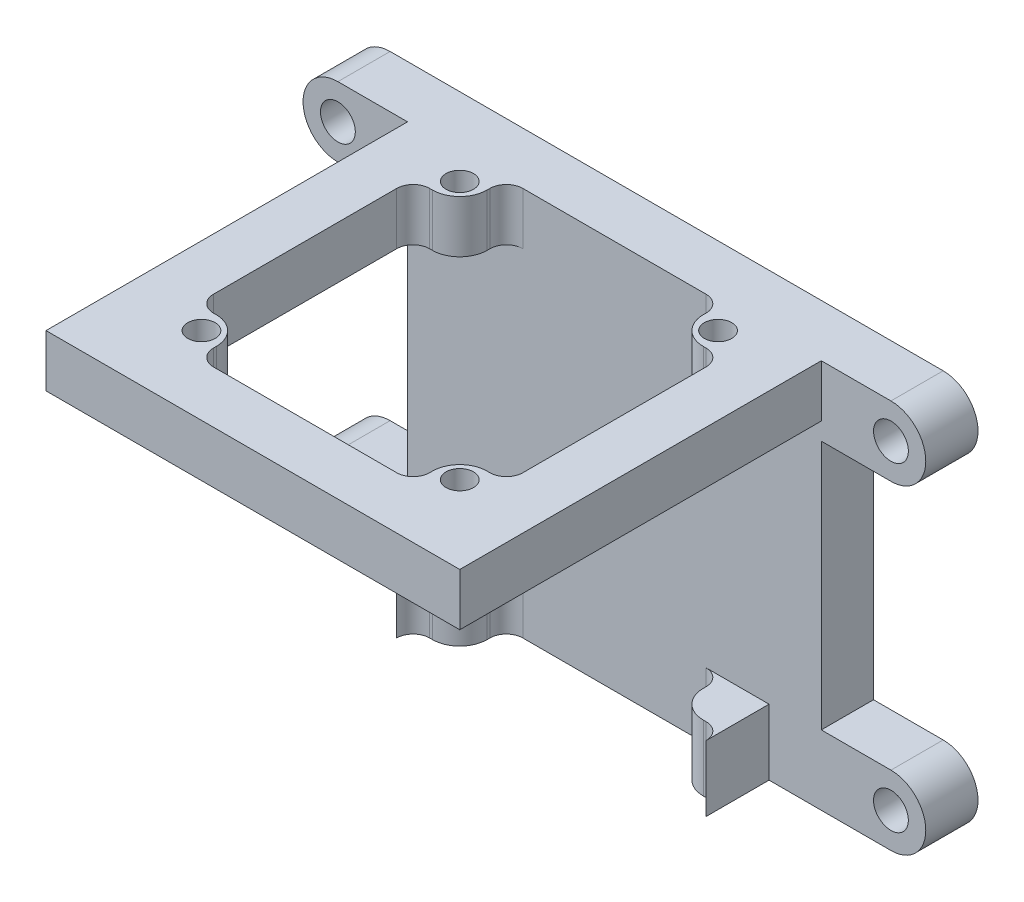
ISO-10303-21;
HEADER;
FILE_DESCRIPTION(('STEP AP214'),'2;1');
FILE_NAME('part.step','',(''),(''),'','','');
FILE_SCHEMA(('AUTOMOTIVE_DESIGN { 1 0 10303 214 1 1 1 1 }'));
ENDSEC;
DATA;
#1=APPLICATION_CONTEXT('core data for automotive mechanical design processes');
#2=APPLICATION_PROTOCOL_DEFINITION('international standard','automotive_design',2000,#1);
#3=PRODUCT_CONTEXT('',#1,'mechanical');
#4=PRODUCT('Part','Part','',(#3));
#5=PRODUCT_RELATED_PRODUCT_CATEGORY('part','',(#4));
#6=PRODUCT_DEFINITION_FORMATION('','',#4);
#7=PRODUCT_DEFINITION_CONTEXT('part definition',#1,'design');
#8=PRODUCT_DEFINITION('design','',#6,#7);
#9=PRODUCT_DEFINITION_SHAPE('','',#8);
#10=(LENGTH_UNIT() NAMED_UNIT(*) SI_UNIT(.MILLI.,.METRE.));
#11=(NAMED_UNIT(*) PLANE_ANGLE_UNIT() SI_UNIT($,.RADIAN.));
#12=(NAMED_UNIT(*) SI_UNIT($,.STERADIAN.) SOLID_ANGLE_UNIT());
#13=UNCERTAINTY_MEASURE_WITH_UNIT(LENGTH_MEASURE(1.E-05),#10,'distance_accuracy_value','');
#14=(GEOMETRIC_REPRESENTATION_CONTEXT(3) GLOBAL_UNCERTAINTY_ASSIGNED_CONTEXT((#13)) GLOBAL_UNIT_ASSIGNED_CONTEXT((#10,
#11,#12)) REPRESENTATION_CONTEXT('',''));
#15=CARTESIAN_POINT('',(0.,0.,0.));
#16=DIRECTION('',(0.,0.,1.));
#17=DIRECTION('',(1.,0.,0.));
#18=AXIS2_PLACEMENT_3D('',#15,#16,#17);
#19=CARTESIAN_POINT('',(424.850743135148,892.404361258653,1248.76303447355));
#20=DIRECTION('',(1.,0.,0.));
#21=DIRECTION('',(0.,0.,-1.));
#22=AXIS2_PLACEMENT_3D('',#19,#20,#21);
#23=PLANE('',#22);
#24=DIRECTION('',(0.,0.,-1.));
#25=VECTOR('',#24,1.);
#26=CARTESIAN_POINT('',(424.850743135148,843.629361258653,1281.18328507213));
#27=LINE('',#26,#25);
#28=CARTESIAN_POINT('',(424.850743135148,843.629361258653,1258.28803447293));
#29=VERTEX_POINT('',#28);
#30=CARTESIAN_POINT('',(424.850743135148,843.629361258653,1248.76303447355));
#31=VERTEX_POINT('',#30);
#32=EDGE_CURVE('E64',#29,#31,#27,.T.);
#33=ORIENTED_EDGE('',*,*,#32,.F.);
#34=DIRECTION('',(0.,1.,0.));
#35=VECTOR('',#34,1.);
#36=CARTESIAN_POINT('',(424.850743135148,830.929361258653,1258.28803447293));
#37=LINE('',#36,#35);
#38=CARTESIAN_POINT('',(424.850743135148,889.229361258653,1258.28803447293));
#39=VERTEX_POINT('',#38);
#40=EDGE_CURVE('E623',#29,#39,#37,.T.);
#41=ORIENTED_EDGE('',*,*,#40,.T.);
#42=DIRECTION('',(0.,0.,-1.));
#43=VECTOR('',#42,1.);
#44=CARTESIAN_POINT('',(424.850743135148,889.229361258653,1281.18328507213));
#45=LINE('',#44,#43);
#46=CARTESIAN_POINT('',(424.850743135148,889.229361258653,1248.76303447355));
#47=VERTEX_POINT('',#46);
#48=EDGE_CURVE('E405',#39,#47,#45,.T.);
#49=ORIENTED_EDGE('',*,*,#48,.T.);
#50=DIRECTION('',(0.,1.,0.));
#51=VECTOR('',#50,1.);
#52=CARTESIAN_POINT('',(424.850743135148,892.404361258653,1248.76303447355));
#53=LINE('',#52,#51);
#54=EDGE_CURVE('E49',#31,#47,#53,.T.);
#55=ORIENTED_EDGE('',*,*,#54,.F.);
#56=EDGE_LOOP('',(#33,#41,#49,#55));
#57=FACE_BOUND('',#56,.T.);
#58=ADVANCED_FACE('F50',(#57),#23,.F.);
#59=DIRECTION('',(0.,0.,-1.));
#60=VECTOR('',#59,1.);
#61=CARTESIAN_POINT('',(424.850743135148,901.929361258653,1248.76303447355));
#62=LINE('',#61,#60);
#63=CARTESIAN_POINT('',(424.850743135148,901.929361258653,1324.21298447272));
#64=VERTEX_POINT('',#63);
#65=CARTESIAN_POINT('',(424.850743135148,901.929361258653,1258.28803447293));
#66=VERTEX_POINT('',#65);
#67=EDGE_CURVE('E827',#64,#66,#62,.T.);
#68=ORIENTED_EDGE('',*,*,#67,.T.);
#69=DIRECTION('',(0.,-1.,0.));
#70=VECTOR('',#69,1.);
#71=CARTESIAN_POINT('',(424.850743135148,889.229361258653,1258.28803447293));
#72=LINE('',#71,#70);
#73=CARTESIAN_POINT('',(424.850743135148,892.404361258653,1258.28803447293));
#74=VERTEX_POINT('',#73);
#75=EDGE_CURVE('E400',#66,#74,#72,.T.);
#76=ORIENTED_EDGE('',*,*,#75,.T.);
#77=DIRECTION('',(0.,0.,-1.));
#78=VECTOR('',#77,1.);
#79=CARTESIAN_POINT('',(424.850743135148,892.404361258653,1248.76303447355));
#80=LINE('',#79,#78);
#81=CARTESIAN_POINT('',(424.850743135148,892.404361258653,1324.21298447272));
#82=VERTEX_POINT('',#81);
#83=EDGE_CURVE('E830',#82,#74,#80,.T.);
#84=ORIENTED_EDGE('',*,*,#83,.F.);
#85=DIRECTION('',(0.,1.,0.));
#86=VECTOR('',#85,1.);
#87=CARTESIAN_POINT('',(424.850743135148,892.404361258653,1324.21298447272));
#88=LINE('',#87,#86);
#89=EDGE_CURVE('E831',#82,#64,#88,.T.);
#90=ORIENTED_EDGE('',*,*,#89,.T.);
#91=EDGE_LOOP('',(#68,#76,#84,#90));
#92=FACE_BOUND('',#91,.T.);
#93=ADVANCED_FACE('F901',(#92),#23,.F.);
#94=CARTESIAN_POINT('',(500.300693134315,892.404361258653,1324.21298447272));
#95=DIRECTION('',(-1.,0.,0.));
#96=DIRECTION('',(0.,0.,1.));
#97=AXIS2_PLACEMENT_3D('',#94,#95,#96);
#98=PLANE('',#97);
#99=DIRECTION('',(0.,1.,0.));
#100=VECTOR('',#99,1.);
#101=CARTESIAN_POINT('',(500.300693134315,830.929361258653,1258.28803447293));
#102=LINE('',#101,#100);
#103=CARTESIAN_POINT('',(500.300693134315,843.629361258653,1258.28803447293));
#104=VERTEX_POINT('',#103);
#105=CARTESIAN_POINT('',(500.300693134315,889.229361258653,1258.28803447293));
#106=VERTEX_POINT('',#105);
#107=EDGE_CURVE('E626',#104,#106,#102,.T.);
#108=ORIENTED_EDGE('',*,*,#107,.F.);
#109=DIRECTION('',(0.,0.,-1.));
#110=VECTOR('',#109,1.);
#111=CARTESIAN_POINT('',(500.300693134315,843.629361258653,1281.18328507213));
#112=LINE('',#111,#110);
#113=CARTESIAN_POINT('',(500.300693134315,843.629361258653,1248.76303447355));
#114=VERTEX_POINT('',#113);
#115=EDGE_CURVE('E462',#104,#114,#112,.T.);
#116=ORIENTED_EDGE('',*,*,#115,.T.);
#117=DIRECTION('',(0.,1.,0.));
#118=VECTOR('',#117,1.);
#119=CARTESIAN_POINT('',(500.300693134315,892.404361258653,1248.76303447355));
#120=LINE('',#119,#118);
#121=CARTESIAN_POINT('',(500.300693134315,889.229361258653,1248.76303447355));
#122=VERTEX_POINT('',#121);
#123=EDGE_CURVE('E843',#114,#122,#120,.T.);
#124=ORIENTED_EDGE('',*,*,#123,.T.);
#125=DIRECTION('',(0.,0.,-1.));
#126=VECTOR('',#125,1.);
#127=CARTESIAN_POINT('',(500.300693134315,889.229361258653,1281.18328507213));
#128=LINE('',#127,#126);
#129=EDGE_CURVE('E502',#106,#122,#128,.T.);
#130=ORIENTED_EDGE('',*,*,#129,.F.);
#131=EDGE_LOOP('',(#108,#116,#124,#130));
#132=FACE_BOUND('',#131,.T.);
#133=ADVANCED_FACE('F909',(#132),#98,.F.);
#134=CARTESIAN_POINT('',(0.,892.404361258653,0.));
#135=DIRECTION('',(0.,1.,0.));
#136=DIRECTION('',(0.,0.,1.));
#137=AXIS2_PLACEMENT_3D('',#134,#135,#136);
#138=PLANE('',#137);
#139=CARTESIAN_POINT('',(486.125693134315,892.404361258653,1310.03803447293));
#140=DIRECTION('',(0.,-1.,0.));
#141=DIRECTION('',(0.,0.,-1.));
#142=AXIS2_PLACEMENT_3D('',#139,#140,#141);
#143=CIRCLE('',#142,2.49999999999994);
#144=CARTESIAN_POINT('',(486.125693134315,892.404361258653,1312.53803447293));
#145=VERTEX_POINT('',#144);
#146=EDGE_CURVE('E632',#145,#145,#143,.T.);
#147=ORIENTED_EDGE('',*,*,#146,.F.);
#148=EDGE_LOOP('',(#147));
#149=FACE_BOUND('',#148,.T.);
#150=CARTESIAN_POINT('',(486.125693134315,892.404361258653,1262.93803447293));
#151=DIRECTION('',(0.,-1.,0.));
#152=DIRECTION('',(0.,0.,-1.));
#153=AXIS2_PLACEMENT_3D('',#150,#151,#152);
#154=CIRCLE('',#153,2.49999999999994);
#155=CARTESIAN_POINT('',(486.125693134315,892.404361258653,1265.43803447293));
#156=VERTEX_POINT('',#155);
#157=EDGE_CURVE('E639',#156,#156,#154,.T.);
#158=ORIENTED_EDGE('',*,*,#157,.F.);
#159=EDGE_LOOP('',(#158));
#160=FACE_BOUND('',#159,.T.);
#161=CARTESIAN_POINT('',(439.025693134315,892.404361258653,1310.03803447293));
#162=DIRECTION('',(0.,-1.,0.));
#163=DIRECTION('',(0.,0.,-1.));
#164=AXIS2_PLACEMENT_3D('',#161,#162,#163);
#165=CIRCLE('',#164,2.49999999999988);
#166=CARTESIAN_POINT('',(439.025693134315,892.404361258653,1312.53803447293));
#167=VERTEX_POINT('',#166);
#168=EDGE_CURVE('E646',#167,#167,#165,.T.);
#169=ORIENTED_EDGE('',*,*,#168,.F.);
#170=EDGE_LOOP('',(#169));
#171=FACE_BOUND('',#170,.T.);
#172=CARTESIAN_POINT('',(439.025693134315,892.404361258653,1262.93803447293));
#173=DIRECTION('',(0.,-1.,0.));
#174=DIRECTION('',(0.,0.,-1.));
#175=AXIS2_PLACEMENT_3D('',#172,#173,#174);
#176=CIRCLE('',#175,2.49999999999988);
#177=CARTESIAN_POINT('',(439.025693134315,892.404361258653,1265.43803447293));
#178=VERTEX_POINT('',#177);
#179=EDGE_CURVE('E655',#178,#178,#176,.T.);
#180=ORIENTED_EDGE('',*,*,#179,.F.);
#181=EDGE_LOOP('',(#180));
#182=FACE_BOUND('',#181,.T.);
#183=DIRECTION('',(-1.,0.,0.));
#184=VECTOR('',#183,1.);
#185=CARTESIAN_POINT('',(424.850743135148,892.404361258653,1258.28803447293));
#186=LINE('',#185,#184);
#187=CARTESIAN_POINT('',(500.300693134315,892.404361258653,1258.28803447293));
#188=VERTEX_POINT('',#187);
#189=CARTESIAN_POINT('',(479.275693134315,892.404361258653,1258.28803447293));
#190=VERTEX_POINT('',#189);
#191=EDGE_CURVE('E622',#188,#190,#186,.T.);
#192=ORIENTED_EDGE('',*,*,#191,.F.);
#193=DIRECTION('',(0.,0.,1.));
#194=VECTOR('',#193,1.);
#195=CARTESIAN_POINT('',(500.300693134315,892.404361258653,1324.21298447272));
#196=LINE('',#195,#194);
#197=CARTESIAN_POINT('',(500.300693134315,892.404361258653,1324.21298447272));
#198=VERTEX_POINT('',#197);
#199=EDGE_CURVE('E828',#188,#198,#196,.T.);
#200=ORIENTED_EDGE('',*,*,#199,.T.);
#201=DIRECTION('',(-1.,0.,0.));
#202=VECTOR('',#201,1.);
#203=CARTESIAN_POINT('',(424.850743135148,892.404361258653,1324.21298447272));
#204=LINE('',#203,#202);
#205=EDGE_CURVE('E832',#198,#82,#204,.T.);
#206=ORIENTED_EDGE('',*,*,#205,.T.);
#207=ORIENTED_EDGE('',*,*,#83,.T.);
#208=CARTESIAN_POINT('',(445.875693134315,892.404361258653,1258.28803447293));
#209=VERTEX_POINT('',#208);
#210=EDGE_CURVE('E554',#209,#74,#186,.T.);
#211=ORIENTED_EDGE('',*,*,#210,.F.);
#212=CARTESIAN_POINT('',(445.875693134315,892.404361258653,1261.28803447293));
#213=DIRECTION('',(0.,-1.,0.));
#214=DIRECTION('',(0.,0.,-1.));
#215=AXIS2_PLACEMENT_3D('',#212,#213,#214);
#216=CIRCLE('',#215,2.99999999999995);
#217=CARTESIAN_POINT('',(442.875693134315,892.404361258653,1261.28803447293));
#218=VERTEX_POINT('',#217);
#219=EDGE_CURVE('E703',#218,#209,#216,.T.);
#220=ORIENTED_EDGE('',*,*,#219,.F.);
#221=DIRECTION('',(0.,0.,-1.));
#222=VECTOR('',#221,1.);
#223=CARTESIAN_POINT('',(442.875693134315,892.404361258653,1261.78803447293));
#224=LINE('',#223,#222);
#225=CARTESIAN_POINT('',(442.875693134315,892.404361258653,1261.78803447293));
#226=VERTEX_POINT('',#225);
#227=EDGE_CURVE('E701',#226,#218,#224,.T.);
#228=ORIENTED_EDGE('',*,*,#227,.F.);
#229=CARTESIAN_POINT('',(437.875693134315,892.404361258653,1261.78803447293));
#230=DIRECTION('',(0.,1.,0.));
#231=DIRECTION('',(0.,0.,-1.));
#232=AXIS2_PLACEMENT_3D('',#229,#230,#231);
#233=CIRCLE('',#232,4.99999999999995);
#234=CARTESIAN_POINT('',(437.875693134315,892.404361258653,1266.78803447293));
#235=VERTEX_POINT('',#234);
#236=EDGE_CURVE('E699',#235,#226,#233,.T.);
#237=ORIENTED_EDGE('',*,*,#236,.F.);
#238=DIRECTION('',(1.,0.,0.));
#239=VECTOR('',#238,1.);
#240=CARTESIAN_POINT('',(437.375693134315,892.404361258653,1266.78803447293));
#241=LINE('',#240,#239);
#242=CARTESIAN_POINT('',(437.375693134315,892.404361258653,1266.78803447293));
#243=VERTEX_POINT('',#242);
#244=EDGE_CURVE('E700',#243,#235,#241,.T.);
#245=ORIENTED_EDGE('',*,*,#244,.F.);
#246=CARTESIAN_POINT('',(437.375693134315,892.404361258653,1269.78803447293));
#247=DIRECTION('',(0.,-1.,0.));
#248=DIRECTION('',(0.,0.,-1.));
#249=AXIS2_PLACEMENT_3D('',#246,#247,#248);
#250=CIRCLE('',#249,3.00000000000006);
#251=CARTESIAN_POINT('',(434.375693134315,892.404361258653,1269.78803447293));
#252=VERTEX_POINT('',#251);
#253=EDGE_CURVE('E694',#252,#243,#250,.T.);
#254=ORIENTED_EDGE('',*,*,#253,.F.);
#255=DIRECTION('',(-2.99402893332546E-06,0.,-0.999999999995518));
#256=VECTOR('',#255,1.);
#257=CARTESIAN_POINT('',(434.375793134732,892.404361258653,1303.1879844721));
#258=LINE('',#257,#256);
#259=CARTESIAN_POINT('',(434.375793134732,892.404361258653,1303.1879844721));
#260=VERTEX_POINT('',#259);
#261=EDGE_CURVE('E691',#260,#252,#258,.T.);
#262=ORIENTED_EDGE('',*,*,#261,.F.);
#263=CARTESIAN_POINT('',(437.375793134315,892.404361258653,1303.18793447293));
#264=DIRECTION('',(0.,-1.,0.));
#265=DIRECTION('',(0.,0.,-1.));
#266=AXIS2_PLACEMENT_3D('',#263,#264,#265);
#267=CIRCLE('',#266,2.99999999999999);
#268=CARTESIAN_POINT('',(437.375743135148,892.404361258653,1306.18793447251));
#269=VERTEX_POINT('',#268);
#270=EDGE_CURVE('E693',#269,#260,#267,.T.);
#271=ORIENTED_EDGE('',*,*,#270,.F.);
#272=DIRECTION('',(-1.,0.,-1.33315581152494E-09));
#273=VECTOR('',#272,1.);
#274=CARTESIAN_POINT('',(437.375743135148,892.404361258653,1306.18793447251));
#275=LINE('',#274,#273);
#276=CARTESIAN_POINT('',(437.875743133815,892.404361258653,1306.18793447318));
#277=VERTEX_POINT('',#276);
#278=EDGE_CURVE('E687',#277,#269,#275,.T.);
#279=ORIENTED_EDGE('',*,*,#278,.F.);
#280=CARTESIAN_POINT('',(437.875793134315,892.404361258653,1311.18793447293));
#281=DIRECTION('',(0.,1.,0.));
#282=DIRECTION('',(0.,0.,-1.));
#283=AXIS2_PLACEMENT_3D('',#280,#281,#282);
#284=CIRCLE('',#283,5.00000000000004);
#285=CARTESIAN_POINT('',(442.875793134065,892.404361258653,1311.18798447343));
#286=VERTEX_POINT('',#285);
#287=EDGE_CURVE('E690',#286,#277,#284,.T.);
#288=ORIENTED_EDGE('',*,*,#287,.F.);
#289=DIRECTION('',(-1.33337785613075E-09,0.,-1.));
#290=VECTOR('',#289,1.);
#291=CARTESIAN_POINT('',(442.875793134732,892.404361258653,1311.6879844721));
#292=LINE('',#291,#290);
#293=CARTESIAN_POINT('',(442.875793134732,892.404361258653,1311.6879844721));
#294=VERTEX_POINT('',#293);
#295=EDGE_CURVE('E681',#294,#286,#292,.T.);
#296=ORIENTED_EDGE('',*,*,#295,.F.);
#297=CARTESIAN_POINT('',(445.875793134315,892.404361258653,1311.68793447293));
#298=DIRECTION('',(0.,-1.,0.));
#299=DIRECTION('',(0.,0.,-1.));
#300=AXIS2_PLACEMENT_3D('',#297,#298,#299);
#301=CIRCLE('',#300,2.99999999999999);
#302=CARTESIAN_POINT('',(445.875743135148,892.404361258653,1314.68793447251));
#303=VERTEX_POINT('',#302);
#304=EDGE_CURVE('E682',#303,#294,#301,.T.);
#305=ORIENTED_EDGE('',*,*,#304,.F.);
#306=DIRECTION('',(-0.999999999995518,0.,-2.99402893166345E-06));
#307=VECTOR('',#306,1.);
#308=CARTESIAN_POINT('',(445.875743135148,892.404361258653,1314.68793447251));
#309=LINE('',#308,#307);
#310=CARTESIAN_POINT('',(479.275693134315,892.404361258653,1314.68803447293));
#311=VERTEX_POINT('',#310);
#312=EDGE_CURVE('E683',#311,#303,#309,.T.);
#313=ORIENTED_EDGE('',*,*,#312,.F.);
#314=CARTESIAN_POINT('',(479.275693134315,892.404361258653,1311.68803447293));
#315=DIRECTION('',(0.,-1.,0.));
#316=DIRECTION('',(0.,0.,-1.));
#317=AXIS2_PLACEMENT_3D('',#314,#315,#316);
#318=CIRCLE('',#317,2.99999999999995);
#319=CARTESIAN_POINT('',(482.275693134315,892.404361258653,1311.68803447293));
#320=VERTEX_POINT('',#319);
#321=EDGE_CURVE('E679',#320,#311,#318,.T.);
#322=ORIENTED_EDGE('',*,*,#321,.F.);
#323=DIRECTION('',(0.,0.,1.));
#324=VECTOR('',#323,1.);
#325=CARTESIAN_POINT('',(482.275693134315,892.404361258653,1311.68803447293));
#326=LINE('',#325,#324);
#327=CARTESIAN_POINT('',(482.275693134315,892.404361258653,1311.18803447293));
#328=VERTEX_POINT('',#327);
#329=EDGE_CURVE('E680',#328,#320,#326,.T.);
#330=ORIENTED_EDGE('',*,*,#329,.F.);
#331=CARTESIAN_POINT('',(487.275693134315,892.404361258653,1311.18803447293));
#332=DIRECTION('',(0.,1.,0.));
#333=DIRECTION('',(0.,0.,-1.));
#334=AXIS2_PLACEMENT_3D('',#331,#332,#333);
#335=CIRCLE('',#334,4.99999999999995);
#336=CARTESIAN_POINT('',(487.275693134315,892.404361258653,1306.18803447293));
#337=VERTEX_POINT('',#336);
#338=EDGE_CURVE('E674',#337,#328,#335,.T.);
#339=ORIENTED_EDGE('',*,*,#338,.F.);
#340=DIRECTION('',(-1.,0.,0.));
#341=VECTOR('',#340,1.);
#342=CARTESIAN_POINT('',(487.275693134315,892.404361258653,1306.18803447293));
#343=LINE('',#342,#341);
#344=CARTESIAN_POINT('',(487.775693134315,892.404361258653,1306.18803447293));
#345=VERTEX_POINT('',#344);
#346=EDGE_CURVE('E671',#345,#337,#343,.T.);
#347=ORIENTED_EDGE('',*,*,#346,.F.);
#348=CARTESIAN_POINT('',(487.775693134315,892.404361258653,1303.18803447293));
#349=DIRECTION('',(0.,-1.,0.));
#350=DIRECTION('',(0.,0.,-1.));
#351=AXIS2_PLACEMENT_3D('',#348,#349,#350);
#352=CIRCLE('',#351,3.00000000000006);
#353=CARTESIAN_POINT('',(490.775693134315,892.404361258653,1303.18803447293));
#354=VERTEX_POINT('',#353);
#355=EDGE_CURVE('E673',#354,#345,#352,.T.);
#356=ORIENTED_EDGE('',*,*,#355,.F.);
#357=DIRECTION('',(0.,0.,1.));
#358=VECTOR('',#357,1.);
#359=CARTESIAN_POINT('',(490.775693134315,892.404361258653,1269.78803447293));
#360=LINE('',#359,#358);
#361=CARTESIAN_POINT('',(490.775693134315,892.404361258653,1269.78803447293));
#362=VERTEX_POINT('',#361);
#363=EDGE_CURVE('E670',#362,#354,#360,.T.);
#364=ORIENTED_EDGE('',*,*,#363,.F.);
#365=CARTESIAN_POINT('',(487.775693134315,892.404361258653,1269.78803447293));
#366=DIRECTION('',(0.,-1.,0.));
#367=DIRECTION('',(0.,0.,-1.));
#368=AXIS2_PLACEMENT_3D('',#365,#366,#367);
#369=CIRCLE('',#368,3.00000000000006);
#370=CARTESIAN_POINT('',(487.775693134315,892.404361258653,1266.78803447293));
#371=VERTEX_POINT('',#370);
#372=EDGE_CURVE('E669',#371,#362,#369,.T.);
#373=ORIENTED_EDGE('',*,*,#372,.F.);
#374=DIRECTION('',(1.,0.,0.));
#375=VECTOR('',#374,1.);
#376=CARTESIAN_POINT('',(487.275693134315,892.404361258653,1266.78803447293));
#377=LINE('',#376,#375);
#378=CARTESIAN_POINT('',(487.275693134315,892.404361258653,1266.78803447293));
#379=VERTEX_POINT('',#378);
#380=EDGE_CURVE('E663',#379,#371,#377,.T.);
#381=ORIENTED_EDGE('',*,*,#380,.F.);
#382=CARTESIAN_POINT('',(487.275693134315,892.404361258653,1261.78803447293));
#383=DIRECTION('',(0.,1.,0.));
#384=DIRECTION('',(0.,0.,-1.));
#385=AXIS2_PLACEMENT_3D('',#382,#383,#384);
#386=CIRCLE('',#385,4.99999999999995);
#387=CARTESIAN_POINT('',(482.275693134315,892.404361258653,1261.78803447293));
#388=VERTEX_POINT('',#387);
#389=EDGE_CURVE('E664',#388,#379,#386,.T.);
#390=ORIENTED_EDGE('',*,*,#389,.F.);
#391=DIRECTION('',(0.,0.,1.));
#392=VECTOR('',#391,1.);
#393=CARTESIAN_POINT('',(482.275693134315,892.404361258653,1261.78803447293));
#394=LINE('',#393,#392);
#395=CARTESIAN_POINT('',(482.275693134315,892.404361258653,1261.28803447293));
#396=VERTEX_POINT('',#395);
#397=EDGE_CURVE('E659',#396,#388,#394,.T.);
#398=ORIENTED_EDGE('',*,*,#397,.F.);
#399=CARTESIAN_POINT('',(479.275693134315,892.404361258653,1261.28803447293));
#400=DIRECTION('',(0.,-1.,0.));
#401=DIRECTION('',(0.,0.,-1.));
#402=AXIS2_PLACEMENT_3D('',#399,#400,#401);
#403=CIRCLE('',#402,2.99999999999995);
#404=EDGE_CURVE('E657',#190,#396,#403,.T.);
#405=ORIENTED_EDGE('',*,*,#404,.F.);
#406=EDGE_LOOP('',(#192,#200,#206,#207,#211,#220,#228,#237,#245,#254,#262,#271,#279,#288,#296,
#305,#313,#322,#330,#339,#347,#356,#364,#373,#381,#390,#398,#405));
#407=FACE_BOUND('',#406,.T.);
#408=ADVANCED_FACE('F914',(#149,#160,#171,#182,#407),#138,.F.);
#409=CARTESIAN_POINT('',(0.,901.929361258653,0.));
#410=DIRECTION('',(0.,1.,0.));
#411=DIRECTION('',(0.,0.,1.));
#412=AXIS2_PLACEMENT_3D('',#409,#410,#411);
#413=PLANE('',#412);
#414=CARTESIAN_POINT('',(486.125693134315,901.929361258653,1262.93803447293));
#415=DIRECTION('',(0.,-1.,0.));
#416=DIRECTION('',(0.,0.,-1.));
#417=AXIS2_PLACEMENT_3D('',#414,#415,#416);
#418=CIRCLE('',#417,2.49999999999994);
#419=CARTESIAN_POINT('',(486.125693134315,901.929361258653,1265.43803447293));
#420=VERTEX_POINT('',#419);
#421=EDGE_CURVE('E637',#420,#420,#418,.T.);
#422=ORIENTED_EDGE('',*,*,#421,.T.);
#423=EDGE_LOOP('',(#422));
#424=FACE_BOUND('',#423,.T.);
#425=CARTESIAN_POINT('',(439.025693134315,901.929361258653,1262.93803447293));
#426=DIRECTION('',(0.,-1.,0.));
#427=DIRECTION('',(0.,0.,-1.));
#428=AXIS2_PLACEMENT_3D('',#425,#426,#427);
#429=CIRCLE('',#428,2.49999999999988);
#430=CARTESIAN_POINT('',(439.025693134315,901.929361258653,1265.43803447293));
#431=VERTEX_POINT('',#430);
#432=EDGE_CURVE('E647',#431,#431,#429,.T.);
#433=ORIENTED_EDGE('',*,*,#432,.T.);
#434=EDGE_LOOP('',(#433));
#435=FACE_BOUND('',#434,.T.);
#436=ORIENTED_EDGE('',*,*,#67,.F.);
#437=DIRECTION('',(-1.,0.,0.));
#438=VECTOR('',#437,1.);
#439=CARTESIAN_POINT('',(424.850743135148,901.929361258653,1324.21298447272));
#440=LINE('',#439,#438);
#441=CARTESIAN_POINT('',(500.300693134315,901.929361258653,1324.21298447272));
#442=VERTEX_POINT('',#441);
#443=EDGE_CURVE('E833',#442,#64,#440,.T.);
#444=ORIENTED_EDGE('',*,*,#443,.F.);
#445=DIRECTION('',(0.,0.,1.));
#446=VECTOR('',#445,1.);
#447=CARTESIAN_POINT('',(500.300693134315,901.929361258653,1324.21298447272));
#448=LINE('',#447,#446);
#449=CARTESIAN_POINT('',(500.300693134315,901.929361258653,1258.28803447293));
#450=VERTEX_POINT('',#449);
#451=EDGE_CURVE('E836',#450,#442,#448,.T.);
#452=ORIENTED_EDGE('',*,*,#451,.F.);
#453=DIRECTION('',(1.,0.,0.));
#454=VECTOR('',#453,1.);
#455=CARTESIAN_POINT('',(500.300693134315,901.929361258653,1258.28803447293));
#456=LINE('',#455,#454);
#457=CARTESIAN_POINT('',(513.000693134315,901.929361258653,1258.28803447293));
#458=VERTEX_POINT('',#457);
#459=EDGE_CURVE('E499',#450,#458,#456,.T.);
#460=ORIENTED_EDGE('',*,*,#459,.T.);
#461=DIRECTION('',(0.,0.,-1.));
#462=VECTOR('',#461,1.);
#463=CARTESIAN_POINT('',(513.000693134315,901.929361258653,1281.18328507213));
#464=LINE('',#463,#462);
#465=CARTESIAN_POINT('',(513.000693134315,901.929361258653,1248.76303447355));
#466=VERTEX_POINT('',#465);
#467=EDGE_CURVE('E493',#458,#466,#464,.T.);
#468=ORIENTED_EDGE('',*,*,#467,.T.);
#469=DIRECTION('',(1.,0.,0.));
#470=VECTOR('',#469,1.);
#471=CARTESIAN_POINT('',(500.300693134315,901.929361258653,1248.76303447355));
#472=LINE('',#471,#470);
#473=CARTESIAN_POINT('',(412.150743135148,901.929361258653,1248.76303447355));
#474=VERTEX_POINT('',#473);
#475=EDGE_CURVE('E416',#474,#466,#472,.T.);
#476=ORIENTED_EDGE('',*,*,#475,.F.);
#477=DIRECTION('',(0.,0.,-1.));
#478=VECTOR('',#477,1.);
#479=CARTESIAN_POINT('',(412.150743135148,901.929361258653,1281.18328507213));
#480=LINE('',#479,#478);
#481=CARTESIAN_POINT('',(412.150743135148,901.929361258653,1258.28803447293));
#482=VERTEX_POINT('',#481);
#483=EDGE_CURVE('E410',#482,#474,#480,.T.);
#484=ORIENTED_EDGE('',*,*,#483,.F.);
#485=DIRECTION('',(1.,0.,0.));
#486=VECTOR('',#485,1.);
#487=CARTESIAN_POINT('',(424.850743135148,901.929361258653,1258.28803447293));
#488=LINE('',#487,#486);
#489=EDGE_CURVE('E386',#482,#66,#488,.T.);
#490=ORIENTED_EDGE('',*,*,#489,.T.);
#491=EDGE_LOOP('',(#436,#444,#452,#460,#468,#476,#484,#490));
#492=FACE_BOUND('',#491,.T.);
#493=DIRECTION('',(1.,0.,0.));
#494=VECTOR('',#493,1.);
#495=CARTESIAN_POINT('',(445.875693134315,901.929361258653,1258.28803447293));
#496=LINE('',#495,#494);
#497=CARTESIAN_POINT('',(445.875693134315,901.929361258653,1258.28803447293));
#498=VERTEX_POINT('',#497);
#499=CARTESIAN_POINT('',(479.275693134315,901.929361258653,1258.28803447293));
#500=VERTEX_POINT('',#499);
#501=EDGE_CURVE('E662',#498,#500,#496,.T.);
#502=ORIENTED_EDGE('',*,*,#501,.T.);
#503=CARTESIAN_POINT('',(479.275693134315,901.929361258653,1261.28803447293));
#504=DIRECTION('',(0.,-1.,0.));
#505=DIRECTION('',(0.,0.,-1.));
#506=AXIS2_PLACEMENT_3D('',#503,#504,#505);
#507=CIRCLE('',#506,2.99999999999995);
#508=CARTESIAN_POINT('',(482.275693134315,901.929361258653,1261.28803447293));
#509=VERTEX_POINT('',#508);
#510=EDGE_CURVE('E654',#500,#509,#507,.T.);
#511=ORIENTED_EDGE('',*,*,#510,.T.);
#512=DIRECTION('',(0.,0.,1.));
#513=VECTOR('',#512,1.);
#514=CARTESIAN_POINT('',(482.275693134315,901.929361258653,1261.78803447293));
#515=LINE('',#514,#513);
#516=CARTESIAN_POINT('',(482.275693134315,901.929361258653,1261.78803447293));
#517=VERTEX_POINT('',#516);
#518=EDGE_CURVE('E707',#509,#517,#515,.T.);
#519=ORIENTED_EDGE('',*,*,#518,.T.);
#520=CARTESIAN_POINT('',(487.275693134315,901.929361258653,1261.78803447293));
#521=DIRECTION('',(0.,1.,0.));
#522=DIRECTION('',(0.,0.,-1.));
#523=AXIS2_PLACEMENT_3D('',#520,#521,#522);
#524=CIRCLE('',#523,4.99999999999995);
#525=CARTESIAN_POINT('',(487.275693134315,901.929361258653,1266.78803447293));
#526=VERTEX_POINT('',#525);
#527=EDGE_CURVE('E715',#517,#526,#524,.T.);
#528=ORIENTED_EDGE('',*,*,#527,.T.);
#529=DIRECTION('',(1.,0.,0.));
#530=VECTOR('',#529,1.);
#531=CARTESIAN_POINT('',(487.275693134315,901.929361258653,1266.78803447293));
#532=LINE('',#531,#530);
#533=CARTESIAN_POINT('',(487.775693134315,901.929361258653,1266.78803447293));
#534=VERTEX_POINT('',#533);
#535=EDGE_CURVE('E714',#526,#534,#532,.T.);
#536=ORIENTED_EDGE('',*,*,#535,.T.);
#537=CARTESIAN_POINT('',(487.775693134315,901.929361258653,1269.78803447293));
#538=DIRECTION('',(0.,-1.,0.));
#539=DIRECTION('',(0.,0.,-1.));
#540=AXIS2_PLACEMENT_3D('',#537,#538,#539);
#541=CIRCLE('',#540,3.00000000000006);
#542=CARTESIAN_POINT('',(490.775693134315,901.929361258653,1269.78803447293));
#543=VERTEX_POINT('',#542);
#544=EDGE_CURVE('E719',#534,#543,#541,.T.);
#545=ORIENTED_EDGE('',*,*,#544,.T.);
#546=DIRECTION('',(0.,0.,1.));
#547=VECTOR('',#546,1.);
#548=CARTESIAN_POINT('',(490.775693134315,901.929361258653,1269.78803447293));
#549=LINE('',#548,#547);
#550=CARTESIAN_POINT('',(490.775693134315,901.929361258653,1303.18803447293));
#551=VERTEX_POINT('',#550);
#552=EDGE_CURVE('E723',#543,#551,#549,.T.);
#553=ORIENTED_EDGE('',*,*,#552,.T.);
#554=CARTESIAN_POINT('',(487.775693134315,901.929361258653,1303.18803447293));
#555=DIRECTION('',(0.,-1.,0.));
#556=DIRECTION('',(0.,0.,-1.));
#557=AXIS2_PLACEMENT_3D('',#554,#555,#556);
#558=CIRCLE('',#557,3.00000000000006);
#559=CARTESIAN_POINT('',(487.775693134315,901.929361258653,1306.18803447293));
#560=VERTEX_POINT('',#559);
#561=EDGE_CURVE('E725',#551,#560,#558,.T.);
#562=ORIENTED_EDGE('',*,*,#561,.T.);
#563=DIRECTION('',(-1.,0.,0.));
#564=VECTOR('',#563,1.);
#565=CARTESIAN_POINT('',(487.275693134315,901.929361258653,1306.18803447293));
#566=LINE('',#565,#564);
#567=CARTESIAN_POINT('',(487.275693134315,901.929361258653,1306.18803447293));
#568=VERTEX_POINT('',#567);
#569=EDGE_CURVE('E730',#560,#568,#566,.T.);
#570=ORIENTED_EDGE('',*,*,#569,.T.);
#571=CARTESIAN_POINT('',(487.275693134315,901.929361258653,1311.18803447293));
#572=DIRECTION('',(0.,1.,0.));
#573=DIRECTION('',(0.,0.,-1.));
#574=AXIS2_PLACEMENT_3D('',#571,#572,#573);
#575=CIRCLE('',#574,4.99999999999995);
#576=CARTESIAN_POINT('',(482.275693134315,901.929361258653,1311.18803447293));
#577=VERTEX_POINT('',#576);
#578=EDGE_CURVE('E729',#568,#577,#575,.T.);
#579=ORIENTED_EDGE('',*,*,#578,.T.);
#580=DIRECTION('',(0.,0.,1.));
#581=VECTOR('',#580,1.);
#582=CARTESIAN_POINT('',(482.275693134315,901.929361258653,1311.68803447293));
#583=LINE('',#582,#581);
#584=CARTESIAN_POINT('',(482.275693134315,901.929361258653,1311.68803447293));
#585=VERTEX_POINT('',#584);
#586=EDGE_CURVE('E731',#577,#585,#583,.T.);
#587=ORIENTED_EDGE('',*,*,#586,.T.);
#588=CARTESIAN_POINT('',(479.275693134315,901.929361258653,1311.68803447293));
#589=DIRECTION('',(0.,-1.,0.));
#590=DIRECTION('',(0.,0.,-1.));
#591=AXIS2_PLACEMENT_3D('',#588,#589,#590);
#592=CIRCLE('',#591,2.99999999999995);
#593=CARTESIAN_POINT('',(479.275693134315,901.929361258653,1314.68803447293));
#594=VERTEX_POINT('',#593);
#595=EDGE_CURVE('E738',#585,#594,#592,.T.);
#596=ORIENTED_EDGE('',*,*,#595,.T.);
#597=DIRECTION('',(-0.999999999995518,0.,-2.99402893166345E-06));
#598=VECTOR('',#597,1.);
#599=CARTESIAN_POINT('',(445.875743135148,901.929361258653,1314.68793447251));
#600=LINE('',#599,#598);
#601=CARTESIAN_POINT('',(445.875743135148,901.929361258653,1314.68793447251));
#602=VERTEX_POINT('',#601);
#603=EDGE_CURVE('E740',#594,#602,#600,.T.);
#604=ORIENTED_EDGE('',*,*,#603,.T.);
#605=CARTESIAN_POINT('',(445.875793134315,901.929361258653,1311.68793447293));
#606=DIRECTION('',(0.,-1.,0.));
#607=DIRECTION('',(0.,0.,-1.));
#608=AXIS2_PLACEMENT_3D('',#605,#606,#607);
#609=CIRCLE('',#608,2.99999999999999);
#610=CARTESIAN_POINT('',(442.875793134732,901.929361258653,1311.6879844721));
#611=VERTEX_POINT('',#610);
#612=EDGE_CURVE('E745',#602,#611,#609,.T.);
#613=ORIENTED_EDGE('',*,*,#612,.T.);
#614=DIRECTION('',(-1.33337785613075E-09,0.,-1.));
#615=VECTOR('',#614,1.);
#616=CARTESIAN_POINT('',(442.875793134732,901.929361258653,1311.6879844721));
#617=LINE('',#616,#615);
#618=CARTESIAN_POINT('',(442.875793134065,901.929361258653,1311.18798447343));
#619=VERTEX_POINT('',#618);
#620=EDGE_CURVE('E744',#611,#619,#617,.T.);
#621=ORIENTED_EDGE('',*,*,#620,.T.);
#622=CARTESIAN_POINT('',(437.875793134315,901.929361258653,1311.18793447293));
#623=DIRECTION('',(0.,1.,0.));
#624=DIRECTION('',(0.,0.,-1.));
#625=AXIS2_PLACEMENT_3D('',#622,#623,#624);
#626=CIRCLE('',#625,5.00000000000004);
#627=CARTESIAN_POINT('',(437.875743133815,901.929361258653,1306.18793447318));
#628=VERTEX_POINT('',#627);
#629=EDGE_CURVE('E746',#619,#628,#626,.T.);
#630=ORIENTED_EDGE('',*,*,#629,.T.);
#631=DIRECTION('',(-1.,0.,-1.33315581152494E-09));
#632=VECTOR('',#631,1.);
#633=CARTESIAN_POINT('',(437.375743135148,901.929361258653,1306.18793447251));
#634=LINE('',#633,#632);
#635=CARTESIAN_POINT('',(437.375743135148,901.929361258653,1306.18793447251));
#636=VERTEX_POINT('',#635);
#637=EDGE_CURVE('E753',#628,#636,#634,.T.);
#638=ORIENTED_EDGE('',*,*,#637,.T.);
#639=CARTESIAN_POINT('',(437.375793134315,901.929361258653,1303.18793447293));
#640=DIRECTION('',(0.,-1.,0.));
#641=DIRECTION('',(0.,0.,-1.));
#642=AXIS2_PLACEMENT_3D('',#639,#640,#641);
#643=CIRCLE('',#642,2.99999999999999);
#644=CARTESIAN_POINT('',(434.375793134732,901.929361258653,1303.1879844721));
#645=VERTEX_POINT('',#644);
#646=EDGE_CURVE('E754',#636,#645,#643,.T.);
#647=ORIENTED_EDGE('',*,*,#646,.T.);
#648=DIRECTION('',(-2.99402893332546E-06,0.,-0.999999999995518));
#649=VECTOR('',#648,1.);
#650=CARTESIAN_POINT('',(434.375793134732,901.929361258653,1303.1879844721));
#651=LINE('',#650,#649);
#652=CARTESIAN_POINT('',(434.375693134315,901.929361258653,1269.78803447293));
#653=VERTEX_POINT('',#652);
#654=EDGE_CURVE('E760',#645,#653,#651,.T.);
#655=ORIENTED_EDGE('',*,*,#654,.T.);
#656=CARTESIAN_POINT('',(437.375693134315,901.929361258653,1269.78803447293));
#657=DIRECTION('',(0.,-1.,0.));
#658=DIRECTION('',(0.,0.,-1.));
#659=AXIS2_PLACEMENT_3D('',#656,#657,#658);
#660=CIRCLE('',#659,3.00000000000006);
#661=CARTESIAN_POINT('',(437.375693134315,901.929361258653,1266.78803447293));
#662=VERTEX_POINT('',#661);
#663=EDGE_CURVE('E759',#653,#662,#660,.T.);
#664=ORIENTED_EDGE('',*,*,#663,.T.);
#665=DIRECTION('',(1.,0.,0.));
#666=VECTOR('',#665,1.);
#667=CARTESIAN_POINT('',(437.375693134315,901.929361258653,1266.78803447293));
#668=LINE('',#667,#666);
#669=CARTESIAN_POINT('',(437.875693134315,901.929361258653,1266.78803447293));
#670=VERTEX_POINT('',#669);
#671=EDGE_CURVE('E763',#662,#670,#668,.T.);
#672=ORIENTED_EDGE('',*,*,#671,.T.);
#673=CARTESIAN_POINT('',(437.875693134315,901.929361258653,1261.78803447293));
#674=DIRECTION('',(0.,1.,0.));
#675=DIRECTION('',(0.,0.,-1.));
#676=AXIS2_PLACEMENT_3D('',#673,#674,#675);
#677=CIRCLE('',#676,4.99999999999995);
#678=CARTESIAN_POINT('',(442.875693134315,901.929361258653,1261.78803447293));
#679=VERTEX_POINT('',#678);
#680=EDGE_CURVE('E766',#670,#679,#677,.T.);
#681=ORIENTED_EDGE('',*,*,#680,.T.);
#682=DIRECTION('',(0.,0.,-1.));
#683=VECTOR('',#682,1.);
#684=CARTESIAN_POINT('',(442.875693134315,901.929361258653,1261.78803447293));
#685=LINE('',#684,#683);
#686=CARTESIAN_POINT('',(442.875693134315,901.929361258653,1261.28803447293));
#687=VERTEX_POINT('',#686);
#688=EDGE_CURVE('E768',#679,#687,#685,.T.);
#689=ORIENTED_EDGE('',*,*,#688,.T.);
#690=CARTESIAN_POINT('',(445.875693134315,901.929361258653,1261.28803447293));
#691=DIRECTION('',(0.,-1.,0.));
#692=DIRECTION('',(0.,0.,-1.));
#693=AXIS2_PLACEMENT_3D('',#690,#691,#692);
#694=CIRCLE('',#693,2.99999999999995);
#695=EDGE_CURVE('E775',#687,#498,#694,.T.);
#696=ORIENTED_EDGE('',*,*,#695,.T.);
#697=EDGE_LOOP('',(#502,#511,#519,#528,#536,#545,#553,#562,#570,#579,#587,#596,#604,#613,#621,
#630,#638,#647,#655,#664,#672,#681,#689,#696));
#698=FACE_BOUND('',#697,.T.);
#699=CARTESIAN_POINT('',(439.025693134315,901.929361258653,1310.03803447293));
#700=DIRECTION('',(0.,-1.,0.));
#701=DIRECTION('',(0.,0.,-1.));
#702=AXIS2_PLACEMENT_3D('',#699,#700,#701);
#703=CIRCLE('',#702,2.49999999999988);
#704=CARTESIAN_POINT('',(439.025693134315,901.929361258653,1312.53803447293));
#705=VERTEX_POINT('',#704);
#706=EDGE_CURVE('E641',#705,#705,#703,.T.);
#707=ORIENTED_EDGE('',*,*,#706,.T.);
#708=EDGE_LOOP('',(#707));
#709=FACE_BOUND('',#708,.T.);
#710=CARTESIAN_POINT('',(486.125693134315,901.929361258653,1310.03803447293));
#711=DIRECTION('',(0.,-1.,0.));
#712=DIRECTION('',(0.,0.,-1.));
#713=AXIS2_PLACEMENT_3D('',#710,#711,#712);
#714=CIRCLE('',#713,2.49999999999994);
#715=CARTESIAN_POINT('',(486.125693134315,901.929361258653,1312.53803447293));
#716=VERTEX_POINT('',#715);
#717=EDGE_CURVE('E631',#716,#716,#714,.T.);
#718=ORIENTED_EDGE('',*,*,#717,.T.);
#719=EDGE_LOOP('',(#718));
#720=FACE_BOUND('',#719,.T.);
#721=ADVANCED_FACE('F414',(#424,#435,#492,#698,#709,#720),#413,.T.);
#722=CARTESIAN_POINT('',(500.300693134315,892.404361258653,1248.76303447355));
#723=DIRECTION('',(0.,0.,1.));
#724=DIRECTION('',(1.,0.,0.));
#725=AXIS2_PLACEMENT_3D('',#722,#723,#724);
#726=PLANE('',#725);
#727=ORIENTED_EDGE('',*,*,#475,.T.);
#728=CARTESIAN_POINT('',(513.000693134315,895.579361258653,1248.76303447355));
#729=DIRECTION('',(0.,0.,-1.));
#730=DIRECTION('',(-1.,0.,0.));
#731=AXIS2_PLACEMENT_3D('',#728,#729,#730);
#732=CIRCLE('',#731,6.35000000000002);
#733=CARTESIAN_POINT('',(513.000693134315,889.229361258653,1248.76303447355));
#734=VERTEX_POINT('',#733);
#735=EDGE_CURVE('E488',#466,#734,#732,.T.);
#736=ORIENTED_EDGE('',*,*,#735,.T.);
#737=DIRECTION('',(-1.,0.,0.));
#738=VECTOR('',#737,1.);
#739=CARTESIAN_POINT('',(513.000693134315,889.229361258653,1248.76303447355));
#740=LINE('',#739,#738);
#741=EDGE_CURVE('E482',#734,#122,#740,.T.);
#742=ORIENTED_EDGE('',*,*,#741,.T.);
#743=ORIENTED_EDGE('',*,*,#123,.F.);
#744=DIRECTION('',(1.,0.,0.));
#745=VECTOR('',#744,1.);
#746=CARTESIAN_POINT('',(513.000693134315,843.629361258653,1248.76303447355));
#747=LINE('',#746,#745);
#748=CARTESIAN_POINT('',(513.000693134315,843.629361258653,1248.76303447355));
#749=VERTEX_POINT('',#748);
#750=EDGE_CURVE('E478',#114,#749,#747,.T.);
#751=ORIENTED_EDGE('',*,*,#750,.T.);
#752=CARTESIAN_POINT('',(513.000693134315,837.279361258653,1248.76303447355));
#753=DIRECTION('',(0.,0.,-1.));
#754=DIRECTION('',(1.,0.,0.));
#755=AXIS2_PLACEMENT_3D('',#752,#753,#754);
#756=CIRCLE('',#755,6.35000000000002);
#757=CARTESIAN_POINT('',(513.000693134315,830.929361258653,1248.76303447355));
#758=VERTEX_POINT('',#757);
#759=EDGE_CURVE('E479',#749,#758,#756,.T.);
#760=ORIENTED_EDGE('',*,*,#759,.T.);
#761=DIRECTION('',(1.,0.,0.));
#762=VECTOR('',#761,1.);
#763=CARTESIAN_POINT('',(424.850743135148,830.929361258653,1248.76303447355));
#764=LINE('',#763,#762);
#765=CARTESIAN_POINT('',(412.150743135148,830.929361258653,1248.76303447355));
#766=VERTEX_POINT('',#765);
#767=EDGE_CURVE('E616',#766,#758,#764,.T.);
#768=ORIENTED_EDGE('',*,*,#767,.F.);
#769=CARTESIAN_POINT('',(412.150743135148,837.279361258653,1248.76303447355));
#770=DIRECTION('',(0.,0.,-1.));
#771=DIRECTION('',(-1.,0.,0.));
#772=AXIS2_PLACEMENT_3D('',#769,#770,#771);
#773=CIRCLE('',#772,6.35000000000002);
#774=CARTESIAN_POINT('',(412.150743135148,843.629361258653,1248.76303447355));
#775=VERTEX_POINT('',#774);
#776=EDGE_CURVE('E452',#766,#775,#773,.T.);
#777=ORIENTED_EDGE('',*,*,#776,.T.);
#778=DIRECTION('',(1.,0.,0.));
#779=VECTOR('',#778,1.);
#780=CARTESIAN_POINT('',(412.150743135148,843.629361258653,1248.76303447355));
#781=LINE('',#780,#779);
#782=EDGE_CURVE('E446',#775,#31,#781,.T.);
#783=ORIENTED_EDGE('',*,*,#782,.T.);
#784=ORIENTED_EDGE('',*,*,#54,.T.);
#785=DIRECTION('',(-1.,0.,0.));
#786=VECTOR('',#785,1.);
#787=CARTESIAN_POINT('',(412.150743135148,889.229361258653,1248.76303447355));
#788=LINE('',#787,#786);
#789=CARTESIAN_POINT('',(412.150743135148,889.229361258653,1248.76303447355));
#790=VERTEX_POINT('',#789);
#791=EDGE_CURVE('E69',#47,#790,#788,.T.);
#792=ORIENTED_EDGE('',*,*,#791,.T.);
#793=CARTESIAN_POINT('',(412.150743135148,895.579361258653,1248.76303447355));
#794=DIRECTION('',(0.,0.,-1.));
#795=DIRECTION('',(1.,0.,0.));
#796=AXIS2_PLACEMENT_3D('',#793,#794,#795);
#797=CIRCLE('',#796,6.35000000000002);
#798=EDGE_CURVE('E435',#790,#474,#797,.T.);
#799=ORIENTED_EDGE('',*,*,#798,.T.);
#800=EDGE_LOOP('',(#727,#736,#742,#743,#751,#760,#768,#777,#783,#784,#792,#799));
#801=FACE_BOUND('',#800,.T.);
#802=CARTESIAN_POINT('',(513.000693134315,895.579361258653,1248.76303447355));
#803=DIRECTION('',(0.,0.,-1.));
#804=DIRECTION('',(-1.,0.,0.));
#805=AXIS2_PLACEMENT_3D('',#802,#803,#804);
#806=CIRCLE('',#805,3.17500000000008);
#807=CARTESIAN_POINT('',(509.825693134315,895.579361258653,1248.76303447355));
#808=VERTEX_POINT('',#807);
#809=EDGE_CURVE('E491',#808,#808,#806,.T.);
#810=ORIENTED_EDGE('',*,*,#809,.F.);
#811=EDGE_LOOP('',(#810));
#812=FACE_BOUND('',#811,.T.);
#813=CARTESIAN_POINT('',(513.000693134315,837.279361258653,1248.76303447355));
#814=DIRECTION('',(0.,0.,-1.));
#815=DIRECTION('',(1.,0.,0.));
#816=AXIS2_PLACEMENT_3D('',#813,#814,#815);
#817=CIRCLE('',#816,3.17500000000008);
#818=CARTESIAN_POINT('',(509.825693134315,837.279361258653,1248.76303447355));
#819=VERTEX_POINT('',#818);
#820=EDGE_CURVE('E470',#819,#819,#817,.T.);
#821=ORIENTED_EDGE('',*,*,#820,.F.);
#822=EDGE_LOOP('',(#821));
#823=FACE_BOUND('',#822,.T.);
#824=CARTESIAN_POINT('',(412.150743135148,895.579361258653,1248.76303447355));
#825=DIRECTION('',(0.,0.,-1.));
#826=DIRECTION('',(1.,0.,0.));
#827=AXIS2_PLACEMENT_3D('',#824,#825,#826);
#828=CIRCLE('',#827,3.17500000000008);
#829=CARTESIAN_POINT('',(408.975743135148,895.579361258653,1248.76303447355));
#830=VERTEX_POINT('',#829);
#831=EDGE_CURVE('E401',#830,#830,#828,.T.);
#832=ORIENTED_EDGE('',*,*,#831,.F.);
#833=EDGE_LOOP('',(#832));
#834=FACE_BOUND('',#833,.T.);
#835=CARTESIAN_POINT('',(412.150743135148,837.279361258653,1248.76303447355));
#836=DIRECTION('',(0.,0.,-1.));
#837=DIRECTION('',(-1.,0.,0.));
#838=AXIS2_PLACEMENT_3D('',#835,#836,#837);
#839=CIRCLE('',#838,3.17500000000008);
#840=CARTESIAN_POINT('',(408.975743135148,837.279361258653,1248.76303447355));
#841=VERTEX_POINT('',#840);
#842=EDGE_CURVE('E439',#841,#841,#839,.T.);
#843=ORIENTED_EDGE('',*,*,#842,.F.);
#844=EDGE_LOOP('',(#843));
#845=FACE_BOUND('',#844,.T.);
#846=ADVANCED_FACE('F855',(#801,#812,#823,#834,#845),#726,.F.);
#847=ORIENTED_EDGE('',*,*,#199,.F.);
#848=DIRECTION('',(0.,1.,0.));
#849=VECTOR('',#848,1.);
#850=CARTESIAN_POINT('',(500.300693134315,889.229361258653,1258.28803447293));
#851=LINE('',#850,#849);
#852=EDGE_CURVE('E11',#188,#450,#851,.T.);
#853=ORIENTED_EDGE('',*,*,#852,.T.);
#854=ORIENTED_EDGE('',*,*,#451,.T.);
#855=DIRECTION('',(0.,1.,0.));
#856=VECTOR('',#855,1.);
#857=CARTESIAN_POINT('',(500.300693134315,892.404361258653,1324.21298447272));
#858=LINE('',#857,#856);
#859=EDGE_CURVE('E841',#198,#442,#858,.T.);
#860=ORIENTED_EDGE('',*,*,#859,.F.);
#861=EDGE_LOOP('',(#847,#853,#854,#860));
#862=FACE_BOUND('',#861,.T.);
#863=ADVANCED_FACE('F920',(#862),#98,.F.);
#864=CARTESIAN_POINT('',(424.850743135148,892.404361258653,1324.21298447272));
#865=DIRECTION('',(0.,0.,-1.));
#866=DIRECTION('',(-1.,0.,0.));
#867=AXIS2_PLACEMENT_3D('',#864,#865,#866);
#868=PLANE('',#867);
#869=ORIENTED_EDGE('',*,*,#443,.T.);
#870=ORIENTED_EDGE('',*,*,#89,.F.);
#871=ORIENTED_EDGE('',*,*,#205,.F.);
#872=ORIENTED_EDGE('',*,*,#859,.T.);
#873=EDGE_LOOP('',(#869,#870,#871,#872));
#874=FACE_BOUND('',#873,.T.);
#875=ADVANCED_FACE('F923',(#874),#868,.F.);
#876=CARTESIAN_POINT('',(479.275693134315,892.404361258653,1261.28803447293));
#877=DIRECTION('',(0.,1.,0.));
#878=DIRECTION('',(0.,0.,1.));
#879=AXIS2_PLACEMENT_3D('',#876,#877,#878);
#880=CYLINDRICAL_SURFACE('',#879,2.99999999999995);
#881=ORIENTED_EDGE('',*,*,#510,.F.);
#882=DIRECTION('',(0.,1.,0.));
#883=VECTOR('',#882,1.);
#884=CARTESIAN_POINT('',(479.275693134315,892.404361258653,1258.28803447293));
#885=LINE('',#884,#883);
#886=EDGE_CURVE('E706',#190,#500,#885,.T.);
#887=ORIENTED_EDGE('',*,*,#886,.F.);
#888=ORIENTED_EDGE('',*,*,#404,.T.);
#889=DIRECTION('',(0.,1.,0.));
#890=VECTOR('',#889,1.);
#891=CARTESIAN_POINT('',(482.275693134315,892.404361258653,1261.28803447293));
#892=LINE('',#891,#890);
#893=EDGE_CURVE('E822',#396,#509,#892,.T.);
#894=ORIENTED_EDGE('',*,*,#893,.T.);
#895=EDGE_LOOP('',(#881,#887,#888,#894));
#896=FACE_BOUND('',#895,.T.);
#897=ADVANCED_FACE('F934',(#896),#880,.F.);
#898=CARTESIAN_POINT('',(482.275693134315,892.404361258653,1261.78803447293));
#899=DIRECTION('',(-1.,0.,0.));
#900=DIRECTION('',(0.,0.,1.));
#901=AXIS2_PLACEMENT_3D('',#898,#899,#900);
#902=PLANE('',#901);
#903=ORIENTED_EDGE('',*,*,#518,.F.);
#904=ORIENTED_EDGE('',*,*,#893,.F.);
#905=ORIENTED_EDGE('',*,*,#397,.T.);
#906=DIRECTION('',(0.,1.,0.));
#907=VECTOR('',#906,1.);
#908=CARTESIAN_POINT('',(482.275693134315,892.404361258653,1261.78803447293));
#909=LINE('',#908,#907);
#910=EDGE_CURVE('E821',#388,#517,#909,.T.);
#911=ORIENTED_EDGE('',*,*,#910,.T.);
#912=EDGE_LOOP('',(#903,#904,#905,#911));
#913=FACE_BOUND('',#912,.T.);
#914=ADVANCED_FACE('F940',(#913),#902,.T.);
#915=CARTESIAN_POINT('',(487.275693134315,892.404361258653,1261.78803447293));
#916=DIRECTION('',(0.,1.,0.));
#917=DIRECTION('',(0.,0.,1.));
#918=AXIS2_PLACEMENT_3D('',#915,#916,#917);
#919=CYLINDRICAL_SURFACE('',#918,4.99999999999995);
#920=ORIENTED_EDGE('',*,*,#527,.F.);
#921=ORIENTED_EDGE('',*,*,#910,.F.);
#922=ORIENTED_EDGE('',*,*,#389,.T.);
#923=DIRECTION('',(0.,1.,0.));
#924=VECTOR('',#923,1.);
#925=CARTESIAN_POINT('',(487.275693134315,892.404361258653,1266.78803447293));
#926=LINE('',#925,#924);
#927=EDGE_CURVE('E817',#379,#526,#926,.T.);
#928=ORIENTED_EDGE('',*,*,#927,.T.);
#929=EDGE_LOOP('',(#920,#921,#922,#928));
#930=FACE_BOUND('',#929,.T.);
#931=ADVANCED_FACE('F1043',(#930),#919,.T.);
#932=CARTESIAN_POINT('',(487.275693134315,892.404361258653,1266.78803447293));
#933=DIRECTION('',(0.,0.,1.));
#934=DIRECTION('',(1.,0.,0.));
#935=AXIS2_PLACEMENT_3D('',#932,#933,#934);
#936=PLANE('',#935);
#937=ORIENTED_EDGE('',*,*,#535,.F.);
#938=ORIENTED_EDGE('',*,*,#927,.F.);
#939=ORIENTED_EDGE('',*,*,#380,.T.);
#940=DIRECTION('',(0.,1.,0.));
#941=VECTOR('',#940,1.);
#942=CARTESIAN_POINT('',(487.775693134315,892.404361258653,1266.78803447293));
#943=LINE('',#942,#941);
#944=EDGE_CURVE('E820',#371,#534,#943,.T.);
#945=ORIENTED_EDGE('',*,*,#944,.T.);
#946=EDGE_LOOP('',(#937,#938,#939,#945));
#947=FACE_BOUND('',#946,.T.);
#948=ADVANCED_FACE('F1045',(#947),#936,.T.);
#949=CARTESIAN_POINT('',(487.775693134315,892.404361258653,1269.78803447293));
#950=DIRECTION('',(0.,1.,0.));
#951=DIRECTION('',(0.,0.,1.));
#952=AXIS2_PLACEMENT_3D('',#949,#950,#951);
#953=CYLINDRICAL_SURFACE('',#952,3.00000000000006);
#954=ORIENTED_EDGE('',*,*,#544,.F.);
#955=ORIENTED_EDGE('',*,*,#944,.F.);
#956=ORIENTED_EDGE('',*,*,#372,.T.);
#957=DIRECTION('',(0.,1.,0.));
#958=VECTOR('',#957,1.);
#959=CARTESIAN_POINT('',(490.775693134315,892.404361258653,1269.78803447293));
#960=LINE('',#959,#958);
#961=EDGE_CURVE('E814',#362,#543,#960,.T.);
#962=ORIENTED_EDGE('',*,*,#961,.T.);
#963=EDGE_LOOP('',(#954,#955,#956,#962));
#964=FACE_BOUND('',#963,.T.);
#965=ADVANCED_FACE('F1036',(#964),#953,.F.);
#966=CARTESIAN_POINT('',(490.775693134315,892.404361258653,1269.78803447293));
#967=DIRECTION('',(-1.,0.,0.));
#968=DIRECTION('',(0.,0.,1.));
#969=AXIS2_PLACEMENT_3D('',#966,#967,#968);
#970=PLANE('',#969);
#971=ORIENTED_EDGE('',*,*,#552,.F.);
#972=ORIENTED_EDGE('',*,*,#961,.F.);
#973=ORIENTED_EDGE('',*,*,#363,.T.);
#974=DIRECTION('',(0.,1.,0.));
#975=VECTOR('',#974,1.);
#976=CARTESIAN_POINT('',(490.775693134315,892.404361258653,1303.18803447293));
#977=LINE('',#976,#975);
#978=EDGE_CURVE('E813',#354,#551,#977,.T.);
#979=ORIENTED_EDGE('',*,*,#978,.T.);
#980=EDGE_LOOP('',(#971,#972,#973,#979));
#981=FACE_BOUND('',#980,.T.);
#982=ADVANCED_FACE('F1035',(#981),#970,.T.);
#983=CARTESIAN_POINT('',(487.775693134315,892.404361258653,1303.18803447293));
#984=DIRECTION('',(0.,1.,0.));
#985=DIRECTION('',(0.,0.,1.));
#986=AXIS2_PLACEMENT_3D('',#983,#984,#985);
#987=CYLINDRICAL_SURFACE('',#986,3.00000000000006);
#988=ORIENTED_EDGE('',*,*,#561,.F.);
#989=ORIENTED_EDGE('',*,*,#978,.F.);
#990=ORIENTED_EDGE('',*,*,#355,.T.);
#991=DIRECTION('',(0.,1.,0.));
#992=VECTOR('',#991,1.);
#993=CARTESIAN_POINT('',(487.775693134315,892.404361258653,1306.18803447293));
#994=LINE('',#993,#992);
#995=EDGE_CURVE('E811',#345,#560,#994,.T.);
#996=ORIENTED_EDGE('',*,*,#995,.T.);
#997=EDGE_LOOP('',(#988,#989,#990,#996));
#998=FACE_BOUND('',#997,.T.);
#999=ADVANCED_FACE('F1029',(#998),#987,.F.);
#1000=CARTESIAN_POINT('',(487.275693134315,892.404361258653,1306.18803447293));
#1001=DIRECTION('',(0.,0.,-1.));
#1002=DIRECTION('',(-1.,0.,0.));
#1003=AXIS2_PLACEMENT_3D('',#1000,#1001,#1002);
#1004=PLANE('',#1003);
#1005=ORIENTED_EDGE('',*,*,#569,.F.);
#1006=ORIENTED_EDGE('',*,*,#995,.F.);
#1007=ORIENTED_EDGE('',*,*,#346,.T.);
#1008=DIRECTION('',(0.,1.,0.));
#1009=VECTOR('',#1008,1.);
#1010=CARTESIAN_POINT('',(487.275693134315,892.404361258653,1306.18803447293));
#1011=LINE('',#1010,#1009);
#1012=EDGE_CURVE('E809',#337,#568,#1011,.T.);
#1013=ORIENTED_EDGE('',*,*,#1012,.T.);
#1014=EDGE_LOOP('',(#1005,#1006,#1007,#1013));
#1015=FACE_BOUND('',#1014,.T.);
#1016=ADVANCED_FACE('F1023',(#1015),#1004,.T.);
#1017=CARTESIAN_POINT('',(487.275693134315,892.404361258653,1311.18803447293));
#1018=DIRECTION('',(0.,1.,0.));
#1019=DIRECTION('',(0.,0.,1.));
#1020=AXIS2_PLACEMENT_3D('',#1017,#1018,#1019);
#1021=CYLINDRICAL_SURFACE('',#1020,4.99999999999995);
#1022=ORIENTED_EDGE('',*,*,#578,.F.);
#1023=ORIENTED_EDGE('',*,*,#1012,.F.);
#1024=ORIENTED_EDGE('',*,*,#338,.T.);
#1025=DIRECTION('',(0.,1.,0.));
#1026=VECTOR('',#1025,1.);
#1027=CARTESIAN_POINT('',(482.275693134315,892.404361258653,1311.18803447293));
#1028=LINE('',#1027,#1026);
#1029=EDGE_CURVE('E810',#328,#577,#1028,.T.);
#1030=ORIENTED_EDGE('',*,*,#1029,.T.);
#1031=EDGE_LOOP('',(#1022,#1023,#1024,#1030));
#1032=FACE_BOUND('',#1031,.T.);
#1033=ADVANCED_FACE('F1020',(#1032),#1021,.T.);
#1034=CARTESIAN_POINT('',(482.275693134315,892.404361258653,1311.68803447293));
#1035=DIRECTION('',(-1.,0.,0.));
#1036=DIRECTION('',(0.,0.,1.));
#1037=AXIS2_PLACEMENT_3D('',#1034,#1035,#1036);
#1038=PLANE('',#1037);
#1039=ORIENTED_EDGE('',*,*,#586,.F.);
#1040=ORIENTED_EDGE('',*,*,#1029,.F.);
#1041=ORIENTED_EDGE('',*,*,#329,.T.);
#1042=DIRECTION('',(0.,1.,0.));
#1043=VECTOR('',#1042,1.);
#1044=CARTESIAN_POINT('',(482.275693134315,892.404361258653,1311.68803447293));
#1045=LINE('',#1044,#1043);
#1046=EDGE_CURVE('E804',#320,#585,#1045,.T.);
#1047=ORIENTED_EDGE('',*,*,#1046,.T.);
#1048=EDGE_LOOP('',(#1039,#1040,#1041,#1047));
#1049=FACE_BOUND('',#1048,.T.);
#1050=ADVANCED_FACE('F1015',(#1049),#1038,.T.);
#1051=CARTESIAN_POINT('',(479.275693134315,892.404361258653,1311.68803447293));
#1052=DIRECTION('',(0.,1.,0.));
#1053=DIRECTION('',(0.,0.,1.));
#1054=AXIS2_PLACEMENT_3D('',#1051,#1052,#1053);
#1055=CYLINDRICAL_SURFACE('',#1054,2.99999999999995);
#1056=ORIENTED_EDGE('',*,*,#595,.F.);
#1057=ORIENTED_EDGE('',*,*,#1046,.F.);
#1058=ORIENTED_EDGE('',*,*,#321,.T.);
#1059=DIRECTION('',(0.,1.,0.));
#1060=VECTOR('',#1059,1.);
#1061=CARTESIAN_POINT('',(479.275693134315,892.404361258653,1314.68803447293));
#1062=LINE('',#1061,#1060);
#1063=EDGE_CURVE('E801',#311,#594,#1062,.T.);
#1064=ORIENTED_EDGE('',*,*,#1063,.T.);
#1065=EDGE_LOOP('',(#1056,#1057,#1058,#1064));
#1066=FACE_BOUND('',#1065,.T.);
#1067=ADVANCED_FACE('F1007',(#1066),#1055,.F.);
#1068=CARTESIAN_POINT('',(445.875743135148,892.404361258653,1314.68793447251));
#1069=DIRECTION('',(2.99402893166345E-06,0.,-0.999999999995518));
#1070=DIRECTION('',(-0.999999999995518,0.,-2.99402893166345E-06));
#1071=AXIS2_PLACEMENT_3D('',#1068,#1069,#1070);
#1072=PLANE('',#1071);
#1073=ORIENTED_EDGE('',*,*,#603,.F.);
#1074=ORIENTED_EDGE('',*,*,#1063,.F.);
#1075=ORIENTED_EDGE('',*,*,#312,.T.);
#1076=DIRECTION('',(0.,1.,0.));
#1077=VECTOR('',#1076,1.);
#1078=CARTESIAN_POINT('',(445.875743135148,892.404361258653,1314.68793447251));
#1079=LINE('',#1078,#1077);
#1080=EDGE_CURVE('E803',#303,#602,#1079,.T.);
#1081=ORIENTED_EDGE('',*,*,#1080,.T.);
#1082=EDGE_LOOP('',(#1073,#1074,#1075,#1081));
#1083=FACE_BOUND('',#1082,.T.);
#1084=ADVANCED_FACE('F1005',(#1083),#1072,.T.);
#1085=CARTESIAN_POINT('',(445.875793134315,892.404361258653,1311.68793447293));
#1086=DIRECTION('',(0.,1.,0.));
#1087=DIRECTION('',(0.,0.,1.));
#1088=AXIS2_PLACEMENT_3D('',#1085,#1086,#1087);
#1089=CYLINDRICAL_SURFACE('',#1088,2.99999999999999);
#1090=ORIENTED_EDGE('',*,*,#612,.F.);
#1091=ORIENTED_EDGE('',*,*,#1080,.F.);
#1092=ORIENTED_EDGE('',*,*,#304,.T.);
#1093=DIRECTION('',(0.,1.,0.));
#1094=VECTOR('',#1093,1.);
#1095=CARTESIAN_POINT('',(442.875793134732,892.404361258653,1311.6879844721));
#1096=LINE('',#1095,#1094);
#1097=EDGE_CURVE('E797',#294,#611,#1096,.T.);
#1098=ORIENTED_EDGE('',*,*,#1097,.T.);
#1099=EDGE_LOOP('',(#1090,#1091,#1092,#1098));
#1100=FACE_BOUND('',#1099,.T.);
#1101=ADVANCED_FACE('F1000',(#1100),#1089,.F.);
#1102=CARTESIAN_POINT('',(442.875793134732,892.404361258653,1311.6879844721));
#1103=DIRECTION('',(1.,0.,-1.33337785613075E-09));
#1104=DIRECTION('',(-1.33337785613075E-09,0.,-1.));
#1105=AXIS2_PLACEMENT_3D('',#1102,#1103,#1104);
#1106=PLANE('',#1105);
#1107=ORIENTED_EDGE('',*,*,#620,.F.);
#1108=ORIENTED_EDGE('',*,*,#1097,.F.);
#1109=ORIENTED_EDGE('',*,*,#295,.T.);
#1110=DIRECTION('',(0.,1.,0.));
#1111=VECTOR('',#1110,1.);
#1112=CARTESIAN_POINT('',(442.875793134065,892.404361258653,1311.18798447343));
#1113=LINE('',#1112,#1111);
#1114=EDGE_CURVE('E800',#286,#619,#1113,.T.);
#1115=ORIENTED_EDGE('',*,*,#1114,.T.);
#1116=EDGE_LOOP('',(#1107,#1108,#1109,#1115));
#1117=FACE_BOUND('',#1116,.T.);
#1118=ADVANCED_FACE('F992',(#1117),#1106,.T.);
#1119=CARTESIAN_POINT('',(437.875793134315,892.404361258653,1311.18793447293));
#1120=DIRECTION('',(0.,1.,0.));
#1121=DIRECTION('',(0.,0.,1.));
#1122=AXIS2_PLACEMENT_3D('',#1119,#1120,#1121);
#1123=CYLINDRICAL_SURFACE('',#1122,5.00000000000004);
#1124=ORIENTED_EDGE('',*,*,#629,.F.);
#1125=ORIENTED_EDGE('',*,*,#1114,.F.);
#1126=ORIENTED_EDGE('',*,*,#287,.T.);
#1127=DIRECTION('',(0.,1.,0.));
#1128=VECTOR('',#1127,1.);
#1129=CARTESIAN_POINT('',(437.875743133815,892.404361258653,1306.18793447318));
#1130=LINE('',#1129,#1128);
#1131=EDGE_CURVE('E791',#277,#628,#1130,.T.);
#1132=ORIENTED_EDGE('',*,*,#1131,.T.);
#1133=EDGE_LOOP('',(#1124,#1125,#1126,#1132));
#1134=FACE_BOUND('',#1133,.T.);
#1135=ADVANCED_FACE('F990',(#1134),#1123,.T.);
#1136=CARTESIAN_POINT('',(437.375743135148,892.404361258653,1306.18793447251));
#1137=DIRECTION('',(1.33315581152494E-09,0.,-1.));
#1138=DIRECTION('',(-1.,0.,-1.33315581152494E-09));
#1139=AXIS2_PLACEMENT_3D('',#1136,#1137,#1138);
#1140=PLANE('',#1139);
#1141=ORIENTED_EDGE('',*,*,#637,.F.);
#1142=ORIENTED_EDGE('',*,*,#1131,.F.);
#1143=ORIENTED_EDGE('',*,*,#278,.T.);
#1144=DIRECTION('',(0.,1.,0.));
#1145=VECTOR('',#1144,1.);
#1146=CARTESIAN_POINT('',(437.375743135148,892.404361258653,1306.18793447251));
#1147=LINE('',#1146,#1145);
#1148=EDGE_CURVE('E792',#269,#636,#1147,.T.);
#1149=ORIENTED_EDGE('',*,*,#1148,.T.);
#1150=EDGE_LOOP('',(#1141,#1142,#1143,#1149));
#1151=FACE_BOUND('',#1150,.T.);
#1152=ADVANCED_FACE('F982',(#1151),#1140,.T.);
#1153=CARTESIAN_POINT('',(437.375793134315,892.404361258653,1303.18793447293));
#1154=DIRECTION('',(0.,1.,0.));
#1155=DIRECTION('',(0.,0.,1.));
#1156=AXIS2_PLACEMENT_3D('',#1153,#1154,#1155);
#1157=CYLINDRICAL_SURFACE('',#1156,2.99999999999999);
#1158=ORIENTED_EDGE('',*,*,#646,.F.);
#1159=ORIENTED_EDGE('',*,*,#1148,.F.);
#1160=ORIENTED_EDGE('',*,*,#270,.T.);
#1161=DIRECTION('',(0.,1.,0.));
#1162=VECTOR('',#1161,1.);
#1163=CARTESIAN_POINT('',(434.375793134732,892.404361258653,1303.1879844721));
#1164=LINE('',#1163,#1162);
#1165=EDGE_CURVE('E793',#260,#645,#1164,.T.);
#1166=ORIENTED_EDGE('',*,*,#1165,.T.);
#1167=EDGE_LOOP('',(#1158,#1159,#1160,#1166));
#1168=FACE_BOUND('',#1167,.T.);
#1169=ADVANCED_FACE('F976',(#1168),#1157,.F.);
#1170=CARTESIAN_POINT('',(434.375793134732,892.404361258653,1303.1879844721));
#1171=DIRECTION('',(0.999999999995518,0.,-2.99402893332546E-06));
#1172=DIRECTION('',(-2.99402893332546E-06,0.,-0.999999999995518));
#1173=AXIS2_PLACEMENT_3D('',#1170,#1171,#1172);
#1174=PLANE('',#1173);
#1175=ORIENTED_EDGE('',*,*,#654,.F.);
#1176=ORIENTED_EDGE('',*,*,#1165,.F.);
#1177=ORIENTED_EDGE('',*,*,#261,.T.);
#1178=DIRECTION('',(0.,1.,0.));
#1179=VECTOR('',#1178,1.);
#1180=CARTESIAN_POINT('',(434.375693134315,892.404361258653,1269.78803447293));
#1181=LINE('',#1180,#1179);
#1182=EDGE_CURVE('E789',#252,#653,#1181,.T.);
#1183=ORIENTED_EDGE('',*,*,#1182,.T.);
#1184=EDGE_LOOP('',(#1175,#1176,#1177,#1183));
#1185=FACE_BOUND('',#1184,.T.);
#1186=ADVANCED_FACE('F975',(#1185),#1174,.T.);
#1187=CARTESIAN_POINT('',(437.375693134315,892.404361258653,1269.78803447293));
#1188=DIRECTION('',(0.,1.,0.));
#1189=DIRECTION('',(0.,0.,1.));
#1190=AXIS2_PLACEMENT_3D('',#1187,#1188,#1189);
#1191=CYLINDRICAL_SURFACE('',#1190,3.00000000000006);
#1192=ORIENTED_EDGE('',*,*,#663,.F.);
#1193=ORIENTED_EDGE('',*,*,#1182,.F.);
#1194=ORIENTED_EDGE('',*,*,#253,.T.);
#1195=DIRECTION('',(0.,1.,0.));
#1196=VECTOR('',#1195,1.);
#1197=CARTESIAN_POINT('',(437.375693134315,892.404361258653,1266.78803447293));
#1198=LINE('',#1197,#1196);
#1199=EDGE_CURVE('E790',#243,#662,#1198,.T.);
#1200=ORIENTED_EDGE('',*,*,#1199,.T.);
#1201=EDGE_LOOP('',(#1192,#1193,#1194,#1200));
#1202=FACE_BOUND('',#1201,.T.);
#1203=ADVANCED_FACE('F970',(#1202),#1191,.F.);
#1204=CARTESIAN_POINT('',(437.375693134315,892.404361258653,1266.78803447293));
#1205=DIRECTION('',(0.,0.,1.));
#1206=DIRECTION('',(1.,0.,0.));
#1207=AXIS2_PLACEMENT_3D('',#1204,#1205,#1206);
#1208=PLANE('',#1207);
#1209=ORIENTED_EDGE('',*,*,#671,.F.);
#1210=ORIENTED_EDGE('',*,*,#1199,.F.);
#1211=ORIENTED_EDGE('',*,*,#244,.T.);
#1212=DIRECTION('',(0.,1.,0.));
#1213=VECTOR('',#1212,1.);
#1214=CARTESIAN_POINT('',(437.875693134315,892.404361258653,1266.78803447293));
#1215=LINE('',#1214,#1213);
#1216=EDGE_CURVE('E784',#235,#670,#1215,.T.);
#1217=ORIENTED_EDGE('',*,*,#1216,.T.);
#1218=EDGE_LOOP('',(#1209,#1210,#1211,#1217));
#1219=FACE_BOUND('',#1218,.T.);
#1220=ADVANCED_FACE('F963',(#1219),#1208,.T.);
#1221=CARTESIAN_POINT('',(437.875693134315,892.404361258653,1261.78803447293));
#1222=DIRECTION('',(0.,1.,0.));
#1223=DIRECTION('',(0.,0.,1.));
#1224=AXIS2_PLACEMENT_3D('',#1221,#1222,#1223);
#1225=CYLINDRICAL_SURFACE('',#1224,4.99999999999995);
#1226=ORIENTED_EDGE('',*,*,#680,.F.);
#1227=ORIENTED_EDGE('',*,*,#1216,.F.);
#1228=ORIENTED_EDGE('',*,*,#236,.T.);
#1229=DIRECTION('',(0.,1.,0.));
#1230=VECTOR('',#1229,1.);
#1231=CARTESIAN_POINT('',(442.875693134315,892.404361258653,1261.78803447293));
#1232=LINE('',#1231,#1230);
#1233=EDGE_CURVE('E781',#226,#679,#1232,.T.);
#1234=ORIENTED_EDGE('',*,*,#1233,.T.);
#1235=EDGE_LOOP('',(#1226,#1227,#1228,#1234));
#1236=FACE_BOUND('',#1235,.T.);
#1237=ADVANCED_FACE('F959',(#1236),#1225,.T.);
#1238=CARTESIAN_POINT('',(442.875693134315,892.404361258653,1261.78803447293));
#1239=DIRECTION('',(1.,0.,0.));
#1240=DIRECTION('',(0.,0.,-1.));
#1241=AXIS2_PLACEMENT_3D('',#1238,#1239,#1240);
#1242=PLANE('',#1241);
#1243=ORIENTED_EDGE('',*,*,#688,.F.);
#1244=ORIENTED_EDGE('',*,*,#1233,.F.);
#1245=ORIENTED_EDGE('',*,*,#227,.T.);
#1246=DIRECTION('',(0.,1.,0.));
#1247=VECTOR('',#1246,1.);
#1248=CARTESIAN_POINT('',(442.875693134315,892.404361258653,1261.28803447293));
#1249=LINE('',#1248,#1247);
#1250=EDGE_CURVE('E783',#218,#687,#1249,.T.);
#1251=ORIENTED_EDGE('',*,*,#1250,.T.);
#1252=EDGE_LOOP('',(#1243,#1244,#1245,#1251));
#1253=FACE_BOUND('',#1252,.T.);
#1254=ADVANCED_FACE('F954',(#1253),#1242,.T.);
#1255=CARTESIAN_POINT('',(445.875693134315,892.404361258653,1261.28803447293));
#1256=DIRECTION('',(0.,1.,0.));
#1257=DIRECTION('',(0.,0.,1.));
#1258=AXIS2_PLACEMENT_3D('',#1255,#1256,#1257);
#1259=CYLINDRICAL_SURFACE('',#1258,2.99999999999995);
#1260=ORIENTED_EDGE('',*,*,#695,.F.);
#1261=ORIENTED_EDGE('',*,*,#1250,.F.);
#1262=ORIENTED_EDGE('',*,*,#219,.T.);
#1263=DIRECTION('',(0.,1.,0.));
#1264=VECTOR('',#1263,1.);
#1265=CARTESIAN_POINT('',(445.875693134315,892.404361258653,1258.28803447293));
#1266=LINE('',#1265,#1264);
#1267=EDGE_CURVE('E780',#209,#498,#1266,.T.);
#1268=ORIENTED_EDGE('',*,*,#1267,.T.);
#1269=EDGE_LOOP('',(#1260,#1261,#1262,#1268));
#1270=FACE_BOUND('',#1269,.T.);
#1271=ADVANCED_FACE('F950',(#1270),#1259,.F.);
#1272=CARTESIAN_POINT('',(445.875693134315,892.404361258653,1258.28803447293));
#1273=DIRECTION('',(0.,0.,1.));
#1274=DIRECTION('',(1.,0.,0.));
#1275=AXIS2_PLACEMENT_3D('',#1272,#1273,#1274);
#1276=PLANE('',#1275);
#1277=DIRECTION('',(0.,-1.,0.));
#1278=VECTOR('',#1277,1.);
#1279=CARTESIAN_POINT('',(479.275693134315,842.929361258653,1258.28803447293));
#1280=LINE('',#1279,#1278);
#1281=CARTESIAN_POINT('',(479.275693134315,842.929361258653,1258.28803447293));
#1282=VERTEX_POINT('',#1281);
#1283=CARTESIAN_POINT('',(479.275693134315,830.929361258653,1258.28803447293));
#1284=VERTEX_POINT('',#1283);
#1285=EDGE_CURVE('E559',#1282,#1284,#1280,.T.);
#1286=ORIENTED_EDGE('',*,*,#1285,.F.);
#1287=DIRECTION('',(1.,0.,0.));
#1288=VECTOR('',#1287,1.);
#1289=CARTESIAN_POINT('',(479.275693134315,842.929361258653,1258.28803447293));
#1290=LINE('',#1289,#1288);
#1291=CARTESIAN_POINT('',(490.775693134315,842.929361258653,1258.28803447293));
#1292=VERTEX_POINT('',#1291);
#1293=EDGE_CURVE('E528',#1282,#1292,#1290,.T.);
#1294=ORIENTED_EDGE('',*,*,#1293,.T.);
#1295=DIRECTION('',(0.,-1.,0.));
#1296=VECTOR('',#1295,1.);
#1297=CARTESIAN_POINT('',(490.775693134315,842.929361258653,1258.28803447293));
#1298=LINE('',#1297,#1296);
#1299=CARTESIAN_POINT('',(490.775693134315,830.929361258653,1258.28803447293));
#1300=VERTEX_POINT('',#1299);
#1301=EDGE_CURVE('E551',#1292,#1300,#1298,.T.);
#1302=ORIENTED_EDGE('',*,*,#1301,.T.);
#1303=DIRECTION('',(-1.,0.,0.));
#1304=VECTOR('',#1303,1.);
#1305=CARTESIAN_POINT('',(424.850743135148,830.929361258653,1258.28803447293));
#1306=LINE('',#1305,#1304);
#1307=CARTESIAN_POINT('',(513.000693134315,830.929361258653,1258.28803447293));
#1308=VERTEX_POINT('',#1307);
#1309=EDGE_CURVE('E625',#1308,#1300,#1306,.T.);
#1310=ORIENTED_EDGE('',*,*,#1309,.F.);
#1311=CARTESIAN_POINT('',(513.000693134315,837.279361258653,1258.28803447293));
#1312=DIRECTION('',(0.,0.,1.));
#1313=DIRECTION('',(1.,0.,0.));
#1314=AXIS2_PLACEMENT_3D('',#1311,#1312,#1313);
#1315=CIRCLE('',#1314,6.35000000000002);
#1316=CARTESIAN_POINT('',(513.000693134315,843.629361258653,1258.28803447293));
#1317=VERTEX_POINT('',#1316);
#1318=EDGE_CURVE('E453',#1317,#1308,#1315,.F.);
#1319=ORIENTED_EDGE('',*,*,#1318,.F.);
#1320=DIRECTION('',(1.,0.,0.));
#1321=VECTOR('',#1320,1.);
#1322=CARTESIAN_POINT('',(513.000693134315,843.629361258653,1258.28803447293));
#1323=LINE('',#1322,#1321);
#1324=EDGE_CURVE('E464',#104,#1317,#1323,.T.);
#1325=ORIENTED_EDGE('',*,*,#1324,.F.);
#1326=ORIENTED_EDGE('',*,*,#107,.T.);
#1327=DIRECTION('',(-1.,0.,0.));
#1328=VECTOR('',#1327,1.);
#1329=CARTESIAN_POINT('',(513.000693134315,889.229361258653,1258.28803447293));
#1330=LINE('',#1329,#1328);
#1331=CARTESIAN_POINT('',(513.000693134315,889.229361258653,1258.28803447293));
#1332=VERTEX_POINT('',#1331);
#1333=EDGE_CURVE('E411',#1332,#106,#1330,.T.);
#1334=ORIENTED_EDGE('',*,*,#1333,.F.);
#1335=CARTESIAN_POINT('',(513.000693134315,895.579361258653,1258.28803447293));
#1336=DIRECTION('',(0.,0.,1.));
#1337=DIRECTION('',(1.,0.,0.));
#1338=AXIS2_PLACEMENT_3D('',#1335,#1336,#1337);
#1339=CIRCLE('',#1338,6.35000000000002);
#1340=EDGE_CURVE('E505',#458,#1332,#1339,.F.);
#1341=ORIENTED_EDGE('',*,*,#1340,.F.);
#1342=ORIENTED_EDGE('',*,*,#459,.F.);
#1343=ORIENTED_EDGE('',*,*,#852,.F.);
#1344=ORIENTED_EDGE('',*,*,#191,.T.);
#1345=ORIENTED_EDGE('',*,*,#886,.T.);
#1346=ORIENTED_EDGE('',*,*,#501,.F.);
#1347=ORIENTED_EDGE('',*,*,#1267,.F.);
#1348=ORIENTED_EDGE('',*,*,#210,.T.);
#1349=ORIENTED_EDGE('',*,*,#75,.F.);
#1350=ORIENTED_EDGE('',*,*,#489,.F.);
#1351=CARTESIAN_POINT('',(412.150743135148,895.579361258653,1258.28803447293));
#1352=DIRECTION('',(0.,0.,1.));
#1353=DIRECTION('',(1.,0.,0.));
#1354=AXIS2_PLACEMENT_3D('',#1351,#1352,#1353);
#1355=CIRCLE('',#1354,6.35000000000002);
#1356=CARTESIAN_POINT('',(412.150743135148,889.229361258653,1258.28803447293));
#1357=VERTEX_POINT('',#1356);
#1358=EDGE_CURVE('E395',#1357,#482,#1355,.F.);
#1359=ORIENTED_EDGE('',*,*,#1358,.F.);
#1360=DIRECTION('',(-1.,0.,0.));
#1361=VECTOR('',#1360,1.);
#1362=CARTESIAN_POINT('',(412.150743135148,889.229361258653,1258.28803447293));
#1363=LINE('',#1362,#1361);
#1364=EDGE_CURVE('E420',#39,#1357,#1363,.T.);
#1365=ORIENTED_EDGE('',*,*,#1364,.F.);
#1366=ORIENTED_EDGE('',*,*,#40,.F.);
#1367=DIRECTION('',(1.,0.,0.));
#1368=VECTOR('',#1367,1.);
#1369=CARTESIAN_POINT('',(412.150743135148,843.629361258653,1258.28803447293));
#1370=LINE('',#1369,#1368);
#1371=CARTESIAN_POINT('',(412.150743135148,843.629361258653,1258.28803447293));
#1372=VERTEX_POINT('',#1371);
#1373=EDGE_CURVE('E438',#1372,#29,#1370,.T.);
#1374=ORIENTED_EDGE('',*,*,#1373,.F.);
#1375=CARTESIAN_POINT('',(412.150743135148,837.279361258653,1258.28803447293));
#1376=DIRECTION('',(0.,0.,1.));
#1377=DIRECTION('',(1.,0.,0.));
#1378=AXIS2_PLACEMENT_3D('',#1375,#1376,#1377);
#1379=CIRCLE('',#1378,6.35000000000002);
#1380=CARTESIAN_POINT('',(412.150743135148,830.929361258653,1258.28803447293));
#1381=VERTEX_POINT('',#1380);
#1382=EDGE_CURVE('E427',#1381,#1372,#1379,.F.);
#1383=ORIENTED_EDGE('',*,*,#1382,.F.);
#1384=CARTESIAN_POINT('',(434.375693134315,830.929361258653,1258.28803447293));
#1385=VERTEX_POINT('',#1384);
#1386=EDGE_CURVE('E619',#1385,#1381,#1306,.T.);
#1387=ORIENTED_EDGE('',*,*,#1386,.F.);
#1388=DIRECTION('',(0.,-1.,0.));
#1389=VECTOR('',#1388,1.);
#1390=CARTESIAN_POINT('',(434.375693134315,842.929361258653,1258.28803447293));
#1391=LINE('',#1390,#1389);
#1392=CARTESIAN_POINT('',(434.375693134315,842.929361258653,1258.28803447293));
#1393=VERTEX_POINT('',#1392);
#1394=EDGE_CURVE('E569',#1393,#1385,#1391,.T.);
#1395=ORIENTED_EDGE('',*,*,#1394,.F.);
#1396=DIRECTION('',(1.,0.,0.));
#1397=VECTOR('',#1396,1.);
#1398=CARTESIAN_POINT('',(434.375693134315,842.929361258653,1258.28803447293));
#1399=LINE('',#1398,#1397);
#1400=CARTESIAN_POINT('',(445.875693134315,842.929361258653,1258.28803447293));
#1401=VERTEX_POINT('',#1400);
#1402=EDGE_CURVE('E608',#1393,#1401,#1399,.T.);
#1403=ORIENTED_EDGE('',*,*,#1402,.T.);
#1404=DIRECTION('',(0.,-1.,0.));
#1405=VECTOR('',#1404,1.);
#1406=CARTESIAN_POINT('',(445.875693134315,842.929361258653,1258.28803447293));
#1407=LINE('',#1406,#1405);
#1408=CARTESIAN_POINT('',(445.875693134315,830.929361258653,1258.28803447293));
#1409=VERTEX_POINT('',#1408);
#1410=EDGE_CURVE('E573',#1401,#1409,#1407,.T.);
#1411=ORIENTED_EDGE('',*,*,#1410,.T.);
#1412=EDGE_CURVE('E628',#1284,#1409,#1306,.T.);
#1413=ORIENTED_EDGE('',*,*,#1412,.F.);
#1414=EDGE_LOOP('',(#1286,#1294,#1302,#1310,#1319,#1325,#1326,#1334,#1341,#1342,#1343,#1344,
#1345,#1346,#1347,#1348,#1349,#1350,#1359,#1365,#1366,#1374,#1383,#1387,#1395,#1403,#1411,#1413));
#1415=FACE_BOUND('',#1414,.T.);
#1416=CARTESIAN_POINT('',(513.000693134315,895.579361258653,1258.28803447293));
#1417=DIRECTION('',(0.,0.,1.));
#1418=DIRECTION('',(1.,0.,0.));
#1419=AXIS2_PLACEMENT_3D('',#1416,#1417,#1418);
#1420=CIRCLE('',#1419,3.17500000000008);
#1421=CARTESIAN_POINT('',(509.825693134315,895.579361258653,1258.28803447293));
#1422=VERTEX_POINT('',#1421);
#1423=EDGE_CURVE('E490',#1422,#1422,#1420,.F.);
#1424=ORIENTED_EDGE('',*,*,#1423,.T.);
#1425=EDGE_LOOP('',(#1424));
#1426=FACE_BOUND('',#1425,.T.);
#1427=CARTESIAN_POINT('',(412.150743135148,895.579361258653,1258.28803447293));
#1428=DIRECTION('',(0.,0.,1.));
#1429=DIRECTION('',(1.,0.,0.));
#1430=AXIS2_PLACEMENT_3D('',#1427,#1428,#1429);
#1431=CIRCLE('',#1430,3.17500000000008);
#1432=CARTESIAN_POINT('',(408.975743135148,895.579361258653,1258.28803447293));
#1433=VERTEX_POINT('',#1432);
#1434=EDGE_CURVE('E426',#1433,#1433,#1431,.F.);
#1435=ORIENTED_EDGE('',*,*,#1434,.T.);
#1436=EDGE_LOOP('',(#1435));
#1437=FACE_BOUND('',#1436,.T.);
#1438=CARTESIAN_POINT('',(513.000693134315,837.279361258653,1258.28803447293));
#1439=DIRECTION('',(0.,0.,1.));
#1440=DIRECTION('',(1.,0.,0.));
#1441=AXIS2_PLACEMENT_3D('',#1438,#1439,#1440);
#1442=CIRCLE('',#1441,3.17500000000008);
#1443=CARTESIAN_POINT('',(509.825693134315,837.279361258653,1258.28803447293));
#1444=VERTEX_POINT('',#1443);
#1445=EDGE_CURVE('E471',#1444,#1444,#1442,.F.);
#1446=ORIENTED_EDGE('',*,*,#1445,.T.);
#1447=EDGE_LOOP('',(#1446));
#1448=FACE_BOUND('',#1447,.T.);
#1449=CARTESIAN_POINT('',(412.150743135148,837.279361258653,1258.28803447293));
#1450=DIRECTION('',(0.,0.,1.));
#1451=DIRECTION('',(1.,0.,0.));
#1452=AXIS2_PLACEMENT_3D('',#1449,#1450,#1451);
#1453=CIRCLE('',#1452,3.17500000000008);
#1454=CARTESIAN_POINT('',(408.975743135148,837.279361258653,1258.28803447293));
#1455=VERTEX_POINT('',#1454);
#1456=EDGE_CURVE('E449',#1455,#1455,#1453,.F.);
#1457=ORIENTED_EDGE('',*,*,#1456,.T.);
#1458=EDGE_LOOP('',(#1457));
#1459=FACE_BOUND('',#1458,.T.);
#1460=ADVANCED_FACE('F394',(#1415,#1426,#1437,#1448,#1459),#1276,.T.);
#1461=CARTESIAN_POINT('',(439.025693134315,892.404361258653,1262.93803447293));
#1462=DIRECTION('',(0.,1.,0.));
#1463=DIRECTION('',(0.,0.,1.));
#1464=AXIS2_PLACEMENT_3D('',#1461,#1462,#1463);
#1465=CYLINDRICAL_SURFACE('',#1464,2.49999999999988);
#1466=CARTESIAN_POINT('',(439.025693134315,892.404361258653,1265.43803447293));
#1467=CARTESIAN_POINT('',(439.025693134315,892.503580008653,1265.43803447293));
#1468=CARTESIAN_POINT('',(439.025693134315,892.602798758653,1265.43803447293));
#1469=CARTESIAN_POINT('',(439.025693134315,892.801236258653,1265.43803447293));
#1470=CARTESIAN_POINT('',(439.025693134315,892.900455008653,1265.43803447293));
#1471=CARTESIAN_POINT('',(439.025693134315,893.098892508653,1265.43803447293));
#1472=CARTESIAN_POINT('',(439.025693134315,893.198111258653,1265.43803447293));
#1473=CARTESIAN_POINT('',(439.025693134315,893.396548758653,1265.43803447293));
#1474=CARTESIAN_POINT('',(439.025693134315,893.495767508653,1265.43803447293));
#1475=CARTESIAN_POINT('',(439.025693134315,893.694205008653,1265.43803447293));
#1476=CARTESIAN_POINT('',(439.025693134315,893.793423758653,1265.43803447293));
#1477=CARTESIAN_POINT('',(439.025693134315,893.991861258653,1265.43803447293));
#1478=CARTESIAN_POINT('',(439.025693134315,894.091080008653,1265.43803447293));
#1479=CARTESIAN_POINT('',(439.025693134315,894.289517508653,1265.43803447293));
#1480=CARTESIAN_POINT('',(439.025693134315,894.388736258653,1265.43803447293));
#1481=CARTESIAN_POINT('',(439.025693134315,894.587173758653,1265.43803447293));
#1482=CARTESIAN_POINT('',(439.025693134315,894.686392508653,1265.43803447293));
#1483=CARTESIAN_POINT('',(439.025693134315,894.884830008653,1265.43803447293));
#1484=CARTESIAN_POINT('',(439.025693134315,894.984048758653,1265.43803447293));
#1485=CARTESIAN_POINT('',(439.025693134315,895.182486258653,1265.43803447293));
#1486=CARTESIAN_POINT('',(439.025693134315,895.281705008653,1265.43803447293));
#1487=CARTESIAN_POINT('',(439.025693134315,895.480142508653,1265.43803447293));
#1488=CARTESIAN_POINT('',(439.025693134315,895.579361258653,1265.43803447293));
#1489=CARTESIAN_POINT('',(439.025693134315,895.777798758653,1265.43803447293));
#1490=CARTESIAN_POINT('',(439.025693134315,895.877017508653,1265.43803447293));
#1491=CARTESIAN_POINT('',(439.025693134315,896.075455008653,1265.43803447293));
#1492=CARTESIAN_POINT('',(439.025693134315,896.174673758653,1265.43803447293));
#1493=CARTESIAN_POINT('',(439.025693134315,896.373111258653,1265.43803447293));
#1494=CARTESIAN_POINT('',(439.025693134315,896.472330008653,1265.43803447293));
#1495=CARTESIAN_POINT('',(439.025693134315,896.670767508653,1265.43803447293));
#1496=CARTESIAN_POINT('',(439.025693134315,896.769986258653,1265.43803447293));
#1497=CARTESIAN_POINT('',(439.025693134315,896.968423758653,1265.43803447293));
#1498=CARTESIAN_POINT('',(439.025693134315,897.067642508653,1265.43803447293));
#1499=CARTESIAN_POINT('',(439.025693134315,897.266080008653,1265.43803447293));
#1500=CARTESIAN_POINT('',(439.025693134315,897.365298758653,1265.43803447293));
#1501=CARTESIAN_POINT('',(439.025693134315,897.563736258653,1265.43803447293));
#1502=CARTESIAN_POINT('',(439.025693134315,897.662955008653,1265.43803447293));
#1503=CARTESIAN_POINT('',(439.025693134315,897.861392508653,1265.43803447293));
#1504=CARTESIAN_POINT('',(439.025693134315,897.960611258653,1265.43803447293));
#1505=CARTESIAN_POINT('',(439.025693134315,898.159048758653,1265.43803447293));
#1506=CARTESIAN_POINT('',(439.025693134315,898.258267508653,1265.43803447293));
#1507=CARTESIAN_POINT('',(439.025693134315,898.456705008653,1265.43803447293));
#1508=CARTESIAN_POINT('',(439.025693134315,898.555923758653,1265.43803447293));
#1509=CARTESIAN_POINT('',(439.025693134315,898.754361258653,1265.43803447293));
#1510=CARTESIAN_POINT('',(439.025693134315,898.853580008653,1265.43803447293));
#1511=CARTESIAN_POINT('',(439.025693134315,899.052017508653,1265.43803447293));
#1512=CARTESIAN_POINT('',(439.025693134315,899.151236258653,1265.43803447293));
#1513=CARTESIAN_POINT('',(439.025693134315,899.349673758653,1265.43803447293));
#1514=CARTESIAN_POINT('',(439.025693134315,899.448892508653,1265.43803447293));
#1515=CARTESIAN_POINT('',(439.025693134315,899.647330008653,1265.43803447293));
#1516=CARTESIAN_POINT('',(439.025693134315,899.746548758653,1265.43803447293));
#1517=CARTESIAN_POINT('',(439.025693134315,899.944986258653,1265.43803447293));
#1518=CARTESIAN_POINT('',(439.025693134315,900.044205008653,1265.43803447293));
#1519=CARTESIAN_POINT('',(439.025693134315,900.242642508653,1265.43803447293));
#1520=CARTESIAN_POINT('',(439.025693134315,900.341861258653,1265.43803447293));
#1521=CARTESIAN_POINT('',(439.025693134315,900.540298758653,1265.43803447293));
#1522=CARTESIAN_POINT('',(439.025693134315,900.639517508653,1265.43803447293));
#1523=CARTESIAN_POINT('',(439.025693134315,900.837955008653,1265.43803447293));
#1524=CARTESIAN_POINT('',(439.025693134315,900.937173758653,1265.43803447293));
#1525=CARTESIAN_POINT('',(439.025693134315,901.135611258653,1265.43803447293));
#1526=CARTESIAN_POINT('',(439.025693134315,901.234830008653,1265.43803447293));
#1527=CARTESIAN_POINT('',(439.025693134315,901.433267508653,1265.43803447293));
#1528=CARTESIAN_POINT('',(439.025693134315,901.532486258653,1265.43803447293));
#1529=CARTESIAN_POINT('',(439.025693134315,901.730923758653,1265.43803447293));
#1530=CARTESIAN_POINT('',(439.025693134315,901.830142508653,1265.43803447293));
#1531=CARTESIAN_POINT('',(439.025693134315,901.929361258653,1265.43803447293));
#1532=B_SPLINE_CURVE_WITH_KNOTS('',3,(#1466,#1467,#1468,#1469,#1470,#1471,#1472,#1473,#1474,
#1475,#1476,#1477,#1478,#1479,#1480,#1481,#1482,#1483,#1484,#1485,#1486,#1487,#1488,#1489,#1490,
#1491,#1492,#1493,#1494,#1495,#1496,#1497,#1498,#1499,#1500,#1501,#1502,#1503,#1504,#1505,#1506,
#1507,#1508,#1509,#1510,#1511,#1512,#1513,#1514,#1515,#1516,#1517,#1518,#1519,#1520,#1521,#1522,
#1523,#1524,#1525,#1526,#1527,#1528,#1529,#1530,#1531),.UNSPECIFIED.,.F.,.F.,(4,2,2,2,2,2,2,2,2,
2,2,2,2,2,2,2,2,2,2,2,2,2,2,2,2,2,2,2,2,2,2,2,4),(0.,0.29765625,0.5953125,0.892968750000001,
1.190625,1.48828125,1.7859375,2.08359375,2.38125,2.67890625,2.9765625,3.27421875,3.571875,
3.86953125,4.1671875,4.46484375,4.7625,5.06015625,5.3578125,5.65546875,5.953125,6.25078125,
6.5484375,6.84609375,7.14375,7.44140625,7.7390625,8.03671875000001,8.334375,8.63203125,
8.92968750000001,9.22734375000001,9.52500000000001),.UNSPECIFIED.);
#1533=EDGE_CURVE('BSEAM1090',#178,#431,#1532,.T.);
#1534=ORIENTED_EDGE('',*,*,#179,.T.);
#1535=ORIENTED_EDGE('',*,*,#432,.F.);
#1536=ORIENTED_EDGE('',*,*,#1533,.T.);
#1537=ORIENTED_EDGE('',*,*,#1533,.F.);
#1538=EDGE_LOOP('',(#1534,#1536,#1535,#1537));
#1539=FACE_BOUND('',#1538,.T.);
#1540=ADVANCED_FACE('F1090',(#1539),#1465,.F.);
#1541=CARTESIAN_POINT('',(439.025693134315,892.404361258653,1310.03803447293));
#1542=DIRECTION('',(0.,1.,0.));
#1543=DIRECTION('',(0.,0.,1.));
#1544=AXIS2_PLACEMENT_3D('',#1541,#1542,#1543);
#1545=CYLINDRICAL_SURFACE('',#1544,2.49999999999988);
#1546=CARTESIAN_POINT('',(439.025693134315,892.404361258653,1312.53803447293));
#1547=CARTESIAN_POINT('',(439.025693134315,892.503580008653,1312.53803447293));
#1548=CARTESIAN_POINT('',(439.025693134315,892.602798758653,1312.53803447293));
#1549=CARTESIAN_POINT('',(439.025693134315,892.801236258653,1312.53803447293));
#1550=CARTESIAN_POINT('',(439.025693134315,892.900455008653,1312.53803447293));
#1551=CARTESIAN_POINT('',(439.025693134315,893.098892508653,1312.53803447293));
#1552=CARTESIAN_POINT('',(439.025693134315,893.198111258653,1312.53803447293));
#1553=CARTESIAN_POINT('',(439.025693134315,893.396548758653,1312.53803447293));
#1554=CARTESIAN_POINT('',(439.025693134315,893.495767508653,1312.53803447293));
#1555=CARTESIAN_POINT('',(439.025693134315,893.694205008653,1312.53803447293));
#1556=CARTESIAN_POINT('',(439.025693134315,893.793423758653,1312.53803447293));
#1557=CARTESIAN_POINT('',(439.025693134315,893.991861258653,1312.53803447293));
#1558=CARTESIAN_POINT('',(439.025693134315,894.091080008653,1312.53803447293));
#1559=CARTESIAN_POINT('',(439.025693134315,894.289517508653,1312.53803447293));
#1560=CARTESIAN_POINT('',(439.025693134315,894.388736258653,1312.53803447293));
#1561=CARTESIAN_POINT('',(439.025693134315,894.587173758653,1312.53803447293));
#1562=CARTESIAN_POINT('',(439.025693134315,894.686392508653,1312.53803447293));
#1563=CARTESIAN_POINT('',(439.025693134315,894.884830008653,1312.53803447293));
#1564=CARTESIAN_POINT('',(439.025693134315,894.984048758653,1312.53803447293));
#1565=CARTESIAN_POINT('',(439.025693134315,895.182486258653,1312.53803447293));
#1566=CARTESIAN_POINT('',(439.025693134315,895.281705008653,1312.53803447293));
#1567=CARTESIAN_POINT('',(439.025693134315,895.480142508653,1312.53803447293));
#1568=CARTESIAN_POINT('',(439.025693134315,895.579361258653,1312.53803447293));
#1569=CARTESIAN_POINT('',(439.025693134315,895.777798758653,1312.53803447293));
#1570=CARTESIAN_POINT('',(439.025693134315,895.877017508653,1312.53803447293));
#1571=CARTESIAN_POINT('',(439.025693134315,896.075455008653,1312.53803447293));
#1572=CARTESIAN_POINT('',(439.025693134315,896.174673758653,1312.53803447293));
#1573=CARTESIAN_POINT('',(439.025693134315,896.373111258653,1312.53803447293));
#1574=CARTESIAN_POINT('',(439.025693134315,896.472330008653,1312.53803447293));
#1575=CARTESIAN_POINT('',(439.025693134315,896.670767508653,1312.53803447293));
#1576=CARTESIAN_POINT('',(439.025693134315,896.769986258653,1312.53803447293));
#1577=CARTESIAN_POINT('',(439.025693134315,896.968423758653,1312.53803447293));
#1578=CARTESIAN_POINT('',(439.025693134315,897.067642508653,1312.53803447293));
#1579=CARTESIAN_POINT('',(439.025693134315,897.266080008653,1312.53803447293));
#1580=CARTESIAN_POINT('',(439.025693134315,897.365298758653,1312.53803447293));
#1581=CARTESIAN_POINT('',(439.025693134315,897.563736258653,1312.53803447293));
#1582=CARTESIAN_POINT('',(439.025693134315,897.662955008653,1312.53803447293));
#1583=CARTESIAN_POINT('',(439.025693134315,897.861392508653,1312.53803447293));
#1584=CARTESIAN_POINT('',(439.025693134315,897.960611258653,1312.53803447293));
#1585=CARTESIAN_POINT('',(439.025693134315,898.159048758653,1312.53803447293));
#1586=CARTESIAN_POINT('',(439.025693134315,898.258267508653,1312.53803447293));
#1587=CARTESIAN_POINT('',(439.025693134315,898.456705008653,1312.53803447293));
#1588=CARTESIAN_POINT('',(439.025693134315,898.555923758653,1312.53803447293));
#1589=CARTESIAN_POINT('',(439.025693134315,898.754361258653,1312.53803447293));
#1590=CARTESIAN_POINT('',(439.025693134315,898.853580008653,1312.53803447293));
#1591=CARTESIAN_POINT('',(439.025693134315,899.052017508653,1312.53803447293));
#1592=CARTESIAN_POINT('',(439.025693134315,899.151236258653,1312.53803447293));
#1593=CARTESIAN_POINT('',(439.025693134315,899.349673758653,1312.53803447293));
#1594=CARTESIAN_POINT('',(439.025693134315,899.448892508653,1312.53803447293));
#1595=CARTESIAN_POINT('',(439.025693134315,899.647330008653,1312.53803447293));
#1596=CARTESIAN_POINT('',(439.025693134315,899.746548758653,1312.53803447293));
#1597=CARTESIAN_POINT('',(439.025693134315,899.944986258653,1312.53803447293));
#1598=CARTESIAN_POINT('',(439.025693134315,900.044205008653,1312.53803447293));
#1599=CARTESIAN_POINT('',(439.025693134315,900.242642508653,1312.53803447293));
#1600=CARTESIAN_POINT('',(439.025693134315,900.341861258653,1312.53803447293));
#1601=CARTESIAN_POINT('',(439.025693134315,900.540298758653,1312.53803447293));
#1602=CARTESIAN_POINT('',(439.025693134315,900.639517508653,1312.53803447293));
#1603=CARTESIAN_POINT('',(439.025693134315,900.837955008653,1312.53803447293));
#1604=CARTESIAN_POINT('',(439.025693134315,900.937173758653,1312.53803447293));
#1605=CARTESIAN_POINT('',(439.025693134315,901.135611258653,1312.53803447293));
#1606=CARTESIAN_POINT('',(439.025693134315,901.234830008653,1312.53803447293));
#1607=CARTESIAN_POINT('',(439.025693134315,901.433267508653,1312.53803447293));
#1608=CARTESIAN_POINT('',(439.025693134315,901.532486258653,1312.53803447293));
#1609=CARTESIAN_POINT('',(439.025693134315,901.730923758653,1312.53803447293));
#1610=CARTESIAN_POINT('',(439.025693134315,901.830142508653,1312.53803447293));
#1611=CARTESIAN_POINT('',(439.025693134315,901.929361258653,1312.53803447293));
#1612=B_SPLINE_CURVE_WITH_KNOTS('',3,(#1546,#1547,#1548,#1549,#1550,#1551,#1552,#1553,#1554,
#1555,#1556,#1557,#1558,#1559,#1560,#1561,#1562,#1563,#1564,#1565,#1566,#1567,#1568,#1569,#1570,
#1571,#1572,#1573,#1574,#1575,#1576,#1577,#1578,#1579,#1580,#1581,#1582,#1583,#1584,#1585,#1586,
#1587,#1588,#1589,#1590,#1591,#1592,#1593,#1594,#1595,#1596,#1597,#1598,#1599,#1600,#1601,#1602,
#1603,#1604,#1605,#1606,#1607,#1608,#1609,#1610,#1611),.UNSPECIFIED.,.F.,.F.,(4,2,2,2,2,2,2,2,2,
2,2,2,2,2,2,2,2,2,2,2,2,2,2,2,2,2,2,2,2,2,2,2,4),(0.,0.29765625,0.5953125,0.892968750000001,
1.190625,1.48828125,1.7859375,2.08359375,2.38125,2.67890625,2.9765625,3.27421875,3.571875,
3.86953125,4.1671875,4.46484375,4.7625,5.06015625,5.3578125,5.65546875,5.953125,6.25078125,
6.5484375,6.84609375,7.14375,7.44140625,7.7390625,8.03671875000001,8.334375,8.63203125,
8.92968750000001,9.22734375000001,9.52500000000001),.UNSPECIFIED.);
#1613=EDGE_CURVE('BSEAM1365',#167,#705,#1612,.T.);
#1614=ORIENTED_EDGE('',*,*,#168,.T.);
#1615=ORIENTED_EDGE('',*,*,#706,.F.);
#1616=ORIENTED_EDGE('',*,*,#1613,.T.);
#1617=ORIENTED_EDGE('',*,*,#1613,.F.);
#1618=EDGE_LOOP('',(#1614,#1616,#1615,#1617));
#1619=FACE_BOUND('',#1618,.T.);
#1620=ADVANCED_FACE('F1365',(#1619),#1545,.F.);
#1621=CARTESIAN_POINT('',(486.125693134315,892.404361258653,1262.93803447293));
#1622=DIRECTION('',(0.,1.,0.));
#1623=DIRECTION('',(0.,0.,1.));
#1624=AXIS2_PLACEMENT_3D('',#1621,#1622,#1623);
#1625=CYLINDRICAL_SURFACE('',#1624,2.49999999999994);
#1626=CARTESIAN_POINT('',(486.125693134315,892.404361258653,1265.43803447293));
#1627=CARTESIAN_POINT('',(486.125693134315,892.503580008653,1265.43803447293));
#1628=CARTESIAN_POINT('',(486.125693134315,892.602798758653,1265.43803447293));
#1629=CARTESIAN_POINT('',(486.125693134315,892.801236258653,1265.43803447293));
#1630=CARTESIAN_POINT('',(486.125693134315,892.900455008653,1265.43803447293));
#1631=CARTESIAN_POINT('',(486.125693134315,893.098892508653,1265.43803447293));
#1632=CARTESIAN_POINT('',(486.125693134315,893.198111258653,1265.43803447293));
#1633=CARTESIAN_POINT('',(486.125693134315,893.396548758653,1265.43803447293));
#1634=CARTESIAN_POINT('',(486.125693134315,893.495767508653,1265.43803447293));
#1635=CARTESIAN_POINT('',(486.125693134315,893.694205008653,1265.43803447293));
#1636=CARTESIAN_POINT('',(486.125693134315,893.793423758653,1265.43803447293));
#1637=CARTESIAN_POINT('',(486.125693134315,893.991861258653,1265.43803447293));
#1638=CARTESIAN_POINT('',(486.125693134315,894.091080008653,1265.43803447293));
#1639=CARTESIAN_POINT('',(486.125693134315,894.289517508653,1265.43803447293));
#1640=CARTESIAN_POINT('',(486.125693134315,894.388736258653,1265.43803447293));
#1641=CARTESIAN_POINT('',(486.125693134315,894.587173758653,1265.43803447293));
#1642=CARTESIAN_POINT('',(486.125693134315,894.686392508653,1265.43803447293));
#1643=CARTESIAN_POINT('',(486.125693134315,894.884830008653,1265.43803447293));
#1644=CARTESIAN_POINT('',(486.125693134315,894.984048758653,1265.43803447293));
#1645=CARTESIAN_POINT('',(486.125693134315,895.182486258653,1265.43803447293));
#1646=CARTESIAN_POINT('',(486.125693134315,895.281705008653,1265.43803447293));
#1647=CARTESIAN_POINT('',(486.125693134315,895.480142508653,1265.43803447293));
#1648=CARTESIAN_POINT('',(486.125693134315,895.579361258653,1265.43803447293));
#1649=CARTESIAN_POINT('',(486.125693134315,895.777798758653,1265.43803447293));
#1650=CARTESIAN_POINT('',(486.125693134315,895.877017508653,1265.43803447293));
#1651=CARTESIAN_POINT('',(486.125693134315,896.075455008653,1265.43803447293));
#1652=CARTESIAN_POINT('',(486.125693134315,896.174673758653,1265.43803447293));
#1653=CARTESIAN_POINT('',(486.125693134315,896.373111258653,1265.43803447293));
#1654=CARTESIAN_POINT('',(486.125693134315,896.472330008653,1265.43803447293));
#1655=CARTESIAN_POINT('',(486.125693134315,896.670767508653,1265.43803447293));
#1656=CARTESIAN_POINT('',(486.125693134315,896.769986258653,1265.43803447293));
#1657=CARTESIAN_POINT('',(486.125693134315,896.968423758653,1265.43803447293));
#1658=CARTESIAN_POINT('',(486.125693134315,897.067642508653,1265.43803447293));
#1659=CARTESIAN_POINT('',(486.125693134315,897.266080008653,1265.43803447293));
#1660=CARTESIAN_POINT('',(486.125693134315,897.365298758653,1265.43803447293));
#1661=CARTESIAN_POINT('',(486.125693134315,897.563736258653,1265.43803447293));
#1662=CARTESIAN_POINT('',(486.125693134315,897.662955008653,1265.43803447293));
#1663=CARTESIAN_POINT('',(486.125693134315,897.861392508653,1265.43803447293));
#1664=CARTESIAN_POINT('',(486.125693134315,897.960611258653,1265.43803447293));
#1665=CARTESIAN_POINT('',(486.125693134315,898.159048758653,1265.43803447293));
#1666=CARTESIAN_POINT('',(486.125693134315,898.258267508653,1265.43803447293));
#1667=CARTESIAN_POINT('',(486.125693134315,898.456705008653,1265.43803447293));
#1668=CARTESIAN_POINT('',(486.125693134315,898.555923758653,1265.43803447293));
#1669=CARTESIAN_POINT('',(486.125693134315,898.754361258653,1265.43803447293));
#1670=CARTESIAN_POINT('',(486.125693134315,898.853580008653,1265.43803447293));
#1671=CARTESIAN_POINT('',(486.125693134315,899.052017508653,1265.43803447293));
#1672=CARTESIAN_POINT('',(486.125693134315,899.151236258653,1265.43803447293));
#1673=CARTESIAN_POINT('',(486.125693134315,899.349673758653,1265.43803447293));
#1674=CARTESIAN_POINT('',(486.125693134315,899.448892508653,1265.43803447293));
#1675=CARTESIAN_POINT('',(486.125693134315,899.647330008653,1265.43803447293));
#1676=CARTESIAN_POINT('',(486.125693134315,899.746548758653,1265.43803447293));
#1677=CARTESIAN_POINT('',(486.125693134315,899.944986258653,1265.43803447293));
#1678=CARTESIAN_POINT('',(486.125693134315,900.044205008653,1265.43803447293));
#1679=CARTESIAN_POINT('',(486.125693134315,900.242642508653,1265.43803447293));
#1680=CARTESIAN_POINT('',(486.125693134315,900.341861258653,1265.43803447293));
#1681=CARTESIAN_POINT('',(486.125693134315,900.540298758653,1265.43803447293));
#1682=CARTESIAN_POINT('',(486.125693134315,900.639517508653,1265.43803447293));
#1683=CARTESIAN_POINT('',(486.125693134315,900.837955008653,1265.43803447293));
#1684=CARTESIAN_POINT('',(486.125693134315,900.937173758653,1265.43803447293));
#1685=CARTESIAN_POINT('',(486.125693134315,901.135611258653,1265.43803447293));
#1686=CARTESIAN_POINT('',(486.125693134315,901.234830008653,1265.43803447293));
#1687=CARTESIAN_POINT('',(486.125693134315,901.433267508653,1265.43803447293));
#1688=CARTESIAN_POINT('',(486.125693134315,901.532486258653,1265.43803447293));
#1689=CARTESIAN_POINT('',(486.125693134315,901.730923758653,1265.43803447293));
#1690=CARTESIAN_POINT('',(486.125693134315,901.830142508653,1265.43803447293));
#1691=CARTESIAN_POINT('',(486.125693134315,901.929361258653,1265.43803447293));
#1692=B_SPLINE_CURVE_WITH_KNOTS('',3,(#1626,#1627,#1628,#1629,#1630,#1631,#1632,#1633,#1634,
#1635,#1636,#1637,#1638,#1639,#1640,#1641,#1642,#1643,#1644,#1645,#1646,#1647,#1648,#1649,#1650,
#1651,#1652,#1653,#1654,#1655,#1656,#1657,#1658,#1659,#1660,#1661,#1662,#1663,#1664,#1665,#1666,
#1667,#1668,#1669,#1670,#1671,#1672,#1673,#1674,#1675,#1676,#1677,#1678,#1679,#1680,#1681,#1682,
#1683,#1684,#1685,#1686,#1687,#1688,#1689,#1690,#1691),.UNSPECIFIED.,.F.,.F.,(4,2,2,2,2,2,2,2,2,
2,2,2,2,2,2,2,2,2,2,2,2,2,2,2,2,2,2,2,2,2,2,2,4),(0.,0.29765625,0.5953125,0.892968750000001,
1.190625,1.48828125,1.7859375,2.08359375,2.38125,2.67890625,2.9765625,3.27421875,3.571875,
3.86953125,4.1671875,4.46484375,4.7625,5.06015625,5.3578125,5.65546875,5.953125,6.25078125,
6.5484375,6.84609375,7.14375,7.44140625,7.7390625,8.03671875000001,8.334375,8.63203125,
8.92968750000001,9.22734375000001,9.52500000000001),.UNSPECIFIED.);
#1693=EDGE_CURVE('BSEAM1351',#156,#420,#1692,.T.);
#1694=ORIENTED_EDGE('',*,*,#157,.T.);
#1695=ORIENTED_EDGE('',*,*,#421,.F.);
#1696=ORIENTED_EDGE('',*,*,#1693,.T.);
#1697=ORIENTED_EDGE('',*,*,#1693,.F.);
#1698=EDGE_LOOP('',(#1694,#1696,#1695,#1697));
#1699=FACE_BOUND('',#1698,.T.);
#1700=ADVANCED_FACE('F1351',(#1699),#1625,.F.);
#1701=CARTESIAN_POINT('',(486.125693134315,892.404361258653,1310.03803447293));
#1702=DIRECTION('',(0.,1.,0.));
#1703=DIRECTION('',(0.,0.,1.));
#1704=AXIS2_PLACEMENT_3D('',#1701,#1702,#1703);
#1705=CYLINDRICAL_SURFACE('',#1704,2.49999999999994);
#1706=CARTESIAN_POINT('',(486.125693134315,892.404361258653,1312.53803447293));
#1707=CARTESIAN_POINT('',(486.125693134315,892.503580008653,1312.53803447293));
#1708=CARTESIAN_POINT('',(486.125693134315,892.602798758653,1312.53803447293));
#1709=CARTESIAN_POINT('',(486.125693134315,892.801236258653,1312.53803447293));
#1710=CARTESIAN_POINT('',(486.125693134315,892.900455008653,1312.53803447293));
#1711=CARTESIAN_POINT('',(486.125693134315,893.098892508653,1312.53803447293));
#1712=CARTESIAN_POINT('',(486.125693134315,893.198111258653,1312.53803447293));
#1713=CARTESIAN_POINT('',(486.125693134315,893.396548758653,1312.53803447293));
#1714=CARTESIAN_POINT('',(486.125693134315,893.495767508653,1312.53803447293));
#1715=CARTESIAN_POINT('',(486.125693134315,893.694205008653,1312.53803447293));
#1716=CARTESIAN_POINT('',(486.125693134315,893.793423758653,1312.53803447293));
#1717=CARTESIAN_POINT('',(486.125693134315,893.991861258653,1312.53803447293));
#1718=CARTESIAN_POINT('',(486.125693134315,894.091080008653,1312.53803447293));
#1719=CARTESIAN_POINT('',(486.125693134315,894.289517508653,1312.53803447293));
#1720=CARTESIAN_POINT('',(486.125693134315,894.388736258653,1312.53803447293));
#1721=CARTESIAN_POINT('',(486.125693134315,894.587173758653,1312.53803447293));
#1722=CARTESIAN_POINT('',(486.125693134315,894.686392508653,1312.53803447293));
#1723=CARTESIAN_POINT('',(486.125693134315,894.884830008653,1312.53803447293));
#1724=CARTESIAN_POINT('',(486.125693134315,894.984048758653,1312.53803447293));
#1725=CARTESIAN_POINT('',(486.125693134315,895.182486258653,1312.53803447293));
#1726=CARTESIAN_POINT('',(486.125693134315,895.281705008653,1312.53803447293));
#1727=CARTESIAN_POINT('',(486.125693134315,895.480142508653,1312.53803447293));
#1728=CARTESIAN_POINT('',(486.125693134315,895.579361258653,1312.53803447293));
#1729=CARTESIAN_POINT('',(486.125693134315,895.777798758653,1312.53803447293));
#1730=CARTESIAN_POINT('',(486.125693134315,895.877017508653,1312.53803447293));
#1731=CARTESIAN_POINT('',(486.125693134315,896.075455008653,1312.53803447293));
#1732=CARTESIAN_POINT('',(486.125693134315,896.174673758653,1312.53803447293));
#1733=CARTESIAN_POINT('',(486.125693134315,896.373111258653,1312.53803447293));
#1734=CARTESIAN_POINT('',(486.125693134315,896.472330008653,1312.53803447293));
#1735=CARTESIAN_POINT('',(486.125693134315,896.670767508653,1312.53803447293));
#1736=CARTESIAN_POINT('',(486.125693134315,896.769986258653,1312.53803447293));
#1737=CARTESIAN_POINT('',(486.125693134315,896.968423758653,1312.53803447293));
#1738=CARTESIAN_POINT('',(486.125693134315,897.067642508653,1312.53803447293));
#1739=CARTESIAN_POINT('',(486.125693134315,897.266080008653,1312.53803447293));
#1740=CARTESIAN_POINT('',(486.125693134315,897.365298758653,1312.53803447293));
#1741=CARTESIAN_POINT('',(486.125693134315,897.563736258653,1312.53803447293));
#1742=CARTESIAN_POINT('',(486.125693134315,897.662955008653,1312.53803447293));
#1743=CARTESIAN_POINT('',(486.125693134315,897.861392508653,1312.53803447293));
#1744=CARTESIAN_POINT('',(486.125693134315,897.960611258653,1312.53803447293));
#1745=CARTESIAN_POINT('',(486.125693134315,898.159048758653,1312.53803447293));
#1746=CARTESIAN_POINT('',(486.125693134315,898.258267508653,1312.53803447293));
#1747=CARTESIAN_POINT('',(486.125693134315,898.456705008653,1312.53803447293));
#1748=CARTESIAN_POINT('',(486.125693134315,898.555923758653,1312.53803447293));
#1749=CARTESIAN_POINT('',(486.125693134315,898.754361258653,1312.53803447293));
#1750=CARTESIAN_POINT('',(486.125693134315,898.853580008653,1312.53803447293));
#1751=CARTESIAN_POINT('',(486.125693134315,899.052017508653,1312.53803447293));
#1752=CARTESIAN_POINT('',(486.125693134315,899.151236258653,1312.53803447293));
#1753=CARTESIAN_POINT('',(486.125693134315,899.349673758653,1312.53803447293));
#1754=CARTESIAN_POINT('',(486.125693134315,899.448892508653,1312.53803447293));
#1755=CARTESIAN_POINT('',(486.125693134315,899.647330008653,1312.53803447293));
#1756=CARTESIAN_POINT('',(486.125693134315,899.746548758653,1312.53803447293));
#1757=CARTESIAN_POINT('',(486.125693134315,899.944986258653,1312.53803447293));
#1758=CARTESIAN_POINT('',(486.125693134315,900.044205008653,1312.53803447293));
#1759=CARTESIAN_POINT('',(486.125693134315,900.242642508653,1312.53803447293));
#1760=CARTESIAN_POINT('',(486.125693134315,900.341861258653,1312.53803447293));
#1761=CARTESIAN_POINT('',(486.125693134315,900.540298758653,1312.53803447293));
#1762=CARTESIAN_POINT('',(486.125693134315,900.639517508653,1312.53803447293));
#1763=CARTESIAN_POINT('',(486.125693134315,900.837955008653,1312.53803447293));
#1764=CARTESIAN_POINT('',(486.125693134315,900.937173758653,1312.53803447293));
#1765=CARTESIAN_POINT('',(486.125693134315,901.135611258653,1312.53803447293));
#1766=CARTESIAN_POINT('',(486.125693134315,901.234830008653,1312.53803447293));
#1767=CARTESIAN_POINT('',(486.125693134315,901.433267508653,1312.53803447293));
#1768=CARTESIAN_POINT('',(486.125693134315,901.532486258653,1312.53803447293));
#1769=CARTESIAN_POINT('',(486.125693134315,901.730923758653,1312.53803447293));
#1770=CARTESIAN_POINT('',(486.125693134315,901.830142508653,1312.53803447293));
#1771=CARTESIAN_POINT('',(486.125693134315,901.929361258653,1312.53803447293));
#1772=B_SPLINE_CURVE_WITH_KNOTS('',3,(#1706,#1707,#1708,#1709,#1710,#1711,#1712,#1713,#1714,
#1715,#1716,#1717,#1718,#1719,#1720,#1721,#1722,#1723,#1724,#1725,#1726,#1727,#1728,#1729,#1730,
#1731,#1732,#1733,#1734,#1735,#1736,#1737,#1738,#1739,#1740,#1741,#1742,#1743,#1744,#1745,#1746,
#1747,#1748,#1749,#1750,#1751,#1752,#1753,#1754,#1755,#1756,#1757,#1758,#1759,#1760,#1761,#1762,
#1763,#1764,#1765,#1766,#1767,#1768,#1769,#1770,#1771),.UNSPECIFIED.,.F.,.F.,(4,2,2,2,2,2,2,2,2,
2,2,2,2,2,2,2,2,2,2,2,2,2,2,2,2,2,2,2,2,2,2,2,4),(0.,0.29765625,0.5953125,0.892968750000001,
1.190625,1.48828125,1.7859375,2.08359375,2.38125,2.67890625,2.9765625,3.27421875,3.571875,
3.86953125,4.1671875,4.46484375,4.7625,5.06015625,5.3578125,5.65546875,5.953125,6.25078125,
6.5484375,6.84609375,7.14375,7.44140625,7.7390625,8.03671875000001,8.334375,8.63203125,
8.92968750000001,9.22734375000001,9.52500000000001),.UNSPECIFIED.);
#1773=EDGE_CURVE('BSEAM1097',#145,#716,#1772,.T.);
#1774=ORIENTED_EDGE('',*,*,#146,.T.);
#1775=ORIENTED_EDGE('',*,*,#717,.F.);
#1776=ORIENTED_EDGE('',*,*,#1773,.T.);
#1777=ORIENTED_EDGE('',*,*,#1773,.F.);
#1778=EDGE_LOOP('',(#1774,#1776,#1775,#1777));
#1779=FACE_BOUND('',#1778,.T.);
#1780=ADVANCED_FACE('F1097',(#1779),#1705,.F.);
#1781=CARTESIAN_POINT('',(0.,830.929361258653,0.));
#1782=DIRECTION('',(0.,1.,0.));
#1783=DIRECTION('',(0.,0.,1.));
#1784=AXIS2_PLACEMENT_3D('',#1781,#1782,#1783);
#1785=PLANE('',#1784);
#1786=ORIENTED_EDGE('',*,*,#1386,.T.);
#1787=DIRECTION('',(0.,0.,-1.));
#1788=VECTOR('',#1787,1.);
#1789=CARTESIAN_POINT('',(412.150743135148,830.929361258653,1281.18328507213));
#1790=LINE('',#1789,#1788);
#1791=EDGE_CURVE('E440',#1381,#766,#1790,.T.);
#1792=ORIENTED_EDGE('',*,*,#1791,.T.);
#1793=ORIENTED_EDGE('',*,*,#767,.T.);
#1794=DIRECTION('',(0.,0.,-1.));
#1795=VECTOR('',#1794,1.);
#1796=CARTESIAN_POINT('',(513.000693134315,830.929361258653,1281.18328507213));
#1797=LINE('',#1796,#1795);
#1798=EDGE_CURVE('E459',#1308,#758,#1797,.T.);
#1799=ORIENTED_EDGE('',*,*,#1798,.F.);
#1800=ORIENTED_EDGE('',*,*,#1309,.T.);
#1801=DIRECTION('',(0.,0.,1.));
#1802=VECTOR('',#1801,1.);
#1803=CARTESIAN_POINT('',(490.775693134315,830.929361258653,1258.28803447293));
#1804=LINE('',#1803,#1802);
#1805=CARTESIAN_POINT('',(490.775693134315,830.929361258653,1269.78803447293));
#1806=VERTEX_POINT('',#1805);
#1807=EDGE_CURVE('E514',#1300,#1806,#1804,.T.);
#1808=ORIENTED_EDGE('',*,*,#1807,.T.);
#1809=CARTESIAN_POINT('',(487.775693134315,830.929361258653,1269.78803447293));
#1810=DIRECTION('',(0.,1.,0.));
#1811=DIRECTION('',(0.,0.,-1.));
#1812=AXIS2_PLACEMENT_3D('',#1809,#1810,#1811);
#1813=CIRCLE('',#1812,3.00000000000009);
#1814=CARTESIAN_POINT('',(487.775693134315,830.929361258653,1266.78803447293));
#1815=VERTEX_POINT('',#1814);
#1816=EDGE_CURVE('E531',#1806,#1815,#1813,.T.);
#1817=ORIENTED_EDGE('',*,*,#1816,.T.);
#1818=DIRECTION('',(-1.,0.,0.));
#1819=VECTOR('',#1818,1.);
#1820=CARTESIAN_POINT('',(487.275693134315,830.929361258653,1266.78803447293));
#1821=LINE('',#1820,#1819);
#1822=CARTESIAN_POINT('',(487.275693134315,830.929361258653,1266.78803447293));
#1823=VERTEX_POINT('',#1822);
#1824=EDGE_CURVE('E536',#1815,#1823,#1821,.T.);
#1825=ORIENTED_EDGE('',*,*,#1824,.T.);
#1826=CARTESIAN_POINT('',(487.275693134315,830.929361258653,1261.78803447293));
#1827=DIRECTION('',(0.,-1.,0.));
#1828=DIRECTION('',(0.,0.,-1.));
#1829=AXIS2_PLACEMENT_3D('',#1826,#1827,#1828);
#1830=CIRCLE('',#1829,4.99999999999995);
#1831=CARTESIAN_POINT('',(482.275693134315,830.929361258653,1261.78803447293));
#1832=VERTEX_POINT('',#1831);
#1833=EDGE_CURVE('E539',#1823,#1832,#1830,.T.);
#1834=ORIENTED_EDGE('',*,*,#1833,.T.);
#1835=DIRECTION('',(0.,0.,-1.));
#1836=VECTOR('',#1835,1.);
#1837=CARTESIAN_POINT('',(482.275693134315,830.929361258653,1261.28803447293));
#1838=LINE('',#1837,#1836);
#1839=CARTESIAN_POINT('',(482.275693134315,830.929361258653,1261.28803447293));
#1840=VERTEX_POINT('',#1839);
#1841=EDGE_CURVE('E543',#1832,#1840,#1838,.T.);
#1842=ORIENTED_EDGE('',*,*,#1841,.T.);
#1843=CARTESIAN_POINT('',(479.275693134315,830.929361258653,1261.28803447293));
#1844=DIRECTION('',(0.,1.,0.));
#1845=DIRECTION('',(0.,0.,-1.));
#1846=AXIS2_PLACEMENT_3D('',#1843,#1844,#1845);
#1847=CIRCLE('',#1846,2.99999999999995);
#1848=EDGE_CURVE('E546',#1840,#1284,#1847,.T.);
#1849=ORIENTED_EDGE('',*,*,#1848,.T.);
#1850=ORIENTED_EDGE('',*,*,#1412,.T.);
#1851=CARTESIAN_POINT('',(445.875693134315,830.929361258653,1261.28803447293));
#1852=DIRECTION('',(0.,1.,0.));
#1853=DIRECTION('',(0.,0.,-1.));
#1854=AXIS2_PLACEMENT_3D('',#1851,#1852,#1853);
#1855=CIRCLE('',#1854,2.99999999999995);
#1856=CARTESIAN_POINT('',(442.875693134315,830.929361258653,1261.28803447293));
#1857=VERTEX_POINT('',#1856);
#1858=EDGE_CURVE('E591',#1409,#1857,#1855,.T.);
#1859=ORIENTED_EDGE('',*,*,#1858,.T.);
#1860=DIRECTION('',(-1.11022302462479E-13,0.,1.));
#1861=VECTOR('',#1860,1.);
#1862=CARTESIAN_POINT('',(442.875693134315,830.929361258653,1261.78803447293));
#1863=LINE('',#1862,#1861);
#1864=CARTESIAN_POINT('',(442.875693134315,830.929361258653,1261.78803447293));
#1865=VERTEX_POINT('',#1864);
#1866=EDGE_CURVE('E586',#1857,#1865,#1863,.T.);
#1867=ORIENTED_EDGE('',*,*,#1866,.T.);
#1868=CARTESIAN_POINT('',(437.875693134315,830.929361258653,1261.78803447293));
#1869=DIRECTION('',(0.,-1.,0.));
#1870=DIRECTION('',(0.,0.,-1.));
#1871=AXIS2_PLACEMENT_3D('',#1868,#1869,#1870);
#1872=CIRCLE('',#1871,4.99999999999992);
#1873=CARTESIAN_POINT('',(437.875693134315,830.929361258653,1266.78803447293));
#1874=VERTEX_POINT('',#1873);
#1875=EDGE_CURVE('E585',#1865,#1874,#1872,.T.);
#1876=ORIENTED_EDGE('',*,*,#1875,.T.);
#1877=DIRECTION('',(-1.,0.,0.));
#1878=VECTOR('',#1877,1.);
#1879=CARTESIAN_POINT('',(437.375693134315,830.929361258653,1266.78803447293));
#1880=LINE('',#1879,#1878);
#1881=CARTESIAN_POINT('',(437.375693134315,830.929361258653,1266.78803447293));
#1882=VERTEX_POINT('',#1881);
#1883=EDGE_CURVE('E583',#1874,#1882,#1880,.T.);
#1884=ORIENTED_EDGE('',*,*,#1883,.T.);
#1885=CARTESIAN_POINT('',(437.375693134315,830.929361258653,1269.78803447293));
#1886=DIRECTION('',(0.,1.,0.));
#1887=DIRECTION('',(0.,0.,-1.));
#1888=AXIS2_PLACEMENT_3D('',#1885,#1886,#1887);
#1889=CIRCLE('',#1888,3.00000000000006);
#1890=CARTESIAN_POINT('',(434.375693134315,830.929361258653,1269.78803447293));
#1891=VERTEX_POINT('',#1890);
#1892=EDGE_CURVE('E540',#1882,#1891,#1889,.T.);
#1893=ORIENTED_EDGE('',*,*,#1892,.T.);
#1894=DIRECTION('',(0.,0.,-1.));
#1895=VECTOR('',#1894,1.);
#1896=CARTESIAN_POINT('',(434.375693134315,830.929361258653,1269.78803447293));
#1897=LINE('',#1896,#1895);
#1898=EDGE_CURVE('E592',#1891,#1385,#1897,.T.);
#1899=ORIENTED_EDGE('',*,*,#1898,.T.);
#1900=EDGE_LOOP('',(#1786,#1792,#1793,#1799,#1800,#1808,#1817,#1825,#1834,#1842,#1849,#1850,
#1859,#1867,#1876,#1884,#1893,#1899));
#1901=FACE_BOUND('',#1900,.T.);
#1902=ADVANCED_FACE('F862',(#1901),#1785,.F.);
#1903=CARTESIAN_POINT('',(437.375693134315,842.929361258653,1269.78803447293));
#1904=DIRECTION('',(0.,-1.,0.));
#1905=DIRECTION('',(0.,0.,-1.));
#1906=AXIS2_PLACEMENT_3D('',#1903,#1904,#1905);
#1907=CYLINDRICAL_SURFACE('',#1906,3.00000000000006);
#1908=ORIENTED_EDGE('',*,*,#1892,.F.);
#1909=DIRECTION('',(0.,-1.,0.));
#1910=VECTOR('',#1909,1.);
#1911=CARTESIAN_POINT('',(437.375693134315,842.929361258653,1266.78803447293));
#1912=LINE('',#1911,#1910);
#1913=CARTESIAN_POINT('',(437.375693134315,842.929361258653,1266.78803447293));
#1914=VERTEX_POINT('',#1913);
#1915=EDGE_CURVE('E500',#1914,#1882,#1912,.T.);
#1916=ORIENTED_EDGE('',*,*,#1915,.F.);
#1917=CARTESIAN_POINT('',(437.375693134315,842.929361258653,1269.78803447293));
#1918=DIRECTION('',(0.,1.,0.));
#1919=DIRECTION('',(0.,0.,-1.));
#1920=AXIS2_PLACEMENT_3D('',#1917,#1918,#1919);
#1921=CIRCLE('',#1920,3.00000000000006);
#1922=CARTESIAN_POINT('',(434.375693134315,842.929361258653,1269.78803447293));
#1923=VERTEX_POINT('',#1922);
#1924=EDGE_CURVE('E584',#1914,#1923,#1921,.T.);
#1925=ORIENTED_EDGE('',*,*,#1924,.T.);
#1926=DIRECTION('',(0.,-1.,0.));
#1927=VECTOR('',#1926,1.);
#1928=CARTESIAN_POINT('',(434.375693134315,842.929361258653,1269.78803447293));
#1929=LINE('',#1928,#1927);
#1930=EDGE_CURVE('E567',#1923,#1891,#1929,.T.);
#1931=ORIENTED_EDGE('',*,*,#1930,.T.);
#1932=EDGE_LOOP('',(#1908,#1916,#1925,#1931));
#1933=FACE_BOUND('',#1932,.T.);
#1934=ADVANCED_FACE('F887',(#1933),#1907,.F.);
#1935=CARTESIAN_POINT('',(437.375693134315,842.929361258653,1266.78803447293));
#1936=DIRECTION('',(0.,0.,1.));
#1937=DIRECTION('',(1.,0.,0.));
#1938=AXIS2_PLACEMENT_3D('',#1935,#1936,#1937);
#1939=PLANE('',#1938);
#1940=ORIENTED_EDGE('',*,*,#1883,.F.);
#1941=DIRECTION('',(0.,-1.,0.));
#1942=VECTOR('',#1941,1.);
#1943=CARTESIAN_POINT('',(437.875693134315,842.929361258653,1266.78803447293));
#1944=LINE('',#1943,#1942);
#1945=CARTESIAN_POINT('',(437.875693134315,842.929361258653,1266.78803447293));
#1946=VERTEX_POINT('',#1945);
#1947=EDGE_CURVE('E576',#1946,#1874,#1944,.T.);
#1948=ORIENTED_EDGE('',*,*,#1947,.F.);
#1949=DIRECTION('',(-1.,0.,0.));
#1950=VECTOR('',#1949,1.);
#1951=CARTESIAN_POINT('',(437.375693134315,842.929361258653,1266.78803447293));
#1952=LINE('',#1951,#1950);
#1953=EDGE_CURVE('E566',#1946,#1914,#1952,.T.);
#1954=ORIENTED_EDGE('',*,*,#1953,.T.);
#1955=ORIENTED_EDGE('',*,*,#1915,.T.);
#1956=EDGE_LOOP('',(#1940,#1948,#1954,#1955));
#1957=FACE_BOUND('',#1956,.T.);
#1958=ADVANCED_FACE('F884',(#1957),#1939,.T.);
#1959=CARTESIAN_POINT('',(437.875693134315,842.929361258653,1261.78803447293));
#1960=DIRECTION('',(0.,-1.,0.));
#1961=DIRECTION('',(0.,0.,-1.));
#1962=AXIS2_PLACEMENT_3D('',#1959,#1960,#1961);
#1963=CYLINDRICAL_SURFACE('',#1962,4.99999999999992);
#1964=ORIENTED_EDGE('',*,*,#1875,.F.);
#1965=DIRECTION('',(0.,-1.,0.));
#1966=VECTOR('',#1965,1.);
#1967=CARTESIAN_POINT('',(442.875693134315,842.929361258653,1261.78803447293));
#1968=LINE('',#1967,#1966);
#1969=CARTESIAN_POINT('',(442.875693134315,842.929361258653,1261.78803447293));
#1970=VERTEX_POINT('',#1969);
#1971=EDGE_CURVE('E578',#1970,#1865,#1968,.T.);
#1972=ORIENTED_EDGE('',*,*,#1971,.F.);
#1973=CARTESIAN_POINT('',(437.875693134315,842.929361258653,1261.78803447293));
#1974=DIRECTION('',(0.,-1.,0.));
#1975=DIRECTION('',(0.,0.,-1.));
#1976=AXIS2_PLACEMENT_3D('',#1973,#1974,#1975);
#1977=CIRCLE('',#1976,4.99999999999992);
#1978=EDGE_CURVE('E601',#1970,#1946,#1977,.T.);
#1979=ORIENTED_EDGE('',*,*,#1978,.T.);
#1980=ORIENTED_EDGE('',*,*,#1947,.T.);
#1981=EDGE_LOOP('',(#1964,#1972,#1979,#1980));
#1982=FACE_BOUND('',#1981,.T.);
#1983=ADVANCED_FACE('F894',(#1982),#1963,.T.);
#1984=CARTESIAN_POINT('',(442.875693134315,842.929361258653,1261.78803447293));
#1985=DIRECTION('',(1.,0.,1.11022302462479E-13));
#1986=DIRECTION('',(1.11022302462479E-13,0.,-1.));
#1987=AXIS2_PLACEMENT_3D('',#1984,#1985,#1986);
#1988=PLANE('',#1987);
#1989=ORIENTED_EDGE('',*,*,#1866,.F.);
#1990=DIRECTION('',(0.,-1.,0.));
#1991=VECTOR('',#1990,1.);
#1992=CARTESIAN_POINT('',(442.875693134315,842.929361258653,1261.28803447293));
#1993=LINE('',#1992,#1991);
#1994=CARTESIAN_POINT('',(442.875693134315,842.929361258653,1261.28803447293));
#1995=VERTEX_POINT('',#1994);
#1996=EDGE_CURVE('E575',#1995,#1857,#1993,.T.);
#1997=ORIENTED_EDGE('',*,*,#1996,.F.);
#1998=DIRECTION('',(-1.11022302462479E-13,0.,1.));
#1999=VECTOR('',#1998,1.);
#2000=CARTESIAN_POINT('',(442.875693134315,842.929361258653,1261.78803447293));
#2001=LINE('',#2000,#1999);
#2002=EDGE_CURVE('E603',#1995,#1970,#2001,.T.);
#2003=ORIENTED_EDGE('',*,*,#2002,.T.);
#2004=ORIENTED_EDGE('',*,*,#1971,.T.);
#2005=EDGE_LOOP('',(#1989,#1997,#2003,#2004));
#2006=FACE_BOUND('',#2005,.T.);
#2007=ADVANCED_FACE('F877',(#2006),#1988,.T.);
#2008=CARTESIAN_POINT('',(445.875693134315,842.929361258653,1261.28803447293));
#2009=DIRECTION('',(0.,-1.,0.));
#2010=DIRECTION('',(0.,0.,-1.));
#2011=AXIS2_PLACEMENT_3D('',#2008,#2009,#2010);
#2012=CYLINDRICAL_SURFACE('',#2011,2.99999999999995);
#2013=ORIENTED_EDGE('',*,*,#1858,.F.);
#2014=ORIENTED_EDGE('',*,*,#1410,.F.);
#2015=CARTESIAN_POINT('',(445.875693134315,842.929361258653,1261.28803447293));
#2016=DIRECTION('',(0.,1.,0.));
#2017=DIRECTION('',(0.,0.,-1.));
#2018=AXIS2_PLACEMENT_3D('',#2015,#2016,#2017);
#2019=CIRCLE('',#2018,2.99999999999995);
#2020=EDGE_CURVE('E610',#1401,#1995,#2019,.T.);
#2021=ORIENTED_EDGE('',*,*,#2020,.T.);
#2022=ORIENTED_EDGE('',*,*,#1996,.T.);
#2023=EDGE_LOOP('',(#2013,#2014,#2021,#2022));
#2024=FACE_BOUND('',#2023,.T.);
#2025=ADVANCED_FACE('F872',(#2024),#2012,.F.);
#2026=CARTESIAN_POINT('',(434.375693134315,842.929361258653,1269.78803447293));
#2027=DIRECTION('',(-1.,0.,0.));
#2028=DIRECTION('',(0.,0.,1.));
#2029=AXIS2_PLACEMENT_3D('',#2026,#2027,#2028);
#2030=PLANE('',#2029);
#2031=ORIENTED_EDGE('',*,*,#1898,.F.);
#2032=ORIENTED_EDGE('',*,*,#1930,.F.);
#2033=DIRECTION('',(0.,0.,-1.));
#2034=VECTOR('',#2033,1.);
#2035=CARTESIAN_POINT('',(434.375693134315,842.929361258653,1269.78803447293));
#2036=LINE('',#2035,#2034);
#2037=EDGE_CURVE('E612',#1923,#1393,#2036,.T.);
#2038=ORIENTED_EDGE('',*,*,#2037,.T.);
#2039=ORIENTED_EDGE('',*,*,#1394,.T.);
#2040=EDGE_LOOP('',(#2031,#2032,#2038,#2039));
#2041=FACE_BOUND('',#2040,.T.);
#2042=ADVANCED_FACE('F893',(#2041),#2030,.T.);
#2043=CARTESIAN_POINT('',(437.375693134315,842.929361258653,1269.78803447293));
#2044=DIRECTION('',(0.,-1.,0.));
#2045=DIRECTION('',(0.,0.,-1.));
#2046=AXIS2_PLACEMENT_3D('',#2043,#2044,#2045);
#2047=PLANE('',#2046);
#2048=ORIENTED_EDGE('',*,*,#1924,.F.);
#2049=ORIENTED_EDGE('',*,*,#1953,.F.);
#2050=ORIENTED_EDGE('',*,*,#1978,.F.);
#2051=ORIENTED_EDGE('',*,*,#2002,.F.);
#2052=ORIENTED_EDGE('',*,*,#2020,.F.);
#2053=ORIENTED_EDGE('',*,*,#1402,.F.);
#2054=ORIENTED_EDGE('',*,*,#2037,.F.);
#2055=EDGE_LOOP('',(#2048,#2049,#2050,#2051,#2052,#2053,#2054));
#2056=FACE_BOUND('',#2055,.T.);
#2057=ADVANCED_FACE('F891',(#2056),#2047,.F.);
#2058=CARTESIAN_POINT('',(487.775693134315,842.929361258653,1269.78803447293));
#2059=DIRECTION('',(0.,-1.,0.));
#2060=DIRECTION('',(0.,0.,-1.));
#2061=AXIS2_PLACEMENT_3D('',#2058,#2059,#2060);
#2062=CYLINDRICAL_SURFACE('',#2061,3.00000000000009);
#2063=ORIENTED_EDGE('',*,*,#1816,.F.);
#2064=DIRECTION('',(0.,-1.,0.));
#2065=VECTOR('',#2064,1.);
#2066=CARTESIAN_POINT('',(490.775693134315,842.929361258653,1269.78803447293));
#2067=LINE('',#2066,#2065);
#2068=CARTESIAN_POINT('',(490.775693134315,842.929361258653,1269.78803447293));
#2069=VERTEX_POINT('',#2068);
#2070=EDGE_CURVE('E552',#2069,#1806,#2067,.T.);
#2071=ORIENTED_EDGE('',*,*,#2070,.F.);
#2072=CARTESIAN_POINT('',(487.775693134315,842.929361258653,1269.78803447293));
#2073=DIRECTION('',(0.,1.,0.));
#2074=DIRECTION('',(0.,0.,-1.));
#2075=AXIS2_PLACEMENT_3D('',#2072,#2073,#2074);
#2076=CIRCLE('',#2075,3.00000000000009);
#2077=CARTESIAN_POINT('',(487.775693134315,842.929361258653,1266.78803447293));
#2078=VERTEX_POINT('',#2077);
#2079=EDGE_CURVE('E509',#2069,#2078,#2076,.T.);
#2080=ORIENTED_EDGE('',*,*,#2079,.T.);
#2081=DIRECTION('',(0.,-1.,0.));
#2082=VECTOR('',#2081,1.);
#2083=CARTESIAN_POINT('',(487.775693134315,842.929361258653,1266.78803447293));
#2084=LINE('',#2083,#2082);
#2085=EDGE_CURVE('E535',#2078,#1815,#2084,.T.);
#2086=ORIENTED_EDGE('',*,*,#2085,.T.);
#2087=EDGE_LOOP('',(#2063,#2071,#2080,#2086));
#2088=FACE_BOUND('',#2087,.T.);
#2089=ADVANCED_FACE('F1282',(#2088),#2062,.F.);
#2090=CARTESIAN_POINT('',(490.775693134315,842.929361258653,1258.28803447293));
#2091=DIRECTION('',(1.,0.,0.));
#2092=DIRECTION('',(0.,0.,-1.));
#2093=AXIS2_PLACEMENT_3D('',#2090,#2091,#2092);
#2094=PLANE('',#2093);
#2095=ORIENTED_EDGE('',*,*,#1807,.F.);
#2096=ORIENTED_EDGE('',*,*,#1301,.F.);
#2097=DIRECTION('',(0.,0.,1.));
#2098=VECTOR('',#2097,1.);
#2099=CARTESIAN_POINT('',(490.775693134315,842.929361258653,1258.28803447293));
#2100=LINE('',#2099,#2098);
#2101=EDGE_CURVE('E530',#1292,#2069,#2100,.T.);
#2102=ORIENTED_EDGE('',*,*,#2101,.T.);
#2103=ORIENTED_EDGE('',*,*,#2070,.T.);
#2104=EDGE_LOOP('',(#2095,#2096,#2102,#2103));
#2105=FACE_BOUND('',#2104,.T.);
#2106=ADVANCED_FACE('F1274',(#2105),#2094,.T.);
#2107=CARTESIAN_POINT('',(479.275693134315,842.929361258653,1261.28803447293));
#2108=DIRECTION('',(0.,-1.,0.));
#2109=DIRECTION('',(0.,0.,-1.));
#2110=AXIS2_PLACEMENT_3D('',#2107,#2108,#2109);
#2111=CYLINDRICAL_SURFACE('',#2110,2.99999999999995);
#2112=ORIENTED_EDGE('',*,*,#1848,.F.);
#2113=DIRECTION('',(0.,-1.,0.));
#2114=VECTOR('',#2113,1.);
#2115=CARTESIAN_POINT('',(482.275693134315,842.929361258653,1261.28803447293));
#2116=LINE('',#2115,#2114);
#2117=CARTESIAN_POINT('',(482.275693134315,842.929361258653,1261.28803447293));
#2118=VERTEX_POINT('',#2117);
#2119=EDGE_CURVE('E560',#2118,#1840,#2116,.T.);
#2120=ORIENTED_EDGE('',*,*,#2119,.F.);
#2121=CARTESIAN_POINT('',(479.275693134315,842.929361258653,1261.28803447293));
#2122=DIRECTION('',(0.,1.,0.));
#2123=DIRECTION('',(0.,0.,-1.));
#2124=AXIS2_PLACEMENT_3D('',#2121,#2122,#2123);
#2125=CIRCLE('',#2124,2.99999999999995);
#2126=EDGE_CURVE('E521',#2118,#1282,#2125,.T.);
#2127=ORIENTED_EDGE('',*,*,#2126,.T.);
#2128=ORIENTED_EDGE('',*,*,#1285,.T.);
#2129=EDGE_LOOP('',(#2112,#2120,#2127,#2128));
#2130=FACE_BOUND('',#2129,.T.);
#2131=ADVANCED_FACE('F1262',(#2130),#2111,.F.);
#2132=CARTESIAN_POINT('',(482.275693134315,842.929361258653,1261.28803447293));
#2133=DIRECTION('',(-1.,0.,0.));
#2134=DIRECTION('',(0.,0.,1.));
#2135=AXIS2_PLACEMENT_3D('',#2132,#2133,#2134);
#2136=PLANE('',#2135);
#2137=ORIENTED_EDGE('',*,*,#1841,.F.);
#2138=DIRECTION('',(0.,-1.,0.));
#2139=VECTOR('',#2138,1.);
#2140=CARTESIAN_POINT('',(482.275693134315,842.929361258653,1261.78803447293));
#2141=LINE('',#2140,#2139);
#2142=CARTESIAN_POINT('',(482.275693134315,842.929361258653,1261.78803447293));
#2143=VERTEX_POINT('',#2142);
#2144=EDGE_CURVE('E563',#2143,#1832,#2141,.T.);
#2145=ORIENTED_EDGE('',*,*,#2144,.F.);
#2146=DIRECTION('',(0.,0.,-1.));
#2147=VECTOR('',#2146,1.);
#2148=CARTESIAN_POINT('',(482.275693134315,842.929361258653,1261.28803447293));
#2149=LINE('',#2148,#2147);
#2150=EDGE_CURVE('E516',#2143,#2118,#2149,.T.);
#2151=ORIENTED_EDGE('',*,*,#2150,.T.);
#2152=ORIENTED_EDGE('',*,*,#2119,.T.);
#2153=EDGE_LOOP('',(#2137,#2145,#2151,#2152));
#2154=FACE_BOUND('',#2153,.T.);
#2155=ADVANCED_FACE('F1252',(#2154),#2136,.T.);
#2156=CARTESIAN_POINT('',(487.275693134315,842.929361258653,1261.78803447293));
#2157=DIRECTION('',(0.,-1.,0.));
#2158=DIRECTION('',(0.,0.,-1.));
#2159=AXIS2_PLACEMENT_3D('',#2156,#2157,#2158);
#2160=CYLINDRICAL_SURFACE('',#2159,4.99999999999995);
#2161=ORIENTED_EDGE('',*,*,#1833,.F.);
#2162=DIRECTION('',(0.,-1.,0.));
#2163=VECTOR('',#2162,1.);
#2164=CARTESIAN_POINT('',(487.275693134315,842.929361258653,1266.78803447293));
#2165=LINE('',#2164,#2163);
#2166=CARTESIAN_POINT('',(487.275693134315,842.929361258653,1266.78803447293));
#2167=VERTEX_POINT('',#2166);
#2168=EDGE_CURVE('E561',#2167,#1823,#2165,.T.);
#2169=ORIENTED_EDGE('',*,*,#2168,.F.);
#2170=CARTESIAN_POINT('',(487.275693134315,842.929361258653,1261.78803447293));
#2171=DIRECTION('',(0.,-1.,0.));
#2172=DIRECTION('',(0.,0.,-1.));
#2173=AXIS2_PLACEMENT_3D('',#2170,#2171,#2172);
#2174=CIRCLE('',#2173,4.99999999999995);
#2175=EDGE_CURVE('E519',#2167,#2143,#2174,.T.);
#2176=ORIENTED_EDGE('',*,*,#2175,.T.);
#2177=ORIENTED_EDGE('',*,*,#2144,.T.);
#2178=EDGE_LOOP('',(#2161,#2169,#2176,#2177));
#2179=FACE_BOUND('',#2178,.T.);
#2180=ADVANCED_FACE('F1244',(#2179),#2160,.T.);
#2181=CARTESIAN_POINT('',(487.275693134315,842.929361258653,1266.78803447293));
#2182=DIRECTION('',(0.,0.,1.));
#2183=DIRECTION('',(1.,0.,0.));
#2184=AXIS2_PLACEMENT_3D('',#2181,#2182,#2183);
#2185=PLANE('',#2184);
#2186=ORIENTED_EDGE('',*,*,#1824,.F.);
#2187=ORIENTED_EDGE('',*,*,#2085,.F.);
#2188=DIRECTION('',(-1.,0.,0.));
#2189=VECTOR('',#2188,1.);
#2190=CARTESIAN_POINT('',(487.275693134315,842.929361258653,1266.78803447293));
#2191=LINE('',#2190,#2189);
#2192=EDGE_CURVE('E511',#2078,#2167,#2191,.T.);
#2193=ORIENTED_EDGE('',*,*,#2192,.T.);
#2194=ORIENTED_EDGE('',*,*,#2168,.T.);
#2195=EDGE_LOOP('',(#2186,#2187,#2193,#2194));
#2196=FACE_BOUND('',#2195,.T.);
#2197=ADVANCED_FACE('F1238',(#2196),#2185,.T.);
#2198=CARTESIAN_POINT('',(487.775693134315,842.929361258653,1269.78803447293));
#2199=DIRECTION('',(0.,-1.,0.));
#2200=DIRECTION('',(0.,0.,-1.));
#2201=AXIS2_PLACEMENT_3D('',#2198,#2199,#2200);
#2202=PLANE('',#2201);
#2203=ORIENTED_EDGE('',*,*,#2079,.F.);
#2204=ORIENTED_EDGE('',*,*,#2101,.F.);
#2205=ORIENTED_EDGE('',*,*,#1293,.F.);
#2206=ORIENTED_EDGE('',*,*,#2126,.F.);
#2207=ORIENTED_EDGE('',*,*,#2150,.F.);
#2208=ORIENTED_EDGE('',*,*,#2175,.F.);
#2209=ORIENTED_EDGE('',*,*,#2192,.F.);
#2210=EDGE_LOOP('',(#2203,#2204,#2205,#2206,#2207,#2208,#2209));
#2211=FACE_BOUND('',#2210,.T.);
#2212=ADVANCED_FACE('F1109',(#2211),#2202,.F.);
#2213=CARTESIAN_POINT('',(513.000693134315,889.229361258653,1281.18328507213));
#2214=DIRECTION('',(0.,-1.,0.));
#2215=DIRECTION('',(0.,0.,-1.));
#2216=AXIS2_PLACEMENT_3D('',#2213,#2214,#2215);
#2217=PLANE('',#2216);
#2218=DIRECTION('',(0.,0.,-1.));
#2219=VECTOR('',#2218,1.);
#2220=CARTESIAN_POINT('',(513.000693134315,889.229361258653,1281.18328507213));
#2221=LINE('',#2220,#2219);
#2222=EDGE_CURVE('E498',#1332,#734,#2221,.T.);
#2223=ORIENTED_EDGE('',*,*,#2222,.F.);
#2224=ORIENTED_EDGE('',*,*,#1333,.T.);
#2225=ORIENTED_EDGE('',*,*,#129,.T.);
#2226=ORIENTED_EDGE('',*,*,#741,.F.);
#2227=EDGE_LOOP('',(#2223,#2224,#2225,#2226));
#2228=FACE_BOUND('',#2227,.T.);
#2229=ADVANCED_FACE('F1104',(#2228),#2217,.T.);
#2230=CARTESIAN_POINT('',(513.000693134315,895.579361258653,1281.18328507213));
#2231=DIRECTION('',(0.,0.,-1.));
#2232=DIRECTION('',(-1.,0.,0.));
#2233=AXIS2_PLACEMENT_3D('',#2230,#2231,#2232);
#2234=CYLINDRICAL_SURFACE('',#2233,6.35000000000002);
#2235=ORIENTED_EDGE('',*,*,#467,.F.);
#2236=ORIENTED_EDGE('',*,*,#1340,.T.);
#2237=ORIENTED_EDGE('',*,*,#2222,.T.);
#2238=ORIENTED_EDGE('',*,*,#735,.F.);
#2239=EDGE_LOOP('',(#2235,#2236,#2237,#2238));
#2240=FACE_BOUND('',#2239,.T.);
#2241=ADVANCED_FACE('F1108',(#2240),#2234,.T.);
#2242=CARTESIAN_POINT('',(513.000693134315,895.579361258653,1281.18328507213));
#2243=DIRECTION('',(0.,0.,-1.));
#2244=DIRECTION('',(-1.,0.,0.));
#2245=AXIS2_PLACEMENT_3D('',#2242,#2243,#2244);
#2246=CYLINDRICAL_SURFACE('',#2245,3.17500000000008);
#2247=CARTESIAN_POINT('',(509.825693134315,895.579361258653,1248.76303447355));
#2248=CARTESIAN_POINT('',(509.825693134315,895.579361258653,1248.86225322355));
#2249=CARTESIAN_POINT('',(509.825693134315,895.579361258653,1248.96147197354));
#2250=CARTESIAN_POINT('',(509.825693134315,895.579361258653,1249.15990947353));
#2251=CARTESIAN_POINT('',(509.825693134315,895.579361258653,1249.25912822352));
#2252=CARTESIAN_POINT('',(509.825693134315,895.579361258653,1249.45756572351));
#2253=CARTESIAN_POINT('',(509.825693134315,895.579361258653,1249.5567844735));
#2254=CARTESIAN_POINT('',(509.825693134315,895.579361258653,1249.75522197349));
#2255=CARTESIAN_POINT('',(509.825693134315,895.579361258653,1249.85444072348));
#2256=CARTESIAN_POINT('',(509.825693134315,895.579361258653,1250.05287822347));
#2257=CARTESIAN_POINT('',(509.825693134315,895.579361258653,1250.15209697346));
#2258=CARTESIAN_POINT('',(509.825693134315,895.579361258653,1250.35053447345));
#2259=CARTESIAN_POINT('',(509.825693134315,895.579361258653,1250.44975322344));
#2260=CARTESIAN_POINT('',(509.825693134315,895.579361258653,1250.64819072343));
#2261=CARTESIAN_POINT('',(509.825693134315,895.579361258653,1250.74740947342));
#2262=CARTESIAN_POINT('',(509.825693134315,895.579361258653,1250.94584697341));
#2263=CARTESIAN_POINT('',(509.825693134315,895.579361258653,1251.0450657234));
#2264=CARTESIAN_POINT('',(509.825693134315,895.579361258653,1251.24350322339));
#2265=CARTESIAN_POINT('',(509.825693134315,895.579361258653,1251.34272197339));
#2266=CARTESIAN_POINT('',(509.825693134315,895.579361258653,1251.54115947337));
#2267=CARTESIAN_POINT('',(509.825693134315,895.579361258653,1251.64037822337));
#2268=CARTESIAN_POINT('',(509.825693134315,895.579361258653,1251.83881572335));
#2269=CARTESIAN_POINT('',(509.825693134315,895.579361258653,1251.93803447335));
#2270=CARTESIAN_POINT('',(509.825693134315,895.579361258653,1252.13647197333));
#2271=CARTESIAN_POINT('',(509.825693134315,895.579361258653,1252.23569072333));
#2272=CARTESIAN_POINT('',(509.825693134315,895.579361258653,1252.43412822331));
#2273=CARTESIAN_POINT('',(509.825693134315,895.579361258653,1252.53334697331));
#2274=CARTESIAN_POINT('',(509.825693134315,895.579361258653,1252.73178447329));
#2275=CARTESIAN_POINT('',(509.825693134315,895.579361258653,1252.83100322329));
#2276=CARTESIAN_POINT('',(509.825693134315,895.579361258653,1253.02944072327));
#2277=CARTESIAN_POINT('',(509.825693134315,895.579361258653,1253.12865947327));
#2278=CARTESIAN_POINT('',(509.825693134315,895.579361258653,1253.32709697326));
#2279=CARTESIAN_POINT('',(509.825693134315,895.579361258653,1253.42631572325));
#2280=CARTESIAN_POINT('',(509.825693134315,895.579361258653,1253.62475322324));
#2281=CARTESIAN_POINT('',(509.825693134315,895.579361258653,1253.72397197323));
#2282=CARTESIAN_POINT('',(509.825693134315,895.579361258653,1253.92240947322));
#2283=CARTESIAN_POINT('',(509.825693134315,895.579361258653,1254.02162822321));
#2284=CARTESIAN_POINT('',(509.825693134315,895.579361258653,1254.2200657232));
#2285=CARTESIAN_POINT('',(509.825693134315,895.579361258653,1254.31928447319));
#2286=CARTESIAN_POINT('',(509.825693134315,895.579361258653,1254.51772197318));
#2287=CARTESIAN_POINT('',(509.825693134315,895.579361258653,1254.61694072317));
#2288=CARTESIAN_POINT('',(509.825693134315,895.579361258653,1254.81537822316));
#2289=CARTESIAN_POINT('',(509.825693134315,895.579361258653,1254.91459697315));
#2290=CARTESIAN_POINT('',(509.825693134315,895.579361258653,1255.11303447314));
#2291=CARTESIAN_POINT('',(509.825693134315,895.579361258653,1255.21225322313));
#2292=CARTESIAN_POINT('',(509.825693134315,895.579361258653,1255.41069072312));
#2293=CARTESIAN_POINT('',(509.825693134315,895.579361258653,1255.50990947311));
#2294=CARTESIAN_POINT('',(509.825693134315,895.579361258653,1255.7083469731));
#2295=CARTESIAN_POINT('',(509.825693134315,895.579361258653,1255.80756572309));
#2296=CARTESIAN_POINT('',(509.825693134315,895.579361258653,1256.00600322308));
#2297=CARTESIAN_POINT('',(509.825693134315,895.579361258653,1256.10522197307));
#2298=CARTESIAN_POINT('',(509.825693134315,895.579361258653,1256.30365947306));
#2299=CARTESIAN_POINT('',(509.825693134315,895.579361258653,1256.40287822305));
#2300=CARTESIAN_POINT('',(509.825693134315,895.579361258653,1256.60131572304));
#2301=CARTESIAN_POINT('',(509.825693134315,895.579361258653,1256.70053447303));
#2302=CARTESIAN_POINT('',(509.825693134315,895.579361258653,1256.89897197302));
#2303=CARTESIAN_POINT('',(509.825693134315,895.579361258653,1256.99819072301));
#2304=CARTESIAN_POINT('',(509.825693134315,895.579361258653,1257.196628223));
#2305=CARTESIAN_POINT('',(509.825693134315,895.579361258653,1257.29584697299));
#2306=CARTESIAN_POINT('',(509.825693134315,895.579361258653,1257.49428447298));
#2307=CARTESIAN_POINT('',(509.825693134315,895.579361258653,1257.59350322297));
#2308=CARTESIAN_POINT('',(509.825693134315,895.579361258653,1257.79194072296));
#2309=CARTESIAN_POINT('',(509.825693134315,895.579361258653,1257.89115947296));
#2310=CARTESIAN_POINT('',(509.825693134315,895.579361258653,1258.08959697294));
#2311=CARTESIAN_POINT('',(509.825693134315,895.579361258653,1258.18881572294));
#2312=CARTESIAN_POINT('',(509.825693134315,895.579361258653,1258.28803447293));
#2313=B_SPLINE_CURVE_WITH_KNOTS('',3,(#2247,#2248,#2249,#2250,#2251,#2252,#2253,#2254,#2255,
#2256,#2257,#2258,#2259,#2260,#2261,#2262,#2263,#2264,#2265,#2266,#2267,#2268,#2269,#2270,#2271,
#2272,#2273,#2274,#2275,#2276,#2277,#2278,#2279,#2280,#2281,#2282,#2283,#2284,#2285,#2286,#2287,
#2288,#2289,#2290,#2291,#2292,#2293,#2294,#2295,#2296,#2297,#2298,#2299,#2300,#2301,#2302,#2303,
#2304,#2305,#2306,#2307,#2308,#2309,#2310,#2311,#2312),.UNSPECIFIED.,.F.,.F.,(4,2,2,2,2,2,2,2,2,
2,2,2,2,2,2,2,2,2,2,2,2,2,2,2,2,2,2,2,2,2,2,2,4),(0.,0.297656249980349,0.595312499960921,
0.89296874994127,1.19062499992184,1.48828124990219,1.78593749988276,2.08359374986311,
2.38124999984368,2.67890624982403,2.9765624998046,3.27421874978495,3.57187499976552,
3.86953124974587,4.16718749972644,4.46484374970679,4.76249999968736,5.06015624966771,
5.35781249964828,5.65546874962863,5.95312499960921,6.25078124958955,6.54843749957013,
6.84609374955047,7.14374999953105,7.4414062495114,7.73906249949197,8.03671874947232,
8.33437499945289,8.63203124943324,8.92968749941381,9.22734374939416,9.52499999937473),.UNSPECIFIED.);
#2314=EDGE_CURVE('BSEAM1117',#808,#1422,#2313,.T.);
#2315=ORIENTED_EDGE('',*,*,#809,.T.);
#2316=ORIENTED_EDGE('',*,*,#1423,.F.);
#2317=ORIENTED_EDGE('',*,*,#2314,.T.);
#2318=ORIENTED_EDGE('',*,*,#2314,.F.);
#2319=EDGE_LOOP('',(#2315,#2317,#2316,#2318));
#2320=FACE_BOUND('',#2319,.T.);
#2321=ADVANCED_FACE('F1117',(#2320),#2246,.F.);
#2322=CARTESIAN_POINT('',(513.000693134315,837.279361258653,1281.18328507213));
#2323=DIRECTION('',(0.,0.,-1.));
#2324=DIRECTION('',(-1.,0.,0.));
#2325=AXIS2_PLACEMENT_3D('',#2322,#2323,#2324);
#2326=CYLINDRICAL_SURFACE('',#2325,6.35000000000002);
#2327=DIRECTION('',(0.,0.,-1.));
#2328=VECTOR('',#2327,1.);
#2329=CARTESIAN_POINT('',(513.000693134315,843.629361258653,1281.18328507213));
#2330=LINE('',#2329,#2328);
#2331=EDGE_CURVE('E468',#1317,#749,#2330,.T.);
#2332=ORIENTED_EDGE('',*,*,#2331,.F.);
#2333=ORIENTED_EDGE('',*,*,#1318,.T.);
#2334=ORIENTED_EDGE('',*,*,#1798,.T.);
#2335=ORIENTED_EDGE('',*,*,#759,.F.);
#2336=EDGE_LOOP('',(#2332,#2333,#2334,#2335));
#2337=FACE_BOUND('',#2336,.T.);
#2338=ADVANCED_FACE('F1121',(#2337),#2326,.T.);
#2339=CARTESIAN_POINT('',(513.000693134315,843.629361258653,1281.18328507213));
#2340=DIRECTION('',(0.,1.,0.));
#2341=DIRECTION('',(0.,0.,1.));
#2342=AXIS2_PLACEMENT_3D('',#2339,#2340,#2341);
#2343=PLANE('',#2342);
#2344=ORIENTED_EDGE('',*,*,#115,.F.);
#2345=ORIENTED_EDGE('',*,*,#1324,.T.);
#2346=ORIENTED_EDGE('',*,*,#2331,.T.);
#2347=ORIENTED_EDGE('',*,*,#750,.F.);
#2348=EDGE_LOOP('',(#2344,#2345,#2346,#2347));
#2349=FACE_BOUND('',#2348,.T.);
#2350=ADVANCED_FACE('F1135',(#2349),#2343,.T.);
#2351=CARTESIAN_POINT('',(513.000693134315,837.279361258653,1281.18328507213));
#2352=DIRECTION('',(0.,0.,-1.));
#2353=DIRECTION('',(-1.,0.,0.));
#2354=AXIS2_PLACEMENT_3D('',#2351,#2352,#2353);
#2355=CYLINDRICAL_SURFACE('',#2354,3.17500000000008);
#2356=CARTESIAN_POINT('',(509.825693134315,837.279361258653,1248.76303447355));
#2357=CARTESIAN_POINT('',(509.825693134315,837.279361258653,1248.86225322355));
#2358=CARTESIAN_POINT('',(509.825693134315,837.279361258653,1248.96147197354));
#2359=CARTESIAN_POINT('',(509.825693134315,837.279361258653,1249.15990947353));
#2360=CARTESIAN_POINT('',(509.825693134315,837.279361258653,1249.25912822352));
#2361=CARTESIAN_POINT('',(509.825693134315,837.279361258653,1249.45756572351));
#2362=CARTESIAN_POINT('',(509.825693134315,837.279361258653,1249.5567844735));
#2363=CARTESIAN_POINT('',(509.825693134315,837.279361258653,1249.75522197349));
#2364=CARTESIAN_POINT('',(509.825693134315,837.279361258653,1249.85444072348));
#2365=CARTESIAN_POINT('',(509.825693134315,837.279361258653,1250.05287822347));
#2366=CARTESIAN_POINT('',(509.825693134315,837.279361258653,1250.15209697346));
#2367=CARTESIAN_POINT('',(509.825693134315,837.279361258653,1250.35053447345));
#2368=CARTESIAN_POINT('',(509.825693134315,837.279361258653,1250.44975322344));
#2369=CARTESIAN_POINT('',(509.825693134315,837.279361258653,1250.64819072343));
#2370=CARTESIAN_POINT('',(509.825693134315,837.279361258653,1250.74740947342));
#2371=CARTESIAN_POINT('',(509.825693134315,837.279361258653,1250.94584697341));
#2372=CARTESIAN_POINT('',(509.825693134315,837.279361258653,1251.0450657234));
#2373=CARTESIAN_POINT('',(509.825693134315,837.279361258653,1251.24350322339));
#2374=CARTESIAN_POINT('',(509.825693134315,837.279361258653,1251.34272197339));
#2375=CARTESIAN_POINT('',(509.825693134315,837.279361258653,1251.54115947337));
#2376=CARTESIAN_POINT('',(509.825693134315,837.279361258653,1251.64037822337));
#2377=CARTESIAN_POINT('',(509.825693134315,837.279361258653,1251.83881572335));
#2378=CARTESIAN_POINT('',(509.825693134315,837.279361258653,1251.93803447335));
#2379=CARTESIAN_POINT('',(509.825693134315,837.279361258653,1252.13647197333));
#2380=CARTESIAN_POINT('',(509.825693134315,837.279361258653,1252.23569072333));
#2381=CARTESIAN_POINT('',(509.825693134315,837.279361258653,1252.43412822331));
#2382=CARTESIAN_POINT('',(509.825693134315,837.279361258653,1252.53334697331));
#2383=CARTESIAN_POINT('',(509.825693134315,837.279361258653,1252.73178447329));
#2384=CARTESIAN_POINT('',(509.825693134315,837.279361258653,1252.83100322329));
#2385=CARTESIAN_POINT('',(509.825693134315,837.279361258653,1253.02944072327));
#2386=CARTESIAN_POINT('',(509.825693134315,837.279361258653,1253.12865947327));
#2387=CARTESIAN_POINT('',(509.825693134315,837.279361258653,1253.32709697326));
#2388=CARTESIAN_POINT('',(509.825693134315,837.279361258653,1253.42631572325));
#2389=CARTESIAN_POINT('',(509.825693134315,837.279361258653,1253.62475322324));
#2390=CARTESIAN_POINT('',(509.825693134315,837.279361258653,1253.72397197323));
#2391=CARTESIAN_POINT('',(509.825693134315,837.279361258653,1253.92240947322));
#2392=CARTESIAN_POINT('',(509.825693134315,837.279361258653,1254.02162822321));
#2393=CARTESIAN_POINT('',(509.825693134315,837.279361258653,1254.2200657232));
#2394=CARTESIAN_POINT('',(509.825693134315,837.279361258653,1254.31928447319));
#2395=CARTESIAN_POINT('',(509.825693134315,837.279361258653,1254.51772197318));
#2396=CARTESIAN_POINT('',(509.825693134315,837.279361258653,1254.61694072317));
#2397=CARTESIAN_POINT('',(509.825693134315,837.279361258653,1254.81537822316));
#2398=CARTESIAN_POINT('',(509.825693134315,837.279361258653,1254.91459697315));
#2399=CARTESIAN_POINT('',(509.825693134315,837.279361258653,1255.11303447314));
#2400=CARTESIAN_POINT('',(509.825693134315,837.279361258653,1255.21225322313));
#2401=CARTESIAN_POINT('',(509.825693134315,837.279361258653,1255.41069072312));
#2402=CARTESIAN_POINT('',(509.825693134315,837.279361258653,1255.50990947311));
#2403=CARTESIAN_POINT('',(509.825693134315,837.279361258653,1255.7083469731));
#2404=CARTESIAN_POINT('',(509.825693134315,837.279361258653,1255.80756572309));
#2405=CARTESIAN_POINT('',(509.825693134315,837.279361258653,1256.00600322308));
#2406=CARTESIAN_POINT('',(509.825693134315,837.279361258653,1256.10522197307));
#2407=CARTESIAN_POINT('',(509.825693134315,837.279361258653,1256.30365947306));
#2408=CARTESIAN_POINT('',(509.825693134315,837.279361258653,1256.40287822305));
#2409=CARTESIAN_POINT('',(509.825693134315,837.279361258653,1256.60131572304));
#2410=CARTESIAN_POINT('',(509.825693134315,837.279361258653,1256.70053447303));
#2411=CARTESIAN_POINT('',(509.825693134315,837.279361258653,1256.89897197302));
#2412=CARTESIAN_POINT('',(509.825693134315,837.279361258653,1256.99819072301));
#2413=CARTESIAN_POINT('',(509.825693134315,837.279361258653,1257.196628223));
#2414=CARTESIAN_POINT('',(509.825693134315,837.279361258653,1257.29584697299));
#2415=CARTESIAN_POINT('',(509.825693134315,837.279361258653,1257.49428447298));
#2416=CARTESIAN_POINT('',(509.825693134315,837.279361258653,1257.59350322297));
#2417=CARTESIAN_POINT('',(509.825693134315,837.279361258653,1257.79194072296));
#2418=CARTESIAN_POINT('',(509.825693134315,837.279361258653,1257.89115947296));
#2419=CARTESIAN_POINT('',(509.825693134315,837.279361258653,1258.08959697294));
#2420=CARTESIAN_POINT('',(509.825693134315,837.279361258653,1258.18881572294));
#2421=CARTESIAN_POINT('',(509.825693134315,837.279361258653,1258.28803447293));
#2422=B_SPLINE_CURVE_WITH_KNOTS('',3,(#2356,#2357,#2358,#2359,#2360,#2361,#2362,#2363,#2364,
#2365,#2366,#2367,#2368,#2369,#2370,#2371,#2372,#2373,#2374,#2375,#2376,#2377,#2378,#2379,#2380,
#2381,#2382,#2383,#2384,#2385,#2386,#2387,#2388,#2389,#2390,#2391,#2392,#2393,#2394,#2395,#2396,
#2397,#2398,#2399,#2400,#2401,#2402,#2403,#2404,#2405,#2406,#2407,#2408,#2409,#2410,#2411,#2412,
#2413,#2414,#2415,#2416,#2417,#2418,#2419,#2420,#2421),.UNSPECIFIED.,.F.,.F.,(4,2,2,2,2,2,2,2,2,
2,2,2,2,2,2,2,2,2,2,2,2,2,2,2,2,2,2,2,2,2,2,2,4),(0.,0.297656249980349,0.595312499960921,
0.89296874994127,1.19062499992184,1.48828124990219,1.78593749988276,2.08359374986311,
2.38124999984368,2.67890624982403,2.9765624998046,3.27421874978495,3.57187499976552,
3.86953124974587,4.16718749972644,4.46484374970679,4.76249999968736,5.06015624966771,
5.35781249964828,5.65546874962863,5.95312499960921,6.25078124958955,6.54843749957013,
6.84609374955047,7.14374999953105,7.4414062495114,7.73906249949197,8.03671874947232,
8.33437499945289,8.63203124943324,8.92968749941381,9.22734374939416,9.52499999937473),.UNSPECIFIED.);
#2423=EDGE_CURVE('BSEAM1143',#819,#1444,#2422,.T.);
#2424=ORIENTED_EDGE('',*,*,#820,.T.);
#2425=ORIENTED_EDGE('',*,*,#1445,.F.);
#2426=ORIENTED_EDGE('',*,*,#2423,.T.);
#2427=ORIENTED_EDGE('',*,*,#2423,.F.);
#2428=EDGE_LOOP('',(#2424,#2426,#2425,#2427));
#2429=FACE_BOUND('',#2428,.T.);
#2430=ADVANCED_FACE('F1143',(#2429),#2355,.F.);
#2431=CARTESIAN_POINT('',(412.150743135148,895.579361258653,1281.18328507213));
#2432=DIRECTION('',(0.,0.,-1.));
#2433=DIRECTION('',(-1.,0.,0.));
#2434=AXIS2_PLACEMENT_3D('',#2431,#2432,#2433);
#2435=CYLINDRICAL_SURFACE('',#2434,6.35000000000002);
#2436=DIRECTION('',(0.,0.,-1.));
#2437=VECTOR('',#2436,1.);
#2438=CARTESIAN_POINT('',(412.150743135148,889.229361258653,1281.18328507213));
#2439=LINE('',#2438,#2437);
#2440=EDGE_CURVE('E413',#1357,#790,#2439,.T.);
#2441=ORIENTED_EDGE('',*,*,#2440,.F.);
#2442=ORIENTED_EDGE('',*,*,#1358,.T.);
#2443=ORIENTED_EDGE('',*,*,#483,.T.);
#2444=ORIENTED_EDGE('',*,*,#798,.F.);
#2445=EDGE_LOOP('',(#2441,#2442,#2443,#2444));
#2446=FACE_BOUND('',#2445,.T.);
#2447=ADVANCED_FACE('F409',(#2446),#2435,.T.);
#2448=CARTESIAN_POINT('',(412.150743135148,889.229361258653,1281.18328507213));
#2449=DIRECTION('',(0.,-1.,0.));
#2450=DIRECTION('',(0.,0.,-1.));
#2451=AXIS2_PLACEMENT_3D('',#2448,#2449,#2450);
#2452=PLANE('',#2451);
#2453=ORIENTED_EDGE('',*,*,#48,.F.);
#2454=ORIENTED_EDGE('',*,*,#1364,.T.);
#2455=ORIENTED_EDGE('',*,*,#2440,.T.);
#2456=ORIENTED_EDGE('',*,*,#791,.F.);
#2457=EDGE_LOOP('',(#2453,#2454,#2455,#2456));
#2458=FACE_BOUND('',#2457,.T.);
#2459=ADVANCED_FACE('F1158',(#2458),#2452,.T.);
#2460=CARTESIAN_POINT('',(412.150743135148,895.579361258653,1281.18328507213));
#2461=DIRECTION('',(0.,0.,-1.));
#2462=DIRECTION('',(-1.,0.,0.));
#2463=AXIS2_PLACEMENT_3D('',#2460,#2461,#2462);
#2464=CYLINDRICAL_SURFACE('',#2463,3.17500000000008);
#2465=CARTESIAN_POINT('',(408.975743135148,895.579361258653,1248.76303447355));
#2466=CARTESIAN_POINT('',(408.975743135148,895.579361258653,1248.86225322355));
#2467=CARTESIAN_POINT('',(408.975743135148,895.579361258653,1248.96147197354));
#2468=CARTESIAN_POINT('',(408.975743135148,895.579361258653,1249.15990947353));
#2469=CARTESIAN_POINT('',(408.975743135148,895.579361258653,1249.25912822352));
#2470=CARTESIAN_POINT('',(408.975743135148,895.579361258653,1249.45756572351));
#2471=CARTESIAN_POINT('',(408.975743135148,895.579361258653,1249.5567844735));
#2472=CARTESIAN_POINT('',(408.975743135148,895.579361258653,1249.75522197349));
#2473=CARTESIAN_POINT('',(408.975743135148,895.579361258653,1249.85444072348));
#2474=CARTESIAN_POINT('',(408.975743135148,895.579361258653,1250.05287822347));
#2475=CARTESIAN_POINT('',(408.975743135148,895.579361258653,1250.15209697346));
#2476=CARTESIAN_POINT('',(408.975743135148,895.579361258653,1250.35053447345));
#2477=CARTESIAN_POINT('',(408.975743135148,895.579361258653,1250.44975322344));
#2478=CARTESIAN_POINT('',(408.975743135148,895.579361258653,1250.64819072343));
#2479=CARTESIAN_POINT('',(408.975743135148,895.579361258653,1250.74740947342));
#2480=CARTESIAN_POINT('',(408.975743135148,895.579361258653,1250.94584697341));
#2481=CARTESIAN_POINT('',(408.975743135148,895.579361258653,1251.0450657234));
#2482=CARTESIAN_POINT('',(408.975743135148,895.579361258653,1251.24350322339));
#2483=CARTESIAN_POINT('',(408.975743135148,895.579361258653,1251.34272197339));
#2484=CARTESIAN_POINT('',(408.975743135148,895.579361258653,1251.54115947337));
#2485=CARTESIAN_POINT('',(408.975743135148,895.579361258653,1251.64037822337));
#2486=CARTESIAN_POINT('',(408.975743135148,895.579361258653,1251.83881572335));
#2487=CARTESIAN_POINT('',(408.975743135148,895.579361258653,1251.93803447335));
#2488=CARTESIAN_POINT('',(408.975743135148,895.579361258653,1252.13647197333));
#2489=CARTESIAN_POINT('',(408.975743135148,895.579361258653,1252.23569072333));
#2490=CARTESIAN_POINT('',(408.975743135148,895.579361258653,1252.43412822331));
#2491=CARTESIAN_POINT('',(408.975743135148,895.579361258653,1252.53334697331));
#2492=CARTESIAN_POINT('',(408.975743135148,895.579361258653,1252.73178447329));
#2493=CARTESIAN_POINT('',(408.975743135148,895.579361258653,1252.83100322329));
#2494=CARTESIAN_POINT('',(408.975743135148,895.579361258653,1253.02944072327));
#2495=CARTESIAN_POINT('',(408.975743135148,895.579361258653,1253.12865947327));
#2496=CARTESIAN_POINT('',(408.975743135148,895.579361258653,1253.32709697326));
#2497=CARTESIAN_POINT('',(408.975743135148,895.579361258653,1253.42631572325));
#2498=CARTESIAN_POINT('',(408.975743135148,895.579361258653,1253.62475322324));
#2499=CARTESIAN_POINT('',(408.975743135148,895.579361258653,1253.72397197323));
#2500=CARTESIAN_POINT('',(408.975743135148,895.579361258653,1253.92240947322));
#2501=CARTESIAN_POINT('',(408.975743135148,895.579361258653,1254.02162822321));
#2502=CARTESIAN_POINT('',(408.975743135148,895.579361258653,1254.2200657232));
#2503=CARTESIAN_POINT('',(408.975743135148,895.579361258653,1254.31928447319));
#2504=CARTESIAN_POINT('',(408.975743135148,895.579361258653,1254.51772197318));
#2505=CARTESIAN_POINT('',(408.975743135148,895.579361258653,1254.61694072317));
#2506=CARTESIAN_POINT('',(408.975743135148,895.579361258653,1254.81537822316));
#2507=CARTESIAN_POINT('',(408.975743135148,895.579361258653,1254.91459697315));
#2508=CARTESIAN_POINT('',(408.975743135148,895.579361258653,1255.11303447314));
#2509=CARTESIAN_POINT('',(408.975743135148,895.579361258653,1255.21225322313));
#2510=CARTESIAN_POINT('',(408.975743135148,895.579361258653,1255.41069072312));
#2511=CARTESIAN_POINT('',(408.975743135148,895.579361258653,1255.50990947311));
#2512=CARTESIAN_POINT('',(408.975743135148,895.579361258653,1255.7083469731));
#2513=CARTESIAN_POINT('',(408.975743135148,895.579361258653,1255.80756572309));
#2514=CARTESIAN_POINT('',(408.975743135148,895.579361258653,1256.00600322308));
#2515=CARTESIAN_POINT('',(408.975743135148,895.579361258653,1256.10522197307));
#2516=CARTESIAN_POINT('',(408.975743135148,895.579361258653,1256.30365947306));
#2517=CARTESIAN_POINT('',(408.975743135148,895.579361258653,1256.40287822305));
#2518=CARTESIAN_POINT('',(408.975743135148,895.579361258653,1256.60131572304));
#2519=CARTESIAN_POINT('',(408.975743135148,895.579361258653,1256.70053447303));
#2520=CARTESIAN_POINT('',(408.975743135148,895.579361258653,1256.89897197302));
#2521=CARTESIAN_POINT('',(408.975743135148,895.579361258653,1256.99819072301));
#2522=CARTESIAN_POINT('',(408.975743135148,895.579361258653,1257.196628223));
#2523=CARTESIAN_POINT('',(408.975743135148,895.579361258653,1257.29584697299));
#2524=CARTESIAN_POINT('',(408.975743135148,895.579361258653,1257.49428447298));
#2525=CARTESIAN_POINT('',(408.975743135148,895.579361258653,1257.59350322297));
#2526=CARTESIAN_POINT('',(408.975743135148,895.579361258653,1257.79194072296));
#2527=CARTESIAN_POINT('',(408.975743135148,895.579361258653,1257.89115947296));
#2528=CARTESIAN_POINT('',(408.975743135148,895.579361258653,1258.08959697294));
#2529=CARTESIAN_POINT('',(408.975743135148,895.579361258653,1258.18881572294));
#2530=CARTESIAN_POINT('',(408.975743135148,895.579361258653,1258.28803447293));
#2531=B_SPLINE_CURVE_WITH_KNOTS('',3,(#2465,#2466,#2467,#2468,#2469,#2470,#2471,#2472,#2473,
#2474,#2475,#2476,#2477,#2478,#2479,#2480,#2481,#2482,#2483,#2484,#2485,#2486,#2487,#2488,#2489,
#2490,#2491,#2492,#2493,#2494,#2495,#2496,#2497,#2498,#2499,#2500,#2501,#2502,#2503,#2504,#2505,
#2506,#2507,#2508,#2509,#2510,#2511,#2512,#2513,#2514,#2515,#2516,#2517,#2518,#2519,#2520,#2521,
#2522,#2523,#2524,#2525,#2526,#2527,#2528,#2529,#2530),.UNSPECIFIED.,.F.,.F.,(4,2,2,2,2,2,2,2,2,
2,2,2,2,2,2,2,2,2,2,2,2,2,2,2,2,2,2,2,2,2,2,2,4),(0.,0.297656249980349,0.595312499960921,
0.89296874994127,1.19062499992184,1.48828124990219,1.78593749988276,2.08359374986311,
2.38124999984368,2.67890624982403,2.9765624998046,3.27421874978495,3.57187499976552,
3.86953124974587,4.16718749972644,4.46484374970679,4.76249999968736,5.06015624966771,
5.35781249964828,5.65546874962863,5.95312499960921,6.25078124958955,6.54843749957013,
6.84609374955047,7.14374999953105,7.4414062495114,7.73906249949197,8.03671874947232,
8.33437499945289,8.63203124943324,8.92968749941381,9.22734374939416,9.52499999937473),.UNSPECIFIED.);
#2532=EDGE_CURVE('BSEAM1166',#830,#1433,#2531,.T.);
#2533=ORIENTED_EDGE('',*,*,#831,.T.);
#2534=ORIENTED_EDGE('',*,*,#1434,.F.);
#2535=ORIENTED_EDGE('',*,*,#2532,.T.);
#2536=ORIENTED_EDGE('',*,*,#2532,.F.);
#2537=EDGE_LOOP('',(#2533,#2535,#2534,#2536));
#2538=FACE_BOUND('',#2537,.T.);
#2539=ADVANCED_FACE('F1166',(#2538),#2464,.F.);
#2540=CARTESIAN_POINT('',(412.150743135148,837.279361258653,1281.18328507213));
#2541=DIRECTION('',(0.,0.,-1.));
#2542=DIRECTION('',(-1.,0.,0.));
#2543=AXIS2_PLACEMENT_3D('',#2540,#2541,#2542);
#2544=CYLINDRICAL_SURFACE('',#2543,6.35000000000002);
#2545=ORIENTED_EDGE('',*,*,#1791,.F.);
#2546=ORIENTED_EDGE('',*,*,#1382,.T.);
#2547=DIRECTION('',(0.,0.,-1.));
#2548=VECTOR('',#2547,1.);
#2549=CARTESIAN_POINT('',(412.150743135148,843.629361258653,1281.18328507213));
#2550=LINE('',#2549,#2548);
#2551=EDGE_CURVE('E434',#1372,#775,#2550,.T.);
#2552=ORIENTED_EDGE('',*,*,#2551,.T.);
#2553=ORIENTED_EDGE('',*,*,#776,.F.);
#2554=EDGE_LOOP('',(#2545,#2546,#2552,#2553));
#2555=FACE_BOUND('',#2554,.T.);
#2556=ADVANCED_FACE('F865',(#2555),#2544,.T.);
#2557=CARTESIAN_POINT('',(412.150743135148,843.629361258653,1281.18328507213));
#2558=DIRECTION('',(0.,1.,0.));
#2559=DIRECTION('',(0.,0.,1.));
#2560=AXIS2_PLACEMENT_3D('',#2557,#2558,#2559);
#2561=PLANE('',#2560);
#2562=ORIENTED_EDGE('',*,*,#2551,.F.);
#2563=ORIENTED_EDGE('',*,*,#1373,.T.);
#2564=ORIENTED_EDGE('',*,*,#32,.T.);
#2565=ORIENTED_EDGE('',*,*,#782,.F.);
#2566=EDGE_LOOP('',(#2562,#2563,#2564,#2565));
#2567=FACE_BOUND('',#2566,.T.);
#2568=ADVANCED_FACE('F857',(#2567),#2561,.T.);
#2569=CARTESIAN_POINT('',(412.150743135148,837.279361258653,1281.18328507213));
#2570=DIRECTION('',(0.,0.,-1.));
#2571=DIRECTION('',(-1.,0.,0.));
#2572=AXIS2_PLACEMENT_3D('',#2569,#2570,#2571);
#2573=CYLINDRICAL_SURFACE('',#2572,3.17500000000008);
#2574=CARTESIAN_POINT('',(408.975743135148,837.279361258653,1248.76303447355));
#2575=CARTESIAN_POINT('',(408.975743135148,837.279361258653,1248.86225322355));
#2576=CARTESIAN_POINT('',(408.975743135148,837.279361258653,1248.96147197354));
#2577=CARTESIAN_POINT('',(408.975743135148,837.279361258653,1249.15990947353));
#2578=CARTESIAN_POINT('',(408.975743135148,837.279361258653,1249.25912822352));
#2579=CARTESIAN_POINT('',(408.975743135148,837.279361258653,1249.45756572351));
#2580=CARTESIAN_POINT('',(408.975743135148,837.279361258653,1249.5567844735));
#2581=CARTESIAN_POINT('',(408.975743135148,837.279361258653,1249.75522197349));
#2582=CARTESIAN_POINT('',(408.975743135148,837.279361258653,1249.85444072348));
#2583=CARTESIAN_POINT('',(408.975743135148,837.279361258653,1250.05287822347));
#2584=CARTESIAN_POINT('',(408.975743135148,837.279361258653,1250.15209697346));
#2585=CARTESIAN_POINT('',(408.975743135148,837.279361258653,1250.35053447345));
#2586=CARTESIAN_POINT('',(408.975743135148,837.279361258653,1250.44975322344));
#2587=CARTESIAN_POINT('',(408.975743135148,837.279361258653,1250.64819072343));
#2588=CARTESIAN_POINT('',(408.975743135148,837.279361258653,1250.74740947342));
#2589=CARTESIAN_POINT('',(408.975743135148,837.279361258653,1250.94584697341));
#2590=CARTESIAN_POINT('',(408.975743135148,837.279361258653,1251.0450657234));
#2591=CARTESIAN_POINT('',(408.975743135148,837.279361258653,1251.24350322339));
#2592=CARTESIAN_POINT('',(408.975743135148,837.279361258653,1251.34272197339));
#2593=CARTESIAN_POINT('',(408.975743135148,837.279361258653,1251.54115947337));
#2594=CARTESIAN_POINT('',(408.975743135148,837.279361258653,1251.64037822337));
#2595=CARTESIAN_POINT('',(408.975743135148,837.279361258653,1251.83881572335));
#2596=CARTESIAN_POINT('',(408.975743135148,837.279361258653,1251.93803447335));
#2597=CARTESIAN_POINT('',(408.975743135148,837.279361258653,1252.13647197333));
#2598=CARTESIAN_POINT('',(408.975743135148,837.279361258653,1252.23569072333));
#2599=CARTESIAN_POINT('',(408.975743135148,837.279361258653,1252.43412822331));
#2600=CARTESIAN_POINT('',(408.975743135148,837.279361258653,1252.53334697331));
#2601=CARTESIAN_POINT('',(408.975743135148,837.279361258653,1252.73178447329));
#2602=CARTESIAN_POINT('',(408.975743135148,837.279361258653,1252.83100322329));
#2603=CARTESIAN_POINT('',(408.975743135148,837.279361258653,1253.02944072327));
#2604=CARTESIAN_POINT('',(408.975743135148,837.279361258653,1253.12865947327));
#2605=CARTESIAN_POINT('',(408.975743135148,837.279361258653,1253.32709697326));
#2606=CARTESIAN_POINT('',(408.975743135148,837.279361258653,1253.42631572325));
#2607=CARTESIAN_POINT('',(408.975743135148,837.279361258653,1253.62475322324));
#2608=CARTESIAN_POINT('',(408.975743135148,837.279361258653,1253.72397197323));
#2609=CARTESIAN_POINT('',(408.975743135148,837.279361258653,1253.92240947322));
#2610=CARTESIAN_POINT('',(408.975743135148,837.279361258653,1254.02162822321));
#2611=CARTESIAN_POINT('',(408.975743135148,837.279361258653,1254.2200657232));
#2612=CARTESIAN_POINT('',(408.975743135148,837.279361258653,1254.31928447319));
#2613=CARTESIAN_POINT('',(408.975743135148,837.279361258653,1254.51772197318));
#2614=CARTESIAN_POINT('',(408.975743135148,837.279361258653,1254.61694072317));
#2615=CARTESIAN_POINT('',(408.975743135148,837.279361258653,1254.81537822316));
#2616=CARTESIAN_POINT('',(408.975743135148,837.279361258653,1254.91459697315));
#2617=CARTESIAN_POINT('',(408.975743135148,837.279361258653,1255.11303447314));
#2618=CARTESIAN_POINT('',(408.975743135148,837.279361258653,1255.21225322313));
#2619=CARTESIAN_POINT('',(408.975743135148,837.279361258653,1255.41069072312));
#2620=CARTESIAN_POINT('',(408.975743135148,837.279361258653,1255.50990947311));
#2621=CARTESIAN_POINT('',(408.975743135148,837.279361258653,1255.7083469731));
#2622=CARTESIAN_POINT('',(408.975743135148,837.279361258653,1255.80756572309));
#2623=CARTESIAN_POINT('',(408.975743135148,837.279361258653,1256.00600322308));
#2624=CARTESIAN_POINT('',(408.975743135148,837.279361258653,1256.10522197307));
#2625=CARTESIAN_POINT('',(408.975743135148,837.279361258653,1256.30365947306));
#2626=CARTESIAN_POINT('',(408.975743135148,837.279361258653,1256.40287822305));
#2627=CARTESIAN_POINT('',(408.975743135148,837.279361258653,1256.60131572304));
#2628=CARTESIAN_POINT('',(408.975743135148,837.279361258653,1256.70053447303));
#2629=CARTESIAN_POINT('',(408.975743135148,837.279361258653,1256.89897197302));
#2630=CARTESIAN_POINT('',(408.975743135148,837.279361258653,1256.99819072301));
#2631=CARTESIAN_POINT('',(408.975743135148,837.279361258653,1257.196628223));
#2632=CARTESIAN_POINT('',(408.975743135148,837.279361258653,1257.29584697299));
#2633=CARTESIAN_POINT('',(408.975743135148,837.279361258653,1257.49428447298));
#2634=CARTESIAN_POINT('',(408.975743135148,837.279361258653,1257.59350322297));
#2635=CARTESIAN_POINT('',(408.975743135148,837.279361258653,1257.79194072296));
#2636=CARTESIAN_POINT('',(408.975743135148,837.279361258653,1257.89115947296));
#2637=CARTESIAN_POINT('',(408.975743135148,837.279361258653,1258.08959697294));
#2638=CARTESIAN_POINT('',(408.975743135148,837.279361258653,1258.18881572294));
#2639=CARTESIAN_POINT('',(408.975743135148,837.279361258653,1258.28803447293));
#2640=B_SPLINE_CURVE_WITH_KNOTS('',3,(#2574,#2575,#2576,#2577,#2578,#2579,#2580,#2581,#2582,
#2583,#2584,#2585,#2586,#2587,#2588,#2589,#2590,#2591,#2592,#2593,#2594,#2595,#2596,#2597,#2598,
#2599,#2600,#2601,#2602,#2603,#2604,#2605,#2606,#2607,#2608,#2609,#2610,#2611,#2612,#2613,#2614,
#2615,#2616,#2617,#2618,#2619,#2620,#2621,#2622,#2623,#2624,#2625,#2626,#2627,#2628,#2629,#2630,
#2631,#2632,#2633,#2634,#2635,#2636,#2637,#2638,#2639),.UNSPECIFIED.,.F.,.F.,(4,2,2,2,2,2,2,2,2,
2,2,2,2,2,2,2,2,2,2,2,2,2,2,2,2,2,2,2,2,2,2,2,4),(0.,0.297656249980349,0.595312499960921,
0.89296874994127,1.19062499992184,1.48828124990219,1.78593749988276,2.08359374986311,
2.38124999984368,2.67890624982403,2.9765624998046,3.27421874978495,3.57187499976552,
3.86953124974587,4.16718749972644,4.46484374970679,4.76249999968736,5.06015624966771,
5.35781249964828,5.65546874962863,5.95312499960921,6.25078124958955,6.54843749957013,
6.84609374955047,7.14374999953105,7.4414062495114,7.73906249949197,8.03671874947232,
8.33437499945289,8.63203124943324,8.92968749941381,9.22734374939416,9.52499999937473),.UNSPECIFIED.);
#2641=EDGE_CURVE('BSEAM1193',#841,#1455,#2640,.T.);
#2642=ORIENTED_EDGE('',*,*,#842,.T.);
#2643=ORIENTED_EDGE('',*,*,#1456,.F.);
#2644=ORIENTED_EDGE('',*,*,#2641,.T.);
#2645=ORIENTED_EDGE('',*,*,#2641,.F.);
#2646=EDGE_LOOP('',(#2642,#2644,#2643,#2645));
#2647=FACE_BOUND('',#2646,.T.);
#2648=ADVANCED_FACE('F1193',(#2647),#2573,.F.);
#2649=CLOSED_SHELL('',(#58,#93,#133,#408,#721,#846,#863,#875,#897,#914,#931,#948,#965,#982,#999,
#1016,#1033,#1050,#1067,#1084,#1101,#1118,#1135,#1152,#1169,#1186,#1203,#1220,#1237,#1254,#1271,
#1460,#1540,#1620,#1700,#1780,#1902,#1934,#1958,#1983,#2007,#2025,#2042,#2057,#2089,#2106,#2131,
#2155,#2180,#2197,#2212,#2229,#2241,#2321,#2338,#2350,#2430,#2447,#2459,#2539,#2556,#2568,#2648));
#2650=MANIFOLD_SOLID_BREP('B2',#2649);
#2651=ADVANCED_BREP_SHAPE_REPRESENTATION('',(#18,#2650),#14);
#2652=SHAPE_DEFINITION_REPRESENTATION(#9,#2651);
ENDSEC;
END-ISO-10303-21;
